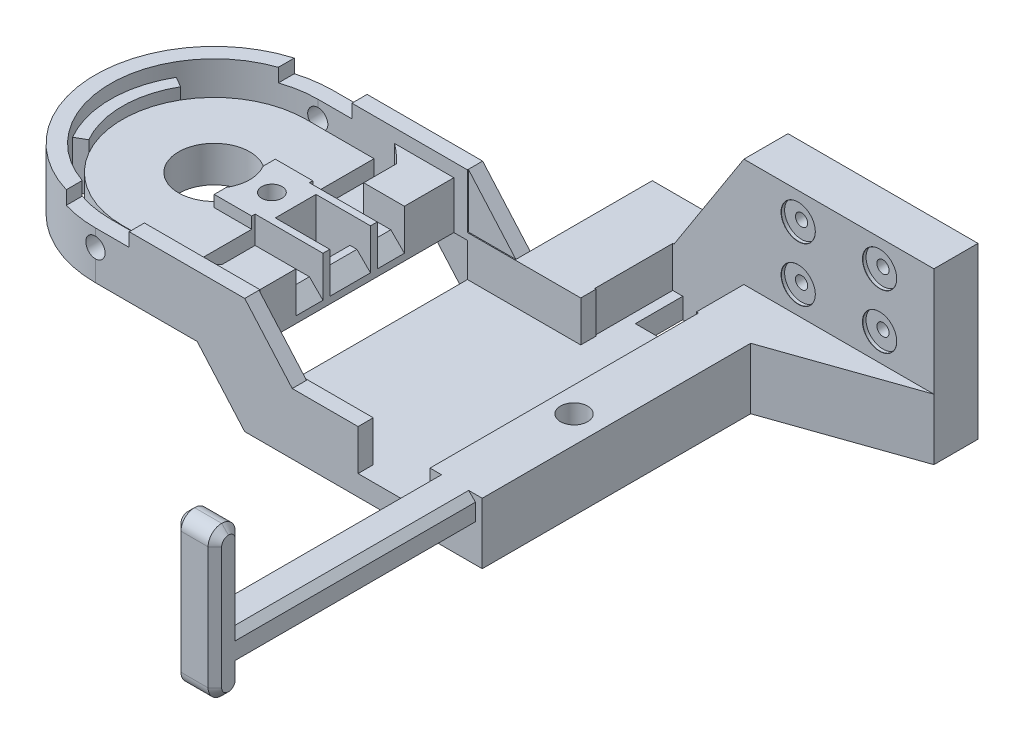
ISO-10303-21;
HEADER;
FILE_DESCRIPTION(('STEP AP214'),'2;1');
FILE_NAME('part.step','',(''),(''),'','','');
FILE_SCHEMA(('AUTOMOTIVE_DESIGN { 1 0 10303 214 1 1 1 1 }'));
ENDSEC;
DATA;
#1=APPLICATION_CONTEXT('core data for automotive mechanical design processes');
#2=APPLICATION_PROTOCOL_DEFINITION('international standard','automotive_design',2000,#1);
#3=PRODUCT_CONTEXT('',#1,'mechanical');
#4=PRODUCT('Part','Part','',(#3));
#5=PRODUCT_RELATED_PRODUCT_CATEGORY('part','',(#4));
#6=PRODUCT_DEFINITION_FORMATION('','',#4);
#7=PRODUCT_DEFINITION_CONTEXT('part definition',#1,'design');
#8=PRODUCT_DEFINITION('design','',#6,#7);
#9=PRODUCT_DEFINITION_SHAPE('','',#8);
#10=(LENGTH_UNIT() NAMED_UNIT(*) SI_UNIT(.MILLI.,.METRE.));
#11=(NAMED_UNIT(*) PLANE_ANGLE_UNIT() SI_UNIT($,.RADIAN.));
#12=(NAMED_UNIT(*) SI_UNIT($,.STERADIAN.) SOLID_ANGLE_UNIT());
#13=UNCERTAINTY_MEASURE_WITH_UNIT(LENGTH_MEASURE(1.E-05),#10,'distance_accuracy_value','');
#14=(GEOMETRIC_REPRESENTATION_CONTEXT(3) GLOBAL_UNCERTAINTY_ASSIGNED_CONTEXT((#13)) GLOBAL_UNIT_ASSIGNED_CONTEXT((#10,
#11,#12)) REPRESENTATION_CONTEXT('',''));
#15=CARTESIAN_POINT('',(0.,0.,0.));
#16=DIRECTION('',(0.,0.,1.));
#17=DIRECTION('',(1.,0.,0.));
#18=AXIS2_PLACEMENT_3D('',#15,#16,#17);
#19=CARTESIAN_POINT('',(47.025,37.8617393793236,-29.0294293));
#20=DIRECTION('',(-1.,0.,0.));
#21=DIRECTION('',(0.,0.,1.));
#22=AXIS2_PLACEMENT_3D('',#19,#20,#21);
#23=PLANE('',#22);
#24=DIRECTION('',(0.,0.,1.));
#25=VECTOR('',#24,1.);
#26=CARTESIAN_POINT('',(47.025,9.,-29.0294293));
#27=LINE('',#26,#25);
#28=CARTESIAN_POINT('',(47.025,9.,-29.0294293));
#29=VERTEX_POINT('',#28);
#30=CARTESIAN_POINT('',(47.025,9.,-22.0294293));
#31=VERTEX_POINT('',#30);
#32=EDGE_CURVE('E955',#29,#31,#27,.T.);
#33=ORIENTED_EDGE('',*,*,#32,.F.);
#34=DIRECTION('',(0.,-1.,0.));
#35=VECTOR('',#34,1.);
#36=CARTESIAN_POINT('',(47.025,25.,-29.0294293));
#37=LINE('',#36,#35);
#38=CARTESIAN_POINT('',(47.025,0.,-29.0294293));
#39=VERTEX_POINT('',#38);
#40=EDGE_CURVE('E815',#29,#39,#37,.T.);
#41=ORIENTED_EDGE('',*,*,#40,.T.);
#42=DIRECTION('',(0.,0.,-1.));
#43=VECTOR('',#42,1.);
#44=CARTESIAN_POINT('',(47.025,0.,-29.0294293));
#45=LINE('',#44,#43);
#46=CARTESIAN_POINT('',(47.025,0.,-22.0294293));
#47=VERTEX_POINT('',#46);
#48=EDGE_CURVE('E908',#47,#39,#45,.T.);
#49=ORIENTED_EDGE('',*,*,#48,.F.);
#50=DIRECTION('',(0.,-1.,0.));
#51=VECTOR('',#50,1.);
#52=CARTESIAN_POINT('',(47.025,37.8617393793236,-22.0294293));
#53=LINE('',#52,#51);
#54=CARTESIAN_POINT('',(47.025,3.,-22.0294293));
#55=VERTEX_POINT('',#54);
#56=EDGE_CURVE('E959',#55,#47,#53,.T.);
#57=ORIENTED_EDGE('',*,*,#56,.F.);
#58=EDGE_CURVE('E961',#31,#55,#53,.T.);
#59=ORIENTED_EDGE('',*,*,#58,.F.);
#60=EDGE_LOOP('',(#33,#41,#49,#57,#59));
#61=FACE_BOUND('',#60,.T.);
#62=ADVANCED_FACE('F43',(#61),#23,.T.);
#63=CARTESIAN_POINT('',(6.5,11.2139745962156,0.));
#64=DIRECTION('',(0.,1.,0.));
#65=DIRECTION('',(0.,0.,1.));
#66=AXIS2_PLACEMENT_3D('',#63,#64,#65);
#67=CONICAL_SURFACE('',#66,0.,1.04719755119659);
#68=CARTESIAN_POINT('',(6.5,12.08,0.));
#69=DIRECTION('',(0.,1.,0.));
#70=DIRECTION('',(0.,0.,1.));
#71=AXIS2_PLACEMENT_3D('',#68,#69,#70);
#72=CIRCLE('',#71,1.5);
#73=CARTESIAN_POINT('',(6.5,12.08,1.5));
#74=VERTEX_POINT('',#73);
#75=EDGE_CURVE('E1812',#74,#74,#72,.T.);
#76=ORIENTED_EDGE('',*,*,#75,.T.);
#77=EDGE_LOOP('',(#76));
#78=FACE_BOUND('',#77,.T.);
#79=CARTESIAN_POINT('',(6.5,11.2139745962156,0.));
#80=VERTEX_POINT('',#79);
#81=VERTEX_LOOP('',#80);
#82=FACE_BOUND('',#81,.T.);
#83=ADVANCED_FACE('F1699',(#78,#82),#67,.F.);
#84=CARTESIAN_POINT('',(51.025,4.,0.));
#85=DIRECTION('',(0.,1.,0.));
#86=DIRECTION('',(0.,0.,1.));
#87=AXIS2_PLACEMENT_3D('',#84,#85,#86);
#88=PLANE('',#87);
#89=CARTESIAN_POINT('',(51.025,4.,0.));
#90=DIRECTION('',(0.,1.,0.));
#91=DIRECTION('',(0.,0.,1.));
#92=AXIS2_PLACEMENT_3D('',#89,#90,#91);
#93=CIRCLE('',#92,2.);
#94=CARTESIAN_POINT('',(51.025,4.,2.));
#95=VERTEX_POINT('',#94);
#96=EDGE_CURVE('E1348',#95,#95,#93,.T.);
#97=ORIENTED_EDGE('',*,*,#96,.T.);
#98=EDGE_LOOP('',(#97));
#99=FACE_BOUND('',#98,.T.);
#100=ADVANCED_FACE('F1707',(#99),#88,.T.);
#101=CARTESIAN_POINT('',(48.025,21.,53.9294293));
#102=DIRECTION('',(1.,0.,0.));
#103=DIRECTION('',(0.,0.,-1.));
#104=AXIS2_PLACEMENT_3D('',#101,#102,#103);
#105=CYLINDRICAL_SURFACE('',#104,2.);
#106=DIRECTION('',(1.,0.,0.));
#107=VECTOR('',#106,1.);
#108=CARTESIAN_POINT('',(48.025,21.,51.9294293));
#109=LINE('',#108,#107);
#110=CARTESIAN_POINT('',(49.025,21.,51.9294293));
#111=VERTEX_POINT('',#110);
#112=CARTESIAN_POINT('',(53.025,21.,51.9294293));
#113=VERTEX_POINT('',#112);
#114=EDGE_CURVE('E1446',#111,#113,#109,.T.);
#115=ORIENTED_EDGE('',*,*,#114,.F.);
#116=CARTESIAN_POINT('',(49.025,21.,53.9294293));
#117=DIRECTION('',(-1.,0.,0.));
#118=DIRECTION('',(0.,0.,1.));
#119=AXIS2_PLACEMENT_3D('',#116,#117,#118);
#120=CIRCLE('',#119,2.);
#121=CARTESIAN_POINT('',(49.025,23.,53.9294293));
#122=VERTEX_POINT('',#121);
#123=EDGE_CURVE('E1485',#111,#122,#120,.F.);
#124=ORIENTED_EDGE('',*,*,#123,.T.);
#125=DIRECTION('',(1.,0.,0.));
#126=VECTOR('',#125,1.);
#127=CARTESIAN_POINT('',(48.025,23.,53.9294293));
#128=LINE('',#127,#126);
#129=CARTESIAN_POINT('',(53.025,23.,53.9294293));
#130=VERTEX_POINT('',#129);
#131=EDGE_CURVE('E1452',#130,#122,#128,.F.);
#132=ORIENTED_EDGE('',*,*,#131,.F.);
#133=CARTESIAN_POINT('',(53.025,21.,53.9294293));
#134=DIRECTION('',(-1.,0.,0.));
#135=DIRECTION('',(0.,0.,1.));
#136=AXIS2_PLACEMENT_3D('',#133,#134,#135);
#137=CIRCLE('',#136,2.);
#138=EDGE_CURVE('E1483',#130,#113,#137,.T.);
#139=ORIENTED_EDGE('',*,*,#138,.T.);
#140=EDGE_LOOP('',(#115,#124,#132,#139));
#141=FACE_BOUND('',#140,.T.);
#142=ADVANCED_FACE('F1629',(#141),#105,.T.);
#143=CARTESIAN_POINT('',(48.025,21.,53.9294293));
#144=DIRECTION('',(1.,0.,0.));
#145=DIRECTION('',(0.,0.,-1.));
#146=AXIS2_PLACEMENT_3D('',#143,#144,#145);
#147=CYLINDRICAL_SURFACE('',#146,2.);
#148=ORIENTED_EDGE('',*,*,#131,.T.);
#149=CARTESIAN_POINT('',(49.025,21.,53.9294293));
#150=DIRECTION('',(-1.,0.,0.));
#151=DIRECTION('',(0.,0.,1.));
#152=AXIS2_PLACEMENT_3D('',#149,#150,#151);
#153=CIRCLE('',#152,2.);
#154=CARTESIAN_POINT('',(49.025,21.,55.9294293));
#155=VERTEX_POINT('',#154);
#156=EDGE_CURVE('E1489',#122,#155,#153,.F.);
#157=ORIENTED_EDGE('',*,*,#156,.T.);
#158=DIRECTION('',(1.,0.,0.));
#159=VECTOR('',#158,1.);
#160=CARTESIAN_POINT('',(48.025,21.,55.9294293));
#161=LINE('',#160,#159);
#162=CARTESIAN_POINT('',(53.025,21.,55.9294293));
#163=VERTEX_POINT('',#162);
#164=EDGE_CURVE('E1440',#163,#155,#161,.F.);
#165=ORIENTED_EDGE('',*,*,#164,.F.);
#166=CARTESIAN_POINT('',(53.025,21.,53.9294293));
#167=DIRECTION('',(-1.,0.,0.));
#168=DIRECTION('',(0.,0.,1.));
#169=AXIS2_PLACEMENT_3D('',#166,#167,#168);
#170=CIRCLE('',#169,2.);
#171=EDGE_CURVE('E1487',#163,#130,#170,.T.);
#172=ORIENTED_EDGE('',*,*,#171,.T.);
#173=EDGE_LOOP('',(#148,#157,#165,#172));
#174=FACE_BOUND('',#173,.T.);
#175=ADVANCED_FACE('F1642',(#174),#147,.T.);
#176=CARTESIAN_POINT('',(48.025,23.,55.9294293));
#177=DIRECTION('',(0.,0.,1.));
#178=DIRECTION('',(1.,0.,0.));
#179=AXIS2_PLACEMENT_3D('',#176,#177,#178);
#180=PLANE('',#179);
#181=ORIENTED_EDGE('',*,*,#164,.T.);
#182=DIRECTION('',(0.,-1.,0.));
#183=VECTOR('',#182,1.);
#184=CARTESIAN_POINT('',(49.025,23.,55.9294293));
#185=LINE('',#184,#183);
#186=CARTESIAN_POINT('',(49.025,3.,55.9294293));
#187=VERTEX_POINT('',#186);
#188=EDGE_CURVE('E1493',#155,#187,#185,.T.);
#189=ORIENTED_EDGE('',*,*,#188,.T.);
#190=DIRECTION('',(1.,0.,0.));
#191=VECTOR('',#190,1.);
#192=CARTESIAN_POINT('',(48.025,3.,55.9294293));
#193=LINE('',#192,#191);
#194=CARTESIAN_POINT('',(53.025,3.,55.9294293));
#195=VERTEX_POINT('',#194);
#196=EDGE_CURVE('E1443',#187,#195,#193,.T.);
#197=ORIENTED_EDGE('',*,*,#196,.T.);
#198=DIRECTION('',(0.,1.,0.));
#199=VECTOR('',#198,1.);
#200=CARTESIAN_POINT('',(53.025,21.,55.9294293));
#201=LINE('',#200,#199);
#202=EDGE_CURVE('E1491',#195,#163,#201,.T.);
#203=ORIENTED_EDGE('',*,*,#202,.T.);
#204=EDGE_LOOP('',(#181,#189,#197,#203));
#205=FACE_BOUND('',#204,.T.);
#206=ADVANCED_FACE('F1646',(#205),#180,.T.);
#207=CARTESIAN_POINT('',(48.025,3.,53.9294293));
#208=DIRECTION('',(1.,0.,0.));
#209=DIRECTION('',(0.,0.,-1.));
#210=AXIS2_PLACEMENT_3D('',#207,#208,#209);
#211=CYLINDRICAL_SURFACE('',#210,2.);
#212=ORIENTED_EDGE('',*,*,#196,.F.);
#213=CARTESIAN_POINT('',(49.025,3.,53.9294293));
#214=DIRECTION('',(-1.,0.,0.));
#215=DIRECTION('',(0.,0.,1.));
#216=AXIS2_PLACEMENT_3D('',#213,#214,#215);
#217=CIRCLE('',#216,2.);
#218=CARTESIAN_POINT('',(49.025,0.999999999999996,53.9294293));
#219=VERTEX_POINT('',#218);
#220=EDGE_CURVE('E1497',#187,#219,#217,.F.);
#221=ORIENTED_EDGE('',*,*,#220,.T.);
#222=DIRECTION('',(1.,0.,0.));
#223=VECTOR('',#222,1.);
#224=CARTESIAN_POINT('',(48.025,0.999999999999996,53.9294293));
#225=LINE('',#224,#223);
#226=CARTESIAN_POINT('',(53.025,0.999999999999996,53.9294293));
#227=VERTEX_POINT('',#226);
#228=EDGE_CURVE('E974',#227,#219,#225,.F.);
#229=ORIENTED_EDGE('',*,*,#228,.F.);
#230=CARTESIAN_POINT('',(53.025,3.,53.9294293));
#231=DIRECTION('',(-1.,0.,0.));
#232=DIRECTION('',(0.,0.,1.));
#233=AXIS2_PLACEMENT_3D('',#230,#231,#232);
#234=CIRCLE('',#233,2.);
#235=EDGE_CURVE('E1495',#227,#195,#234,.T.);
#236=ORIENTED_EDGE('',*,*,#235,.T.);
#237=EDGE_LOOP('',(#212,#221,#229,#236));
#238=FACE_BOUND('',#237,.T.);
#239=ADVANCED_FACE('F1660',(#238),#211,.T.);
#240=CARTESIAN_POINT('',(48.025,3.,53.9294293));
#241=DIRECTION('',(1.,0.,0.));
#242=DIRECTION('',(0.,0.,-1.));
#243=AXIS2_PLACEMENT_3D('',#240,#241,#242);
#244=CYLINDRICAL_SURFACE('',#243,2.);
#245=ORIENTED_EDGE('',*,*,#228,.T.);
#246=CARTESIAN_POINT('',(49.025,3.,53.9294293));
#247=DIRECTION('',(-1.,0.,0.));
#248=DIRECTION('',(0.,0.,1.));
#249=AXIS2_PLACEMENT_3D('',#246,#247,#248);
#250=CIRCLE('',#249,2.);
#251=CARTESIAN_POINT('',(49.025,3.,51.9294293));
#252=VERTEX_POINT('',#251);
#253=EDGE_CURVE('E1501',#219,#252,#250,.F.);
#254=ORIENTED_EDGE('',*,*,#253,.T.);
#255=DIRECTION('',(1.,0.,0.));
#256=VECTOR('',#255,1.);
#257=CARTESIAN_POINT('',(48.025,3.,51.9294293));
#258=LINE('',#257,#256);
#259=CARTESIAN_POINT('',(53.025,3.,51.9294293));
#260=VERTEX_POINT('',#259);
#261=EDGE_CURVE('E1437',#260,#252,#258,.F.);
#262=ORIENTED_EDGE('',*,*,#261,.F.);
#263=CARTESIAN_POINT('',(53.025,3.,53.9294293));
#264=DIRECTION('',(-1.,0.,0.));
#265=DIRECTION('',(0.,0.,1.));
#266=AXIS2_PLACEMENT_3D('',#263,#264,#265);
#267=CIRCLE('',#266,2.);
#268=EDGE_CURVE('E1499',#260,#227,#267,.T.);
#269=ORIENTED_EDGE('',*,*,#268,.T.);
#270=EDGE_LOOP('',(#245,#254,#262,#269));
#271=FACE_BOUND('',#270,.T.);
#272=ADVANCED_FACE('F1664',(#271),#244,.T.);
#273=CARTESIAN_POINT('',(-2.,-29.0544336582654,4.5));
#274=DIRECTION('',(0.,0.,1.));
#275=DIRECTION('',(1.,0.,0.));
#276=AXIS2_PLACEMENT_3D('',#273,#274,#275);
#277=PLANE('',#276);
#278=DIRECTION('',(0.,1.,0.));
#279=VECTOR('',#278,1.);
#280=CARTESIAN_POINT('',(8.025,-29.0544336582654,4.5));
#281=LINE('',#280,#279);
#282=CARTESIAN_POINT('',(8.025,13.31,4.5));
#283=VERTEX_POINT('',#282);
#284=CARTESIAN_POINT('',(8.025,15.,4.5));
#285=VERTEX_POINT('',#284);
#286=EDGE_CURVE('E1945',#283,#285,#281,.T.);
#287=ORIENTED_EDGE('',*,*,#286,.T.);
#288=DIRECTION('',(1.,0.,0.));
#289=VECTOR('',#288,1.);
#290=CARTESIAN_POINT('',(-2.,15.,4.5));
#291=LINE('',#290,#289);
#292=CARTESIAN_POINT('',(2.5,15.,4.5));
#293=VERTEX_POINT('',#292);
#294=EDGE_CURVE('E1953',#293,#285,#291,.T.);
#295=ORIENTED_EDGE('',*,*,#294,.F.);
#296=DIRECTION('',(0.,1.,0.));
#297=VECTOR('',#296,1.);
#298=CARTESIAN_POINT('',(2.5,-29.0544336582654,4.5));
#299=LINE('',#298,#297);
#300=CARTESIAN_POINT('',(2.5,13.31,4.5));
#301=VERTEX_POINT('',#300);
#302=EDGE_CURVE('E1947',#301,#293,#299,.T.);
#303=ORIENTED_EDGE('',*,*,#302,.F.);
#304=DIRECTION('',(-1.,0.,0.));
#305=VECTOR('',#304,1.);
#306=CARTESIAN_POINT('',(-2.,13.31,4.5));
#307=LINE('',#306,#305);
#308=EDGE_CURVE('E1967',#283,#301,#307,.T.);
#309=ORIENTED_EDGE('',*,*,#308,.F.);
#310=EDGE_LOOP('',(#287,#295,#303,#309));
#311=FACE_BOUND('',#310,.T.);
#312=ADVANCED_FACE('F2305',(#311),#277,.T.);
#313=CARTESIAN_POINT('',(-2.,-29.0544336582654,-4.5));
#314=DIRECTION('',(0.,0.,1.));
#315=DIRECTION('',(1.,0.,0.));
#316=AXIS2_PLACEMENT_3D('',#313,#314,#315);
#317=PLANE('',#316);
#318=DIRECTION('',(-1.,0.,0.));
#319=VECTOR('',#318,1.);
#320=CARTESIAN_POINT('',(-2.,13.31,-4.5));
#321=LINE('',#320,#319);
#322=CARTESIAN_POINT('',(8.025,13.31,-4.5));
#323=VERTEX_POINT('',#322);
#324=CARTESIAN_POINT('',(2.5,13.31,-4.5));
#325=VERTEX_POINT('',#324);
#326=EDGE_CURVE('E1936',#323,#325,#321,.T.);
#327=ORIENTED_EDGE('',*,*,#326,.T.);
#328=DIRECTION('',(0.,1.,0.));
#329=VECTOR('',#328,1.);
#330=CARTESIAN_POINT('',(2.5,-29.0544336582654,-4.5));
#331=LINE('',#330,#329);
#332=CARTESIAN_POINT('',(2.5,15.,-4.5));
#333=VERTEX_POINT('',#332);
#334=EDGE_CURVE('E1940',#325,#333,#331,.T.);
#335=ORIENTED_EDGE('',*,*,#334,.T.);
#336=DIRECTION('',(1.,0.,0.));
#337=VECTOR('',#336,1.);
#338=CARTESIAN_POINT('',(-2.,15.,-4.5));
#339=LINE('',#338,#337);
#340=CARTESIAN_POINT('',(8.025,15.,-4.5));
#341=VERTEX_POINT('',#340);
#342=EDGE_CURVE('E1956',#333,#341,#339,.T.);
#343=ORIENTED_EDGE('',*,*,#342,.T.);
#344=DIRECTION('',(0.,1.,0.));
#345=VECTOR('',#344,1.);
#346=CARTESIAN_POINT('',(8.025,-29.0544336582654,-4.5));
#347=LINE('',#346,#345);
#348=EDGE_CURVE('E1942',#323,#341,#347,.T.);
#349=ORIENTED_EDGE('',*,*,#348,.F.);
#350=EDGE_LOOP('',(#327,#335,#343,#349));
#351=FACE_BOUND('',#350,.T.);
#352=ADVANCED_FACE('F2420',(#351),#317,.F.);
#353=CARTESIAN_POINT('',(6.5,15.,0.));
#354=DIRECTION('',(0.,1.,0.));
#355=DIRECTION('',(0.,0.,1.));
#356=AXIS2_PLACEMENT_3D('',#353,#354,#355);
#357=CYLINDRICAL_SURFACE('',#356,1.5);
#358=CARTESIAN_POINT('',(6.5,15.,0.));
#359=DIRECTION('',(0.,1.,0.));
#360=DIRECTION('',(0.,0.,1.));
#361=AXIS2_PLACEMENT_3D('',#358,#359,#360);
#362=CIRCLE('',#361,1.5);
#363=CARTESIAN_POINT('',(6.5,15.,1.5));
#364=VERTEX_POINT('',#363);
#365=EDGE_CURVE('E1822',#364,#364,#362,.T.);
#366=ORIENTED_EDGE('',*,*,#365,.T.);
#367=EDGE_LOOP('',(#366));
#368=FACE_BOUND('',#367,.T.);
#369=ORIENTED_EDGE('',*,*,#75,.F.);
#370=EDGE_LOOP('',(#369));
#371=FACE_BOUND('',#370,.T.);
#372=ADVANCED_FACE('F2424',(#368,#371),#357,.F.);
#373=CARTESIAN_POINT('',(8.025,-2.81340011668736,0.));
#374=DIRECTION('',(1.,0.,0.));
#375=DIRECTION('',(0.,0.,-1.));
#376=AXIS2_PLACEMENT_3D('',#373,#374,#375);
#377=PLANE('',#376);
#378=ORIENTED_EDGE('',*,*,#348,.T.);
#379=DIRECTION('',(0.,0.,-1.));
#380=VECTOR('',#379,1.);
#381=CARTESIAN_POINT('',(8.025,15.,0.));
#382=LINE('',#381,#380);
#383=CARTESIAN_POINT('',(8.025,15.,-4.));
#384=VERTEX_POINT('',#383);
#385=EDGE_CURVE('E1897',#384,#341,#382,.T.);
#386=ORIENTED_EDGE('',*,*,#385,.F.);
#387=DIRECTION('',(0.,1.,0.));
#388=VECTOR('',#387,1.);
#389=CARTESIAN_POINT('',(8.025,-2.81340011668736,-4.));
#390=LINE('',#389,#388);
#391=CARTESIAN_POINT('',(8.025,11.,-4.));
#392=VERTEX_POINT('',#391);
#393=EDGE_CURVE('E1880',#392,#384,#390,.T.);
#394=ORIENTED_EDGE('',*,*,#393,.F.);
#395=DIRECTION('',(0.,0.,1.));
#396=VECTOR('',#395,1.);
#397=CARTESIAN_POINT('',(8.025,11.,0.));
#398=LINE('',#397,#396);
#399=CARTESIAN_POINT('',(8.025,11.,-13.5294293));
#400=VERTEX_POINT('',#399);
#401=EDGE_CURVE('E1871',#400,#392,#398,.T.);
#402=ORIENTED_EDGE('',*,*,#401,.F.);
#403=DIRECTION('',(0.,1.,0.));
#404=VECTOR('',#403,1.);
#405=CARTESIAN_POINT('',(8.025,-2.81340011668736,-13.5294293));
#406=LINE('',#405,#404);
#407=CARTESIAN_POINT('',(8.025,13.31,-13.5294293));
#408=VERTEX_POINT('',#407);
#409=EDGE_CURVE('E1876',#400,#408,#406,.T.);
#410=ORIENTED_EDGE('',*,*,#409,.T.);
#411=DIRECTION('',(0.,0.,1.));
#412=VECTOR('',#411,1.);
#413=CARTESIAN_POINT('',(8.025,13.31,0.));
#414=LINE('',#413,#412);
#415=EDGE_CURVE('E1985',#408,#323,#414,.T.);
#416=ORIENTED_EDGE('',*,*,#415,.T.);
#417=EDGE_LOOP('',(#378,#386,#394,#402,#410,#416));
#418=FACE_BOUND('',#417,.T.);
#419=ADVANCED_FACE('F2440',(#418),#377,.T.);
#420=CARTESIAN_POINT('',(8.025,-2.81340011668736,0.));
#421=DIRECTION('',(-1.,0.,0.));
#422=DIRECTION('',(0.,0.,1.));
#423=AXIS2_PLACEMENT_3D('',#420,#421,#422);
#424=PLANE('',#423);
#425=ORIENTED_EDGE('',*,*,#286,.F.);
#426=DIRECTION('',(0.,0.,1.));
#427=VECTOR('',#426,1.);
#428=CARTESIAN_POINT('',(8.025,13.31,0.));
#429=LINE('',#428,#427);
#430=CARTESIAN_POINT('',(8.025,13.31,13.5294293));
#431=VERTEX_POINT('',#430);
#432=EDGE_CURVE('E1970',#283,#431,#429,.T.);
#433=ORIENTED_EDGE('',*,*,#432,.T.);
#434=DIRECTION('',(0.,1.,0.));
#435=VECTOR('',#434,1.);
#436=CARTESIAN_POINT('',(8.025,-2.81340011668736,13.5294293));
#437=LINE('',#436,#435);
#438=CARTESIAN_POINT('',(8.025,11.,13.5294293));
#439=VERTEX_POINT('',#438);
#440=EDGE_CURVE('E1844',#439,#431,#437,.T.);
#441=ORIENTED_EDGE('',*,*,#440,.F.);
#442=DIRECTION('',(0.,0.,-1.));
#443=VECTOR('',#442,1.);
#444=CARTESIAN_POINT('',(8.025,11.,0.));
#445=LINE('',#444,#443);
#446=CARTESIAN_POINT('',(8.025,11.,4.));
#447=VERTEX_POINT('',#446);
#448=EDGE_CURVE('E1861',#439,#447,#445,.T.);
#449=ORIENTED_EDGE('',*,*,#448,.T.);
#450=DIRECTION('',(0.,1.,0.));
#451=VECTOR('',#450,1.);
#452=CARTESIAN_POINT('',(8.025,-2.81340011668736,4.));
#453=LINE('',#452,#451);
#454=CARTESIAN_POINT('',(8.025,15.,4.));
#455=VERTEX_POINT('',#454);
#456=EDGE_CURVE('E1842',#447,#455,#453,.T.);
#457=ORIENTED_EDGE('',*,*,#456,.T.);
#458=DIRECTION('',(0.,0.,1.));
#459=VECTOR('',#458,1.);
#460=CARTESIAN_POINT('',(8.025,15.,0.));
#461=LINE('',#460,#459);
#462=EDGE_CURVE('E1834',#455,#285,#461,.T.);
#463=ORIENTED_EDGE('',*,*,#462,.T.);
#464=EDGE_LOOP('',(#425,#433,#441,#449,#457,#463));
#465=FACE_BOUND('',#464,.T.);
#466=ADVANCED_FACE('F2416',(#465),#424,.F.);
#467=CARTESIAN_POINT('',(2.5,-29.0544336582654,0.));
#468=DIRECTION('',(-1.,0.,0.));
#469=DIRECTION('',(0.,0.,1.));
#470=AXIS2_PLACEMENT_3D('',#467,#468,#469);
#471=PLANE('',#470);
#472=ORIENTED_EDGE('',*,*,#302,.T.);
#473=DIRECTION('',(0.,0.,1.));
#474=VECTOR('',#473,1.);
#475=CARTESIAN_POINT('',(2.5,15.,0.));
#476=LINE('',#475,#474);
#477=CARTESIAN_POINT('',(2.5,15.,2.70416345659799));
#478=VERTEX_POINT('',#477);
#479=EDGE_CURVE('E1939',#478,#293,#476,.T.);
#480=ORIENTED_EDGE('',*,*,#479,.F.);
#481=DIRECTION('',(0.,1.,0.));
#482=VECTOR('',#481,1.);
#483=CARTESIAN_POINT('',(2.5,-29.0544336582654,2.70416345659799));
#484=LINE('',#483,#482);
#485=CARTESIAN_POINT('',(2.5,13.31,2.70416345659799));
#486=VERTEX_POINT('',#485);
#487=EDGE_CURVE('E1935',#486,#478,#484,.T.);
#488=ORIENTED_EDGE('',*,*,#487,.F.);
#489=DIRECTION('',(0.,0.,-1.));
#490=VECTOR('',#489,1.);
#491=CARTESIAN_POINT('',(2.5,13.31,0.));
#492=LINE('',#491,#490);
#493=EDGE_CURVE('E1964',#301,#486,#492,.T.);
#494=ORIENTED_EDGE('',*,*,#493,.F.);
#495=EDGE_LOOP('',(#472,#480,#488,#494));
#496=FACE_BOUND('',#495,.T.);
#497=ADVANCED_FACE('F2412',(#496),#471,.T.);
#498=CARTESIAN_POINT('',(-2.,13.31,0.));
#499=DIRECTION('',(0.,1.,0.));
#500=DIRECTION('',(0.,0.,1.));
#501=AXIS2_PLACEMENT_3D('',#498,#499,#500);
#502=PLANE('',#501);
#503=CARTESIAN_POINT('',(-2.,13.31,0.));
#504=DIRECTION('',(0.,1.,0.));
#505=DIRECTION('',(0.,0.,1.));
#506=AXIS2_PLACEMENT_3D('',#503,#504,#505);
#507=CIRCLE('',#506,13.5294293);
#508=CARTESIAN_POINT('',(-13.7168294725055,13.31,-6.76471464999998));
#509=VERTEX_POINT('',#508);
#510=CARTESIAN_POINT('',(-2.,13.31,-13.5294293));
#511=VERTEX_POINT('',#510);
#512=EDGE_CURVE('E1979',#509,#511,#507,.F.);
#513=ORIENTED_EDGE('',*,*,#512,.F.);
#514=CARTESIAN_POINT('',(-2.,13.31,0.));
#515=DIRECTION('',(0.,-1.,0.));
#516=DIRECTION('',(0.,0.,1.));
#517=AXIS2_PLACEMENT_3D('',#514,#515,#516);
#518=CIRCLE('',#517,13.5294293);
#519=CARTESIAN_POINT('',(-13.7168294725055,13.31,6.76471464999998));
#520=VERTEX_POINT('',#519);
#521=EDGE_CURVE('E1119',#520,#509,#518,.T.);
#522=ORIENTED_EDGE('',*,*,#521,.F.);
#523=CARTESIAN_POINT('',(-2.,13.31,0.));
#524=DIRECTION('',(0.,1.,0.));
#525=DIRECTION('',(0.,0.,1.));
#526=AXIS2_PLACEMENT_3D('',#523,#524,#525);
#527=CIRCLE('',#526,13.5294293);
#528=CARTESIAN_POINT('',(-2.,13.31,13.5294293));
#529=VERTEX_POINT('',#528);
#530=EDGE_CURVE('E1976',#529,#520,#527,.F.);
#531=ORIENTED_EDGE('',*,*,#530,.F.);
#532=DIRECTION('',(-1.,0.,0.));
#533=VECTOR('',#532,1.);
#534=CARTESIAN_POINT('',(-2.,13.31,13.5294293));
#535=LINE('',#534,#533);
#536=EDGE_CURVE('E1973',#431,#529,#535,.T.);
#537=ORIENTED_EDGE('',*,*,#536,.F.);
#538=ORIENTED_EDGE('',*,*,#432,.F.);
#539=ORIENTED_EDGE('',*,*,#308,.T.);
#540=ORIENTED_EDGE('',*,*,#493,.T.);
#541=CARTESIAN_POINT('',(-2.,13.31,0.));
#542=DIRECTION('',(0.,1.,0.));
#543=DIRECTION('',(0.,0.,1.));
#544=AXIS2_PLACEMENT_3D('',#541,#542,#543);
#545=CIRCLE('',#544,5.25);
#546=CARTESIAN_POINT('',(2.5,13.31,-2.70416345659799));
#547=VERTEX_POINT('',#546);
#548=EDGE_CURVE('E1927',#547,#486,#545,.T.);
#549=ORIENTED_EDGE('',*,*,#548,.F.);
#550=DIRECTION('',(0.,0.,-1.));
#551=VECTOR('',#550,1.);
#552=CARTESIAN_POINT('',(2.5,13.31,0.));
#553=LINE('',#552,#551);
#554=EDGE_CURVE('E1932',#547,#325,#553,.T.);
#555=ORIENTED_EDGE('',*,*,#554,.T.);
#556=ORIENTED_EDGE('',*,*,#326,.F.);
#557=ORIENTED_EDGE('',*,*,#415,.F.);
#558=DIRECTION('',(1.,0.,0.));
#559=VECTOR('',#558,1.);
#560=CARTESIAN_POINT('',(-2.,13.31,-13.5294293));
#561=LINE('',#560,#559);
#562=EDGE_CURVE('E1982',#511,#408,#561,.T.);
#563=ORIENTED_EDGE('',*,*,#562,.F.);
#564=EDGE_LOOP('',(#513,#522,#531,#537,#538,#539,#540,#549,#555,#556,#557,#563));
#565=FACE_BOUND('',#564,.T.);
#566=ADVANCED_FACE('F2408',(#565),#502,.T.);
#567=CARTESIAN_POINT('',(2.5,-29.0544336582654,0.));
#568=DIRECTION('',(-1.,0.,0.));
#569=DIRECTION('',(0.,0.,1.));
#570=AXIS2_PLACEMENT_3D('',#567,#568,#569);
#571=PLANE('',#570);
#572=DIRECTION('',(0.,1.,0.));
#573=VECTOR('',#572,1.);
#574=CARTESIAN_POINT('',(2.5,-29.0544336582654,-2.70416345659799));
#575=LINE('',#574,#573);
#576=CARTESIAN_POINT('',(2.5,15.,-2.70416345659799));
#577=VERTEX_POINT('',#576);
#578=EDGE_CURVE('E1937',#547,#577,#575,.T.);
#579=ORIENTED_EDGE('',*,*,#578,.T.);
#580=DIRECTION('',(0.,0.,1.));
#581=VECTOR('',#580,1.);
#582=CARTESIAN_POINT('',(2.5,15.,0.));
#583=LINE('',#582,#581);
#584=EDGE_CURVE('E1958',#333,#577,#583,.T.);
#585=ORIENTED_EDGE('',*,*,#584,.F.);
#586=ORIENTED_EDGE('',*,*,#334,.F.);
#587=ORIENTED_EDGE('',*,*,#554,.F.);
#588=EDGE_LOOP('',(#579,#585,#586,#587));
#589=FACE_BOUND('',#588,.T.);
#590=ADVANCED_FACE('F2411',(#589),#571,.T.);
#591=CARTESIAN_POINT('',(-2.,11.,0.));
#592=DIRECTION('',(0.,1.,0.));
#593=DIRECTION('',(0.,0.,1.));
#594=AXIS2_PLACEMENT_3D('',#591,#592,#593);
#595=PLANE('',#594);
#596=DIRECTION('',(1.,0.,0.));
#597=VECTOR('',#596,1.);
#598=CARTESIAN_POINT('',(18.025,11.,-3.));
#599=LINE('',#598,#597);
#600=CARTESIAN_POINT('',(15.,11.,-3.));
#601=VERTEX_POINT('',#600);
#602=CARTESIAN_POINT('',(16.025,11.,-3.));
#603=VERTEX_POINT('',#602);
#604=EDGE_CURVE('E1923',#601,#603,#599,.T.);
#605=ORIENTED_EDGE('',*,*,#604,.F.);
#606=DIRECTION('',(0.,0.,1.));
#607=VECTOR('',#606,1.);
#608=CARTESIAN_POINT('',(15.,11.,3.));
#609=LINE('',#608,#607);
#610=CARTESIAN_POINT('',(15.,11.,3.));
#611=VERTEX_POINT('',#610);
#612=EDGE_CURVE('E1426',#601,#611,#609,.T.);
#613=ORIENTED_EDGE('',*,*,#612,.T.);
#614=DIRECTION('',(-1.,0.,0.));
#615=VECTOR('',#614,1.);
#616=CARTESIAN_POINT('',(18.025,11.,3.));
#617=LINE('',#616,#615);
#618=CARTESIAN_POINT('',(16.025,11.,3.));
#619=VERTEX_POINT('',#618);
#620=EDGE_CURVE('E1920',#619,#611,#617,.T.);
#621=ORIENTED_EDGE('',*,*,#620,.F.);
#622=DIRECTION('',(0.,0.,-1.));
#623=VECTOR('',#622,1.);
#624=CARTESIAN_POINT('',(16.025,11.,0.));
#625=LINE('',#624,#623);
#626=EDGE_CURVE('E1398',#619,#603,#625,.T.);
#627=ORIENTED_EDGE('',*,*,#626,.T.);
#628=EDGE_LOOP('',(#605,#613,#621,#627));
#629=FACE_BOUND('',#628,.T.);
#630=ADVANCED_FACE('F2301',(#629),#595,.T.);
#631=CARTESIAN_POINT('',(14.,10.,3.));
#632=DIRECTION('',(-0.707106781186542,0.707106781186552,0.));
#633=DIRECTION('',(0.,0.,1.));
#634=AXIS2_PLACEMENT_3D('',#631,#632,#633);
#635=PLANE('',#634);
#636=DIRECTION('',(-0.707106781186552,-0.707106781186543,0.));
#637=VECTOR('',#636,1.);
#638=CARTESIAN_POINT('',(13.,9.00000000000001,3.));
#639=LINE('',#638,#637);
#640=CARTESIAN_POINT('',(14.,10.,3.));
#641=VERTEX_POINT('',#640);
#642=EDGE_CURVE('E1435',#611,#641,#639,.T.);
#643=ORIENTED_EDGE('',*,*,#642,.F.);
#644=ORIENTED_EDGE('',*,*,#612,.F.);
#645=DIRECTION('',(0.707106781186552,0.707106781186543,0.));
#646=VECTOR('',#645,1.);
#647=CARTESIAN_POINT('',(13.,9.00000000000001,-3.));
#648=LINE('',#647,#646);
#649=CARTESIAN_POINT('',(14.,10.,-3.));
#650=VERTEX_POINT('',#649);
#651=EDGE_CURVE('E1433',#650,#601,#648,.T.);
#652=ORIENTED_EDGE('',*,*,#651,.F.);
#653=DIRECTION('',(0.,0.,-1.));
#654=VECTOR('',#653,1.);
#655=CARTESIAN_POINT('',(14.,10.,-3.));
#656=LINE('',#655,#654);
#657=EDGE_CURVE('E1421',#641,#650,#656,.T.);
#658=ORIENTED_EDGE('',*,*,#657,.F.);
#659=EDGE_LOOP('',(#643,#644,#652,#658));
#660=FACE_BOUND('',#659,.T.);
#661=ADVANCED_FACE('F2294',(#660),#635,.T.);
#662=CARTESIAN_POINT('',(14.,8.,3.));
#663=DIRECTION('',(1.,0.,0.));
#664=DIRECTION('',(0.,0.,-1.));
#665=AXIS2_PLACEMENT_3D('',#662,#663,#664);
#666=PLANE('',#665);
#667=DIRECTION('',(0.,1.,0.));
#668=VECTOR('',#667,1.);
#669=CARTESIAN_POINT('',(14.,8.,-3.));
#670=LINE('',#669,#668);
#671=CARTESIAN_POINT('',(14.,9.,-3.));
#672=VERTEX_POINT('',#671);
#673=EDGE_CURVE('E1250',#672,#650,#670,.T.);
#674=ORIENTED_EDGE('',*,*,#673,.F.);
#675=DIRECTION('',(0.,0.,1.));
#676=VECTOR('',#675,1.);
#677=CARTESIAN_POINT('',(14.,9.,3.));
#678=LINE('',#677,#676);
#679=CARTESIAN_POINT('',(14.,9.,3.));
#680=VERTEX_POINT('',#679);
#681=EDGE_CURVE('E1424',#672,#680,#678,.T.);
#682=ORIENTED_EDGE('',*,*,#681,.T.);
#683=DIRECTION('',(0.,1.,0.));
#684=VECTOR('',#683,1.);
#685=CARTESIAN_POINT('',(14.,8.,3.));
#686=LINE('',#685,#684);
#687=EDGE_CURVE('E1247',#680,#641,#686,.T.);
#688=ORIENTED_EDGE('',*,*,#687,.T.);
#689=ORIENTED_EDGE('',*,*,#657,.T.);
#690=EDGE_LOOP('',(#674,#682,#688,#689));
#691=FACE_BOUND('',#690,.T.);
#692=ADVANCED_FACE('F2300',(#691),#666,.F.);
#693=CARTESIAN_POINT('',(-2.,30.701963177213,0.));
#694=DIRECTION('',(0.,-1.,0.));
#695=DIRECTION('',(0.,0.,-1.));
#696=AXIS2_PLACEMENT_3D('',#693,#694,#695);
#697=CYLINDRICAL_SURFACE('',#696,13.5294293);
#698=CARTESIAN_POINT('',(-2.,15.,0.));
#699=DIRECTION('',(0.,1.,0.));
#700=DIRECTION('',(0.,0.,1.));
#701=AXIS2_PLACEMENT_3D('',#698,#699,#700);
#702=CIRCLE('',#701,13.5294293);
#703=CARTESIAN_POINT('',(-13.7168294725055,15.,6.76471464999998));
#704=VERTEX_POINT('',#703);
#705=CARTESIAN_POINT('',(-13.7168294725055,15.,-6.76471464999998));
#706=VERTEX_POINT('',#705);
#707=EDGE_CURVE('E1997',#704,#706,#702,.F.);
#708=ORIENTED_EDGE('',*,*,#707,.F.);
#709=DIRECTION('',(0.,-1.,0.));
#710=VECTOR('',#709,1.);
#711=CARTESIAN_POINT('',(-13.7168294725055,30.701963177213,6.76471464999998));
#712=LINE('',#711,#710);
#713=EDGE_CURVE('E1118',#704,#520,#712,.T.);
#714=ORIENTED_EDGE('',*,*,#713,.T.);
#715=ORIENTED_EDGE('',*,*,#521,.T.);
#716=DIRECTION('',(0.,-1.,0.));
#717=VECTOR('',#716,1.);
#718=CARTESIAN_POINT('',(-13.7168294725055,30.701963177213,-6.76471464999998));
#719=LINE('',#718,#717);
#720=EDGE_CURVE('E1991',#706,#509,#719,.T.);
#721=ORIENTED_EDGE('',*,*,#720,.F.);
#722=EDGE_LOOP('',(#708,#714,#715,#721));
#723=FACE_BOUND('',#722,.T.);
#724=ADVANCED_FACE('F2019',(#723),#697,.F.);
#725=CARTESIAN_POINT('',(54.025,0.,52.9294293));
#726=DIRECTION('',(0.70710678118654,0.,-0.707106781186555));
#727=DIRECTION('',(0.,-1.,0.));
#728=AXIS2_PLACEMENT_3D('',#725,#726,#727);
#729=PLANE('',#728);
#730=DIRECTION('',(-0.577350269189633,-0.577350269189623,-0.577350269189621));
#731=VECTOR('',#730,1.);
#732=CARTESIAN_POINT('',(52.1916666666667,3.66666666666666,51.0960959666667));
#733=LINE('',#732,#731);
#734=CARTESIAN_POINT('',(53.025,4.5,51.9294293));
#735=VERTEX_POINT('',#734);
#736=CARTESIAN_POINT('',(54.025,5.49999999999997,52.9294293));
#737=VERTEX_POINT('',#736);
#738=EDGE_CURVE('E48',#735,#737,#733,.F.);
#739=ORIENTED_EDGE('',*,*,#738,.T.);
#740=DIRECTION('',(0.,1.,0.));
#741=VECTOR('',#740,1.);
#742=CARTESIAN_POINT('',(54.025,4.5,52.9294293));
#743=LINE('',#742,#741);
#744=CARTESIAN_POINT('',(54.025,3.,52.9294293));
#745=VERTEX_POINT('',#744);
#746=EDGE_CURVE('E1513',#745,#737,#743,.T.);
#747=ORIENTED_EDGE('',*,*,#746,.F.);
#748=DIRECTION('',(0.707106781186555,0.,0.70710678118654));
#749=VECTOR('',#748,1.);
#750=CARTESIAN_POINT('',(53.025,3.,51.9294293));
#751=LINE('',#750,#749);
#752=EDGE_CURVE('E1575',#260,#745,#751,.T.);
#753=ORIENTED_EDGE('',*,*,#752,.F.);
#754=DIRECTION('',(0.,-1.,0.));
#755=VECTOR('',#754,1.);
#756=CARTESIAN_POINT('',(53.025,3.,51.9294293));
#757=LINE('',#756,#755);
#758=EDGE_CURVE('E1503',#735,#260,#757,.T.);
#759=ORIENTED_EDGE('',*,*,#758,.F.);
#760=EDGE_LOOP('',(#739,#747,#753,#759));
#761=FACE_BOUND('',#760,.T.);
#762=ADVANCED_FACE('F1586',(#761),#729,.T.);
#763=CARTESIAN_POINT('',(54.025,3.,53.9294293));
#764=DIRECTION('',(-1.,0.,0.));
#765=DIRECTION('',(0.,0.,1.));
#766=AXIS2_PLACEMENT_3D('',#763,#764,#765);
#767=CONICAL_SURFACE('',#766,1.00000000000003,0.785398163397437);
#768=ORIENTED_EDGE('',*,*,#752,.T.);
#769=CARTESIAN_POINT('',(54.025,3.,53.9294293));
#770=DIRECTION('',(-1.,0.,0.));
#771=DIRECTION('',(0.,0.,1.));
#772=AXIS2_PLACEMENT_3D('',#769,#770,#771);
#773=CIRCLE('',#772,1.00000000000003);
#774=CARTESIAN_POINT('',(54.025,1.99999999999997,53.9294293));
#775=VERTEX_POINT('',#774);
#776=EDGE_CURVE('E1515',#775,#745,#773,.F.);
#777=ORIENTED_EDGE('',*,*,#776,.F.);
#778=DIRECTION('',(0.707106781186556,0.70710678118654,0.));
#779=VECTOR('',#778,1.);
#780=CARTESIAN_POINT('',(53.025,0.999999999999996,53.9294293));
#781=LINE('',#780,#779);
#782=EDGE_CURVE('E1573',#227,#775,#781,.T.);
#783=ORIENTED_EDGE('',*,*,#782,.F.);
#784=ORIENTED_EDGE('',*,*,#268,.F.);
#785=EDGE_LOOP('',(#768,#777,#783,#784));
#786=FACE_BOUND('',#785,.T.);
#787=ADVANCED_FACE('F2388',(#786),#767,.T.);
#788=CARTESIAN_POINT('',(54.025,3.,53.9294293));
#789=DIRECTION('',(-1.,0.,0.));
#790=DIRECTION('',(0.,0.,1.));
#791=AXIS2_PLACEMENT_3D('',#788,#789,#790);
#792=CONICAL_SURFACE('',#791,1.00000000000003,0.785398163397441);
#793=ORIENTED_EDGE('',*,*,#782,.T.);
#794=CARTESIAN_POINT('',(54.025,3.,53.9294293));
#795=DIRECTION('',(-1.,0.,0.));
#796=DIRECTION('',(0.,0.,1.));
#797=AXIS2_PLACEMENT_3D('',#794,#795,#796);
#798=CIRCLE('',#797,1.00000000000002);
#799=CARTESIAN_POINT('',(54.025,3.,54.9294293));
#800=VERTEX_POINT('',#799);
#801=EDGE_CURVE('E1517',#800,#775,#798,.F.);
#802=ORIENTED_EDGE('',*,*,#801,.F.);
#803=DIRECTION('',(0.70710678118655,0.,-0.707106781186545));
#804=VECTOR('',#803,1.);
#805=CARTESIAN_POINT('',(53.025,3.,55.9294293));
#806=LINE('',#805,#804);
#807=EDGE_CURVE('E1570',#195,#800,#806,.T.);
#808=ORIENTED_EDGE('',*,*,#807,.F.);
#809=ORIENTED_EDGE('',*,*,#235,.F.);
#810=EDGE_LOOP('',(#793,#802,#808,#809));
#811=FACE_BOUND('',#810,.T.);
#812=ADVANCED_FACE('F2381',(#811),#792,.T.);
#813=CARTESIAN_POINT('',(54.025,0.,54.9294293));
#814=DIRECTION('',(0.707106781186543,0.,0.707106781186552));
#815=DIRECTION('',(0.,1.,0.));
#816=AXIS2_PLACEMENT_3D('',#813,#814,#815);
#817=PLANE('',#816);
#818=ORIENTED_EDGE('',*,*,#807,.T.);
#819=DIRECTION('',(0.,-1.,0.));
#820=VECTOR('',#819,1.);
#821=CARTESIAN_POINT('',(54.025,3.,54.9294293));
#822=LINE('',#821,#820);
#823=CARTESIAN_POINT('',(54.025,21.,54.9294293));
#824=VERTEX_POINT('',#823);
#825=EDGE_CURVE('E1519',#824,#800,#822,.T.);
#826=ORIENTED_EDGE('',*,*,#825,.F.);
#827=DIRECTION('',(0.707106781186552,0.,-0.707106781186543));
#828=VECTOR('',#827,1.);
#829=CARTESIAN_POINT('',(53.025,21.,55.9294293));
#830=LINE('',#829,#828);
#831=EDGE_CURVE('E1567',#163,#824,#830,.T.);
#832=ORIENTED_EDGE('',*,*,#831,.F.);
#833=ORIENTED_EDGE('',*,*,#202,.F.);
#834=EDGE_LOOP('',(#818,#826,#832,#833));
#835=FACE_BOUND('',#834,.T.);
#836=ADVANCED_FACE('F2374',(#835),#817,.T.);
#837=CARTESIAN_POINT('',(54.025,21.,53.9294293));
#838=DIRECTION('',(-1.,0.,0.));
#839=DIRECTION('',(0.,0.,1.));
#840=AXIS2_PLACEMENT_3D('',#837,#838,#839);
#841=CONICAL_SURFACE('',#840,1.00000000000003,0.785398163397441);
#842=ORIENTED_EDGE('',*,*,#831,.T.);
#843=CARTESIAN_POINT('',(54.025,21.,53.9294293));
#844=DIRECTION('',(-1.,0.,0.));
#845=DIRECTION('',(0.,0.,1.));
#846=AXIS2_PLACEMENT_3D('',#843,#844,#845);
#847=CIRCLE('',#846,1.00000000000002);
#848=CARTESIAN_POINT('',(54.025,22.,53.9294293));
#849=VERTEX_POINT('',#848);
#850=EDGE_CURVE('E1521',#849,#824,#847,.F.);
#851=ORIENTED_EDGE('',*,*,#850,.F.);
#852=DIRECTION('',(0.70710678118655,-0.707106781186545,0.));
#853=VECTOR('',#852,1.);
#854=CARTESIAN_POINT('',(53.025,23.,53.9294293));
#855=LINE('',#854,#853);
#856=EDGE_CURVE('E1564',#130,#849,#855,.T.);
#857=ORIENTED_EDGE('',*,*,#856,.F.);
#858=ORIENTED_EDGE('',*,*,#171,.F.);
#859=EDGE_LOOP('',(#842,#851,#857,#858));
#860=FACE_BOUND('',#859,.T.);
#861=ADVANCED_FACE('F2368',(#860),#841,.T.);
#862=CARTESIAN_POINT('',(54.025,21.,53.9294293));
#863=DIRECTION('',(-1.,0.,0.));
#864=DIRECTION('',(0.,0.,1.));
#865=AXIS2_PLACEMENT_3D('',#862,#863,#864);
#866=CONICAL_SURFACE('',#865,1.00000000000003,0.785398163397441);
#867=ORIENTED_EDGE('',*,*,#856,.T.);
#868=CARTESIAN_POINT('',(54.025,21.,53.9294293));
#869=DIRECTION('',(-1.,0.,0.));
#870=DIRECTION('',(0.,0.,1.));
#871=AXIS2_PLACEMENT_3D('',#868,#869,#870);
#872=CIRCLE('',#871,1.00000000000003);
#873=CARTESIAN_POINT('',(54.025,21.,52.9294293));
#874=VERTEX_POINT('',#873);
#875=EDGE_CURVE('E1523',#874,#849,#872,.F.);
#876=ORIENTED_EDGE('',*,*,#875,.F.);
#877=DIRECTION('',(0.707106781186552,0.,0.707106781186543));
#878=VECTOR('',#877,1.);
#879=CARTESIAN_POINT('',(53.025,21.,51.9294293));
#880=LINE('',#879,#878);
#881=EDGE_CURVE('E1561',#113,#874,#880,.T.);
#882=ORIENTED_EDGE('',*,*,#881,.F.);
#883=ORIENTED_EDGE('',*,*,#138,.F.);
#884=EDGE_LOOP('',(#867,#876,#882,#883));
#885=FACE_BOUND('',#884,.T.);
#886=ADVANCED_FACE('F1604',(#885),#866,.T.);
#887=CARTESIAN_POINT('',(54.025,0.,52.9294293));
#888=DIRECTION('',(0.70710678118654,0.,-0.707106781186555));
#889=DIRECTION('',(0.,-1.,0.));
#890=AXIS2_PLACEMENT_3D('',#887,#888,#889);
#891=PLANE('',#890);
#892=ORIENTED_EDGE('',*,*,#881,.T.);
#893=DIRECTION('',(0.,1.,0.));
#894=VECTOR('',#893,1.);
#895=CARTESIAN_POINT('',(54.025,21.,52.9294293));
#896=LINE('',#895,#894);
#897=CARTESIAN_POINT('',(54.025,8.00000000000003,52.9294293));
#898=VERTEX_POINT('',#897);
#899=EDGE_CURVE('E1525',#898,#874,#896,.T.);
#900=ORIENTED_EDGE('',*,*,#899,.F.);
#901=DIRECTION('',(0.577350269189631,-0.577350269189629,0.577350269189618));
#902=VECTOR('',#901,1.);
#903=CARTESIAN_POINT('',(36.3818569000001,25.6431430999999,35.2862862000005));
#904=LINE('',#903,#902);
#905=CARTESIAN_POINT('',(53.025,9.,51.9294293));
#906=VERTEX_POINT('',#905);
#907=EDGE_CURVE('E68',#906,#898,#904,.T.);
#908=ORIENTED_EDGE('',*,*,#907,.F.);
#909=DIRECTION('',(0.,-1.,0.));
#910=VECTOR('',#909,1.);
#911=CARTESIAN_POINT('',(53.025,9.,51.9294293));
#912=LINE('',#911,#910);
#913=EDGE_CURVE('E1479',#113,#906,#912,.T.);
#914=ORIENTED_EDGE('',*,*,#913,.F.);
#915=EDGE_LOOP('',(#892,#900,#908,#914));
#916=FACE_BOUND('',#915,.T.);
#917=ADVANCED_FACE('F1608',(#916),#891,.T.);
#918=CARTESIAN_POINT('',(48.025,9.,51.9294293));
#919=DIRECTION('',(0.,0.,-1.));
#920=DIRECTION('',(-1.,0.,0.));
#921=AXIS2_PLACEMENT_3D('',#918,#919,#920);
#922=PLANE('',#921);
#923=DIRECTION('',(1.,0.,0.));
#924=VECTOR('',#923,1.);
#925=CARTESIAN_POINT('',(48.025,9.,51.9294293));
#926=LINE('',#925,#924);
#927=CARTESIAN_POINT('',(49.025,9.,51.9294293));
#928=VERTEX_POINT('',#927);
#929=EDGE_CURVE('E970',#928,#906,#926,.T.);
#930=ORIENTED_EDGE('',*,*,#929,.F.);
#931=DIRECTION('',(0.,1.,0.));
#932=VECTOR('',#931,1.);
#933=CARTESIAN_POINT('',(49.025,9.,51.9294293));
#934=LINE('',#933,#932);
#935=EDGE_CURVE('E1481',#928,#111,#934,.T.);
#936=ORIENTED_EDGE('',*,*,#935,.T.);
#937=ORIENTED_EDGE('',*,*,#114,.T.);
#938=ORIENTED_EDGE('',*,*,#913,.T.);
#939=EDGE_LOOP('',(#930,#936,#937,#938));
#940=FACE_BOUND('',#939,.T.);
#941=ADVANCED_FACE('F1611',(#940),#922,.T.);
#942=CARTESIAN_POINT('',(51.025,4.,0.));
#943=DIRECTION('',(0.,1.,0.));
#944=DIRECTION('',(0.,0.,1.));
#945=AXIS2_PLACEMENT_3D('',#942,#943,#944);
#946=CYLINDRICAL_SURFACE('',#945,2.);
#947=ORIENTED_EDGE('',*,*,#96,.F.);
#948=EDGE_LOOP('',(#947));
#949=FACE_BOUND('',#948,.T.);
#950=CARTESIAN_POINT('',(51.025,9.,0.));
#951=DIRECTION('',(0.,1.,0.));
#952=DIRECTION('',(0.,0.,1.));
#953=AXIS2_PLACEMENT_3D('',#950,#951,#952);
#954=CIRCLE('',#953,2.);
#955=CARTESIAN_POINT('',(51.025,9.,2.));
#956=VERTEX_POINT('',#955);
#957=EDGE_CURVE('E1176',#956,#956,#954,.F.);
#958=ORIENTED_EDGE('',*,*,#957,.F.);
#959=EDGE_LOOP('',(#958));
#960=FACE_BOUND('',#959,.T.);
#961=ADVANCED_FACE('F2232',(#949,#960),#946,.F.);
#962=CARTESIAN_POINT('',(48.025,21.,53.9294293));
#963=DIRECTION('',(1.,0.,0.));
#964=DIRECTION('',(0.,0.,-1.));
#965=AXIS2_PLACEMENT_3D('',#962,#963,#964);
#966=CONICAL_SURFACE('',#965,0.999999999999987,0.785398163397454);
#967=DIRECTION('',(0.707106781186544,0.707106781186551,0.));
#968=VECTOR('',#967,1.);
#969=CARTESIAN_POINT('',(48.025,22.,53.9294293));
#970=LINE('',#969,#968);
#971=CARTESIAN_POINT('',(48.025,22.,53.9294293));
#972=VERTEX_POINT('',#971);
#973=EDGE_CURVE('E1543',#972,#122,#970,.T.);
#974=ORIENTED_EDGE('',*,*,#973,.T.);
#975=ORIENTED_EDGE('',*,*,#123,.F.);
#976=DIRECTION('',(0.707106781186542,0.,-0.707106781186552));
#977=VECTOR('',#976,1.);
#978=CARTESIAN_POINT('',(48.025,21.,52.9294293));
#979=LINE('',#978,#977);
#980=CARTESIAN_POINT('',(48.025,21.,52.9294293));
#981=VERTEX_POINT('',#980);
#982=EDGE_CURVE('E1540',#981,#111,#979,.T.);
#983=ORIENTED_EDGE('',*,*,#982,.F.);
#984=CARTESIAN_POINT('',(48.025,21.,53.9294293));
#985=DIRECTION('',(-1.,0.,0.));
#986=DIRECTION('',(0.,0.,1.));
#987=AXIS2_PLACEMENT_3D('',#984,#985,#986);
#988=CIRCLE('',#987,0.999999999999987);
#989=EDGE_CURVE('E1473',#972,#981,#988,.T.);
#990=ORIENTED_EDGE('',*,*,#989,.F.);
#991=EDGE_LOOP('',(#974,#975,#983,#990));
#992=FACE_BOUND('',#991,.T.);
#993=ADVANCED_FACE('F1632',(#992),#966,.T.);
#994=CARTESIAN_POINT('',(48.025,21.,53.9294293));
#995=DIRECTION('',(1.,0.,0.));
#996=DIRECTION('',(0.,0.,-1.));
#997=AXIS2_PLACEMENT_3D('',#994,#995,#996);
#998=CONICAL_SURFACE('',#997,0.999999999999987,0.785398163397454);
#999=DIRECTION('',(0.707106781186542,0.,0.707106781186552));
#1000=VECTOR('',#999,1.);
#1001=CARTESIAN_POINT('',(48.025,21.,54.9294293));
#1002=LINE('',#1001,#1000);
#1003=CARTESIAN_POINT('',(48.025,21.,54.9294293));
#1004=VERTEX_POINT('',#1003);
#1005=EDGE_CURVE('E1546',#1004,#155,#1002,.T.);
#1006=ORIENTED_EDGE('',*,*,#1005,.T.);
#1007=ORIENTED_EDGE('',*,*,#156,.F.);
#1008=ORIENTED_EDGE('',*,*,#973,.F.);
#1009=CARTESIAN_POINT('',(48.025,21.,53.9294293));
#1010=DIRECTION('',(-1.,0.,0.));
#1011=DIRECTION('',(0.,0.,1.));
#1012=AXIS2_PLACEMENT_3D('',#1009,#1010,#1011);
#1013=CIRCLE('',#1012,0.99999999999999);
#1014=EDGE_CURVE('E1471',#1004,#972,#1013,.T.);
#1015=ORIENTED_EDGE('',*,*,#1014,.F.);
#1016=EDGE_LOOP('',(#1006,#1007,#1008,#1015));
#1017=FACE_BOUND('',#1016,.T.);
#1018=ADVANCED_FACE('F1638',(#1017),#998,.T.);
#1019=CARTESIAN_POINT('',(49.025,23.,55.9294293));
#1020=DIRECTION('',(0.707106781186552,0.,-0.707106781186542));
#1021=DIRECTION('',(0.,-1.,0.));
#1022=AXIS2_PLACEMENT_3D('',#1019,#1020,#1021);
#1023=PLANE('',#1022);
#1024=DIRECTION('',(0.707106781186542,0.,0.707106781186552));
#1025=VECTOR('',#1024,1.);
#1026=CARTESIAN_POINT('',(48.025,3.,54.9294293));
#1027=LINE('',#1026,#1025);
#1028=CARTESIAN_POINT('',(48.025,3.,54.9294293));
#1029=VERTEX_POINT('',#1028);
#1030=EDGE_CURVE('E1549',#1029,#187,#1027,.T.);
#1031=ORIENTED_EDGE('',*,*,#1030,.T.);
#1032=ORIENTED_EDGE('',*,*,#188,.F.);
#1033=ORIENTED_EDGE('',*,*,#1005,.F.);
#1034=DIRECTION('',(0.,1.,0.));
#1035=VECTOR('',#1034,1.);
#1036=CARTESIAN_POINT('',(48.025,0.,54.9294293));
#1037=LINE('',#1036,#1035);
#1038=EDGE_CURVE('E1469',#1029,#1004,#1037,.T.);
#1039=ORIENTED_EDGE('',*,*,#1038,.F.);
#1040=EDGE_LOOP('',(#1031,#1032,#1033,#1039));
#1041=FACE_BOUND('',#1040,.T.);
#1042=ADVANCED_FACE('F1650',(#1041),#1023,.F.);
#1043=CARTESIAN_POINT('',(48.025,3.,53.9294293));
#1044=DIRECTION('',(1.,0.,0.));
#1045=DIRECTION('',(0.,0.,-1.));
#1046=AXIS2_PLACEMENT_3D('',#1043,#1044,#1045);
#1047=CONICAL_SURFACE('',#1046,0.999999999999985,0.785398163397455);
#1048=DIRECTION('',(0.707106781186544,-0.707106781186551,0.));
#1049=VECTOR('',#1048,1.);
#1050=CARTESIAN_POINT('',(48.025,2.00000000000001,53.9294293));
#1051=LINE('',#1050,#1049);
#1052=CARTESIAN_POINT('',(48.025,2.00000000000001,53.9294293));
#1053=VERTEX_POINT('',#1052);
#1054=EDGE_CURVE('E1552',#1053,#219,#1051,.T.);
#1055=ORIENTED_EDGE('',*,*,#1054,.T.);
#1056=ORIENTED_EDGE('',*,*,#220,.F.);
#1057=ORIENTED_EDGE('',*,*,#1030,.F.);
#1058=CARTESIAN_POINT('',(48.025,3.,53.9294293));
#1059=DIRECTION('',(-1.,0.,0.));
#1060=DIRECTION('',(0.,0.,1.));
#1061=AXIS2_PLACEMENT_3D('',#1058,#1059,#1060);
#1062=CIRCLE('',#1061,0.999999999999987);
#1063=EDGE_CURVE('E1467',#1053,#1029,#1062,.T.);
#1064=ORIENTED_EDGE('',*,*,#1063,.F.);
#1065=EDGE_LOOP('',(#1055,#1056,#1057,#1064));
#1066=FACE_BOUND('',#1065,.T.);
#1067=ADVANCED_FACE('F1656',(#1066),#1047,.T.);
#1068=CARTESIAN_POINT('',(48.025,3.,53.9294293));
#1069=DIRECTION('',(1.,0.,0.));
#1070=DIRECTION('',(0.,0.,-1.));
#1071=AXIS2_PLACEMENT_3D('',#1068,#1069,#1070);
#1072=CONICAL_SURFACE('',#1071,0.999999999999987,0.785398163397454);
#1073=DIRECTION('',(0.707106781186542,0.,-0.707106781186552));
#1074=VECTOR('',#1073,1.);
#1075=CARTESIAN_POINT('',(48.025,3.,52.9294293));
#1076=LINE('',#1075,#1074);
#1077=CARTESIAN_POINT('',(48.025,3.,52.9294293));
#1078=VERTEX_POINT('',#1077);
#1079=EDGE_CURVE('E1555',#1078,#252,#1076,.T.);
#1080=ORIENTED_EDGE('',*,*,#1079,.T.);
#1081=ORIENTED_EDGE('',*,*,#253,.F.);
#1082=ORIENTED_EDGE('',*,*,#1054,.F.);
#1083=CARTESIAN_POINT('',(48.025,3.,53.9294293));
#1084=DIRECTION('',(-1.,0.,0.));
#1085=DIRECTION('',(0.,0.,1.));
#1086=AXIS2_PLACEMENT_3D('',#1083,#1084,#1085);
#1087=CIRCLE('',#1086,0.99999999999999);
#1088=EDGE_CURVE('E1465',#1078,#1053,#1087,.T.);
#1089=ORIENTED_EDGE('',*,*,#1088,.F.);
#1090=EDGE_LOOP('',(#1080,#1081,#1082,#1089));
#1091=FACE_BOUND('',#1090,.T.);
#1092=ADVANCED_FACE('F1667',(#1091),#1072,.T.);
#1093=CARTESIAN_POINT('',(49.025,9.,51.9294293));
#1094=DIRECTION('',(0.707106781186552,0.,0.707106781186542));
#1095=DIRECTION('',(0.,1.,0.));
#1096=AXIS2_PLACEMENT_3D('',#1093,#1094,#1095);
#1097=PLANE('',#1096);
#1098=ORIENTED_EDGE('',*,*,#982,.T.);
#1099=ORIENTED_EDGE('',*,*,#935,.F.);
#1100=DIRECTION('',(0.577350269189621,0.577350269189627,-0.577350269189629));
#1101=VECTOR('',#1100,1.);
#1102=CARTESIAN_POINT('',(60.4916666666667,20.4666666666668,40.4627626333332));
#1103=LINE('',#1102,#1101);
#1104=CARTESIAN_POINT('',(48.025,7.99999999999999,52.9294293));
#1105=VERTEX_POINT('',#1104);
#1106=EDGE_CURVE('E1538',#1105,#928,#1103,.T.);
#1107=ORIENTED_EDGE('',*,*,#1106,.F.);
#1108=DIRECTION('',(0.,-1.,0.));
#1109=VECTOR('',#1108,1.);
#1110=CARTESIAN_POINT('',(48.025,0.,52.9294293));
#1111=LINE('',#1110,#1109);
#1112=EDGE_CURVE('E1475',#981,#1105,#1111,.T.);
#1113=ORIENTED_EDGE('',*,*,#1112,.F.);
#1114=EDGE_LOOP('',(#1098,#1099,#1107,#1113));
#1115=FACE_BOUND('',#1114,.T.);
#1116=ADVANCED_FACE('F1625',(#1115),#1097,.F.);
#1117=CARTESIAN_POINT('',(49.025,4.5,51.9294293));
#1118=DIRECTION('',(0.707106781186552,0.,0.707106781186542));
#1119=DIRECTION('',(0.,1.,0.));
#1120=AXIS2_PLACEMENT_3D('',#1117,#1118,#1119);
#1121=PLANE('',#1120);
#1122=DIRECTION('',(-0.577350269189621,0.577350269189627,0.577350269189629));
#1123=VECTOR('',#1122,1.);
#1124=CARTESIAN_POINT('',(49.025,4.5,51.9294293));
#1125=LINE('',#1124,#1123);
#1126=CARTESIAN_POINT('',(48.025,5.50000000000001,52.9294293));
#1127=VERTEX_POINT('',#1126);
#1128=CARTESIAN_POINT('',(49.025,4.5,51.9294293));
#1129=VERTEX_POINT('',#1128);
#1130=EDGE_CURVE('E1455',#1127,#1129,#1125,.F.);
#1131=ORIENTED_EDGE('',*,*,#1130,.T.);
#1132=DIRECTION('',(0.,1.,0.));
#1133=VECTOR('',#1132,1.);
#1134=CARTESIAN_POINT('',(49.025,4.5,51.9294293));
#1135=LINE('',#1134,#1133);
#1136=EDGE_CURVE('E1505',#252,#1129,#1135,.T.);
#1137=ORIENTED_EDGE('',*,*,#1136,.F.);
#1138=ORIENTED_EDGE('',*,*,#1079,.F.);
#1139=DIRECTION('',(0.,-1.,0.));
#1140=VECTOR('',#1139,1.);
#1141=CARTESIAN_POINT('',(48.025,0.,52.9294293));
#1142=LINE('',#1141,#1140);
#1143=EDGE_CURVE('E1463',#1127,#1078,#1142,.T.);
#1144=ORIENTED_EDGE('',*,*,#1143,.F.);
#1145=EDGE_LOOP('',(#1131,#1137,#1138,#1144));
#1146=FACE_BOUND('',#1145,.T.);
#1147=ADVANCED_FACE('F1673',(#1146),#1121,.F.);
#1148=CARTESIAN_POINT('',(48.025,4.5,51.9294293));
#1149=DIRECTION('',(0.,0.,-1.));
#1150=DIRECTION('',(-1.,0.,0.));
#1151=AXIS2_PLACEMENT_3D('',#1148,#1149,#1150);
#1152=PLANE('',#1151);
#1153=ORIENTED_EDGE('',*,*,#261,.T.);
#1154=ORIENTED_EDGE('',*,*,#1136,.T.);
#1155=DIRECTION('',(1.,0.,0.));
#1156=VECTOR('',#1155,1.);
#1157=CARTESIAN_POINT('',(48.025,4.5,51.9294293));
#1158=LINE('',#1157,#1156);
#1159=EDGE_CURVE('E979',#1129,#735,#1158,.T.);
#1160=ORIENTED_EDGE('',*,*,#1159,.T.);
#1161=ORIENTED_EDGE('',*,*,#758,.T.);
#1162=EDGE_LOOP('',(#1153,#1154,#1160,#1161));
#1163=FACE_BOUND('',#1162,.T.);
#1164=ADVANCED_FACE('F1677',(#1163),#1152,.T.);
#1165=CARTESIAN_POINT('',(0.,0.,15.4294293));
#1166=DIRECTION('',(0.,0.,1.));
#1167=DIRECTION('',(1.,0.,0.));
#1168=AXIS2_PLACEMENT_3D('',#1165,#1166,#1167);
#1169=PLANE('',#1168);
#1170=DIRECTION('',(0.,-1.,0.));
#1171=VECTOR('',#1170,1.);
#1172=CARTESIAN_POINT('',(20.025,9.,15.4294293));
#1173=LINE('',#1172,#1171);
#1174=CARTESIAN_POINT('',(20.025,17.,15.4294293));
#1175=VERTEX_POINT('',#1174);
#1176=CARTESIAN_POINT('',(20.025,9.,15.4294293));
#1177=VERTEX_POINT('',#1176);
#1178=EDGE_CURVE('E1383',#1175,#1177,#1173,.T.);
#1179=ORIENTED_EDGE('',*,*,#1178,.F.);
#1180=DIRECTION('',(-0.658504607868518,0.752576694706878,0.));
#1181=VECTOR('',#1180,1.);
#1182=CARTESIAN_POINT('',(20.025,17.,15.4294293));
#1183=LINE('',#1182,#1181);
#1184=CARTESIAN_POINT('',(27.025,9.,15.4294293));
#1185=VERTEX_POINT('',#1184);
#1186=EDGE_CURVE('E2093',#1185,#1175,#1183,.T.);
#1187=ORIENTED_EDGE('',*,*,#1186,.F.);
#1188=DIRECTION('',(1.,0.,0.));
#1189=VECTOR('',#1188,1.);
#1190=CARTESIAN_POINT('',(27.025,9.,15.4294293));
#1191=LINE('',#1190,#1189);
#1192=EDGE_CURVE('E1272',#1177,#1185,#1191,.T.);
#1193=ORIENTED_EDGE('',*,*,#1192,.F.);
#1194=EDGE_LOOP('',(#1179,#1187,#1193));
#1195=FACE_BOUND('',#1194,.T.);
#1196=ADVANCED_FACE('F1743',(#1195),#1169,.F.);
#1197=DIRECTION('',(-1.,0.,0.));
#1198=VECTOR('',#1197,1.);
#1199=CARTESIAN_POINT('',(-2.,11.,7.99999999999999));
#1200=LINE('',#1199,#1198);
#1201=CARTESIAN_POINT('',(16.025,11.,8.));
#1202=VERTEX_POINT('',#1201);
#1203=CARTESIAN_POINT('',(12.025,11.,8.));
#1204=VERTEX_POINT('',#1203);
#1205=EDGE_CURVE('E1866',#1202,#1204,#1200,.T.);
#1206=ORIENTED_EDGE('',*,*,#1205,.F.);
#1207=DIRECTION('',(0.,0.,-1.));
#1208=VECTOR('',#1207,1.);
#1209=CARTESIAN_POINT('',(16.025,11.,0.));
#1210=LINE('',#1209,#1208);
#1211=CARTESIAN_POINT('',(16.025,11.,4.));
#1212=VERTEX_POINT('',#1211);
#1213=EDGE_CURVE('E1401',#1202,#1212,#1210,.T.);
#1214=ORIENTED_EDGE('',*,*,#1213,.T.);
#1215=DIRECTION('',(1.,0.,0.));
#1216=VECTOR('',#1215,1.);
#1217=CARTESIAN_POINT('',(-2.,11.,4.));
#1218=LINE('',#1217,#1216);
#1219=EDGE_CURVE('E1863',#447,#1212,#1218,.T.);
#1220=ORIENTED_EDGE('',*,*,#1219,.F.);
#1221=ORIENTED_EDGE('',*,*,#448,.F.);
#1222=DIRECTION('',(-1.,0.,0.));
#1223=VECTOR('',#1222,1.);
#1224=CARTESIAN_POINT('',(-2.,11.,13.5294293));
#1225=LINE('',#1224,#1223);
#1226=CARTESIAN_POINT('',(11.3399603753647,11.,13.5294293));
#1227=VERTEX_POINT('',#1226);
#1228=EDGE_CURVE('E1830',#1227,#439,#1225,.T.);
#1229=ORIENTED_EDGE('',*,*,#1228,.F.);
#1230=CARTESIAN_POINT('',(-2.,11.,0.));
#1231=DIRECTION('',(0.,1.,0.));
#1232=DIRECTION('',(0.,0.,1.));
#1233=AXIS2_PLACEMENT_3D('',#1230,#1231,#1232);
#1234=CIRCLE('',#1233,19.);
#1235=CARTESIAN_POINT('',(12.025,11.,12.8179317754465));
#1236=VERTEX_POINT('',#1235);
#1237=EDGE_CURVE('E1827',#1236,#1227,#1234,.F.);
#1238=ORIENTED_EDGE('',*,*,#1237,.F.);
#1239=DIRECTION('',(0.,0.,1.));
#1240=VECTOR('',#1239,1.);
#1241=CARTESIAN_POINT('',(12.025,11.,0.));
#1242=LINE('',#1241,#1240);
#1243=EDGE_CURVE('E1847',#1204,#1236,#1242,.T.);
#1244=ORIENTED_EDGE('',*,*,#1243,.F.);
#1245=EDGE_LOOP('',(#1206,#1214,#1220,#1221,#1229,#1238,#1244));
#1246=FACE_BOUND('',#1245,.T.);
#1247=ADVANCED_FACE('F1746',(#1246),#595,.T.);
#1248=CARTESIAN_POINT('',(12.025,-2.81340011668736,0.));
#1249=DIRECTION('',(1.,0.,0.));
#1250=DIRECTION('',(0.,0.,-1.));
#1251=AXIS2_PLACEMENT_3D('',#1248,#1249,#1250);
#1252=PLANE('',#1251);
#1253=ORIENTED_EDGE('',*,*,#1243,.T.);
#1254=DIRECTION('',(0.,1.,0.));
#1255=VECTOR('',#1254,1.);
#1256=CARTESIAN_POINT('',(12.025,-2.81340011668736,12.8179317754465));
#1257=LINE('',#1256,#1255);
#1258=CARTESIAN_POINT('',(12.025,15.,12.8179317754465));
#1259=VERTEX_POINT('',#1258);
#1260=EDGE_CURVE('E1831',#1236,#1259,#1257,.T.);
#1261=ORIENTED_EDGE('',*,*,#1260,.T.);
#1262=DIRECTION('',(0.,0.,-1.));
#1263=VECTOR('',#1262,1.);
#1264=CARTESIAN_POINT('',(12.025,15.,0.));
#1265=LINE('',#1264,#1263);
#1266=CARTESIAN_POINT('',(12.025,15.,8.));
#1267=VERTEX_POINT('',#1266);
#1268=EDGE_CURVE('E1855',#1259,#1267,#1265,.T.);
#1269=ORIENTED_EDGE('',*,*,#1268,.T.);
#1270=DIRECTION('',(0.,1.,0.));
#1271=VECTOR('',#1270,1.);
#1272=CARTESIAN_POINT('',(12.025,-2.81340011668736,8.));
#1273=LINE('',#1272,#1271);
#1274=EDGE_CURVE('E1835',#1204,#1267,#1273,.T.);
#1275=ORIENTED_EDGE('',*,*,#1274,.F.);
#1276=EDGE_LOOP('',(#1253,#1261,#1269,#1275));
#1277=FACE_BOUND('',#1276,.T.);
#1278=ADVANCED_FACE('F2452',(#1277),#1252,.F.);
#1279=CARTESIAN_POINT('',(-2.,-2.81340011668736,7.99999999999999));
#1280=DIRECTION('',(0.,0.,1.));
#1281=DIRECTION('',(1.,0.,0.));
#1282=AXIS2_PLACEMENT_3D('',#1279,#1280,#1281);
#1283=PLANE('',#1282);
#1284=DIRECTION('',(0.,1.,0.));
#1285=VECTOR('',#1284,1.);
#1286=CARTESIAN_POINT('',(18.025,-2.81340011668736,8.));
#1287=LINE('',#1286,#1285);
#1288=CARTESIAN_POINT('',(18.025,9.,8.));
#1289=VERTEX_POINT('',#1288);
#1290=CARTESIAN_POINT('',(18.025,15.,8.));
#1291=VERTEX_POINT('',#1290);
#1292=EDGE_CURVE('E1837',#1289,#1291,#1287,.T.);
#1293=ORIENTED_EDGE('',*,*,#1292,.F.);
#1294=DIRECTION('',(0.70710678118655,-0.707106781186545,0.));
#1295=VECTOR('',#1294,1.);
#1296=CARTESIAN_POINT('',(13.9192000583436,13.1057999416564,8.));
#1297=LINE('',#1296,#1295);
#1298=EDGE_CURVE('E1413',#1289,#1202,#1297,.F.);
#1299=ORIENTED_EDGE('',*,*,#1298,.T.);
#1300=ORIENTED_EDGE('',*,*,#1205,.T.);
#1301=ORIENTED_EDGE('',*,*,#1274,.T.);
#1302=DIRECTION('',(1.,0.,0.));
#1303=VECTOR('',#1302,1.);
#1304=CARTESIAN_POINT('',(-2.,15.,7.99999999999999));
#1305=LINE('',#1304,#1303);
#1306=EDGE_CURVE('E1853',#1267,#1291,#1305,.T.);
#1307=ORIENTED_EDGE('',*,*,#1306,.T.);
#1308=EDGE_LOOP('',(#1293,#1299,#1300,#1301,#1307));
#1309=FACE_BOUND('',#1308,.T.);
#1310=ADVANCED_FACE('F2284',(#1309),#1283,.F.);
#1311=CARTESIAN_POINT('',(18.025,9.,-46.5394293));
#1312=DIRECTION('',(-0.707106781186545,-0.70710678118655,0.));
#1313=DIRECTION('',(0.,0.,1.));
#1314=AXIS2_PLACEMENT_3D('',#1311,#1312,#1313);
#1315=PLANE('',#1314);
#1316=DIRECTION('',(-0.70710678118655,0.707106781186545,0.));
#1317=VECTOR('',#1316,1.);
#1318=CARTESIAN_POINT('',(13.9192000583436,13.1057999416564,4.));
#1319=LINE('',#1318,#1317);
#1320=CARTESIAN_POINT('',(18.025,9.,4.));
#1321=VERTEX_POINT('',#1320);
#1322=EDGE_CURVE('E1415',#1212,#1321,#1319,.F.);
#1323=ORIENTED_EDGE('',*,*,#1322,.F.);
#1324=ORIENTED_EDGE('',*,*,#1213,.F.);
#1325=ORIENTED_EDGE('',*,*,#1298,.F.);
#1326=DIRECTION('',(0.,0.,1.));
#1327=VECTOR('',#1326,1.);
#1328=CARTESIAN_POINT('',(18.025,9.,-46.5394293));
#1329=LINE('',#1328,#1327);
#1330=EDGE_CURVE('E1358',#1321,#1289,#1329,.T.);
#1331=ORIENTED_EDGE('',*,*,#1330,.F.);
#1332=EDGE_LOOP('',(#1323,#1324,#1325,#1331));
#1333=FACE_BOUND('',#1332,.T.);
#1334=ADVANCED_FACE('F2278',(#1333),#1315,.F.);
#1335=CARTESIAN_POINT('',(-2.,-2.81340011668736,4.));
#1336=DIRECTION('',(0.,0.,-1.));
#1337=DIRECTION('',(-1.,0.,0.));
#1338=AXIS2_PLACEMENT_3D('',#1335,#1336,#1337);
#1339=PLANE('',#1338);
#1340=ORIENTED_EDGE('',*,*,#1219,.T.);
#1341=ORIENTED_EDGE('',*,*,#1322,.T.);
#1342=DIRECTION('',(0.,1.,0.));
#1343=VECTOR('',#1342,1.);
#1344=CARTESIAN_POINT('',(18.025,-2.81340011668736,4.));
#1345=LINE('',#1344,#1343);
#1346=CARTESIAN_POINT('',(18.025,15.,4.));
#1347=VERTEX_POINT('',#1346);
#1348=EDGE_CURVE('E1840',#1321,#1347,#1345,.T.);
#1349=ORIENTED_EDGE('',*,*,#1348,.T.);
#1350=DIRECTION('',(-1.,0.,0.));
#1351=VECTOR('',#1350,1.);
#1352=CARTESIAN_POINT('',(-2.,15.,4.));
#1353=LINE('',#1352,#1351);
#1354=EDGE_CURVE('E1850',#1347,#455,#1353,.T.);
#1355=ORIENTED_EDGE('',*,*,#1354,.T.);
#1356=ORIENTED_EDGE('',*,*,#456,.F.);
#1357=EDGE_LOOP('',(#1340,#1341,#1349,#1355,#1356));
#1358=FACE_BOUND('',#1357,.T.);
#1359=ADVANCED_FACE('F2276',(#1358),#1339,.F.);
#1360=CARTESIAN_POINT('',(18.025,9.,-46.5394293));
#1361=DIRECTION('',(-0.707106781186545,-0.70710678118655,0.));
#1362=DIRECTION('',(0.,0.,1.));
#1363=AXIS2_PLACEMENT_3D('',#1360,#1361,#1362);
#1364=PLANE('',#1363);
#1365=DIRECTION('',(-0.70710678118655,0.707106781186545,0.));
#1366=VECTOR('',#1365,1.);
#1367=CARTESIAN_POINT('',(16.5125,10.5125,-3.));
#1368=LINE('',#1367,#1366);
#1369=CARTESIAN_POINT('',(18.025,9.,-3.));
#1370=VERTEX_POINT('',#1369);
#1371=EDGE_CURVE('E1410',#603,#1370,#1368,.F.);
#1372=ORIENTED_EDGE('',*,*,#1371,.F.);
#1373=ORIENTED_EDGE('',*,*,#626,.F.);
#1374=DIRECTION('',(0.70710678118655,-0.707106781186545,0.));
#1375=VECTOR('',#1374,1.);
#1376=CARTESIAN_POINT('',(16.5125,10.5125,3.));
#1377=LINE('',#1376,#1375);
#1378=CARTESIAN_POINT('',(18.025,9.,3.));
#1379=VERTEX_POINT('',#1378);
#1380=EDGE_CURVE('E1408',#1379,#619,#1377,.F.);
#1381=ORIENTED_EDGE('',*,*,#1380,.F.);
#1382=DIRECTION('',(0.,0.,1.));
#1383=VECTOR('',#1382,1.);
#1384=CARTESIAN_POINT('',(18.025,9.,-46.5394293));
#1385=LINE('',#1384,#1383);
#1386=EDGE_CURVE('E1390',#1370,#1379,#1385,.T.);
#1387=ORIENTED_EDGE('',*,*,#1386,.F.);
#1388=EDGE_LOOP('',(#1372,#1373,#1381,#1387));
#1389=FACE_BOUND('',#1388,.T.);
#1390=ADVANCED_FACE('F2269',(#1389),#1364,.F.);
#1391=CARTESIAN_POINT('',(-2.,15.,0.));
#1392=DIRECTION('',(0.,1.,0.));
#1393=DIRECTION('',(0.,0.,1.));
#1394=AXIS2_PLACEMENT_3D('',#1391,#1392,#1393);
#1395=PLANE('',#1394);
#1396=ORIENTED_EDGE('',*,*,#365,.F.);
#1397=EDGE_LOOP('',(#1396));
#1398=FACE_BOUND('',#1397,.T.);
#1399=ORIENTED_EDGE('',*,*,#342,.F.);
#1400=ORIENTED_EDGE('',*,*,#584,.T.);
#1401=CARTESIAN_POINT('',(-2.,15.,0.));
#1402=DIRECTION('',(0.,1.,0.));
#1403=DIRECTION('',(0.,0.,1.));
#1404=AXIS2_PLACEMENT_3D('',#1401,#1402,#1403);
#1405=CIRCLE('',#1404,5.25);
#1406=EDGE_CURVE('E1810',#577,#478,#1405,.F.);
#1407=ORIENTED_EDGE('',*,*,#1406,.T.);
#1408=ORIENTED_EDGE('',*,*,#479,.T.);
#1409=ORIENTED_EDGE('',*,*,#294,.T.);
#1410=ORIENTED_EDGE('',*,*,#462,.F.);
#1411=ORIENTED_EDGE('',*,*,#1354,.F.);
#1412=DIRECTION('',(0.,0.,-1.));
#1413=VECTOR('',#1412,1.);
#1414=CARTESIAN_POINT('',(18.025,15.,0.));
#1415=LINE('',#1414,#1413);
#1416=CARTESIAN_POINT('',(18.025,15.,3.));
#1417=VERTEX_POINT('',#1416);
#1418=EDGE_CURVE('E1141',#1347,#1417,#1415,.T.);
#1419=ORIENTED_EDGE('',*,*,#1418,.T.);
#1420=DIRECTION('',(1.,0.,0.));
#1421=VECTOR('',#1420,1.);
#1422=CARTESIAN_POINT('',(14.,15.,3.));
#1423=LINE('',#1422,#1421);
#1424=CARTESIAN_POINT('',(10.,15.,3.));
#1425=VERTEX_POINT('',#1424);
#1426=EDGE_CURVE('E1915',#1425,#1417,#1423,.T.);
#1427=ORIENTED_EDGE('',*,*,#1426,.F.);
#1428=DIRECTION('',(0.,0.,1.));
#1429=VECTOR('',#1428,1.);
#1430=CARTESIAN_POINT('',(10.,15.,3.));
#1431=LINE('',#1430,#1429);
#1432=CARTESIAN_POINT('',(10.,15.,-3.));
#1433=VERTEX_POINT('',#1432);
#1434=EDGE_CURVE('E1917',#1433,#1425,#1431,.T.);
#1435=ORIENTED_EDGE('',*,*,#1434,.F.);
#1436=DIRECTION('',(-1.,0.,0.));
#1437=VECTOR('',#1436,1.);
#1438=CARTESIAN_POINT('',(14.,15.,-3.));
#1439=LINE('',#1438,#1437);
#1440=CARTESIAN_POINT('',(18.025,15.,-3.));
#1441=VERTEX_POINT('',#1440);
#1442=EDGE_CURVE('E1900',#1441,#1433,#1439,.T.);
#1443=ORIENTED_EDGE('',*,*,#1442,.F.);
#1444=CARTESIAN_POINT('',(18.025,15.,-4.));
#1445=VERTEX_POINT('',#1444);
#1446=EDGE_CURVE('E1142',#1441,#1445,#1415,.T.);
#1447=ORIENTED_EDGE('',*,*,#1446,.T.);
#1448=DIRECTION('',(-1.,0.,0.));
#1449=VECTOR('',#1448,1.);
#1450=CARTESIAN_POINT('',(-2.,15.,-4.));
#1451=LINE('',#1450,#1449);
#1452=EDGE_CURVE('E1895',#1445,#384,#1451,.T.);
#1453=ORIENTED_EDGE('',*,*,#1452,.T.);
#1454=ORIENTED_EDGE('',*,*,#385,.T.);
#1455=EDGE_LOOP('',(#1399,#1400,#1407,#1408,#1409,#1410,#1411,#1419,#1427,#1435,#1443,#1447,
#1453,#1454));
#1456=FACE_BOUND('',#1455,.T.);
#1457=ADVANCED_FACE('F2275',(#1398,#1456),#1395,.T.);
#1458=CARTESIAN_POINT('',(-2.,-2.81340011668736,-4.));
#1459=DIRECTION('',(0.,0.,-1.));
#1460=DIRECTION('',(-1.,0.,0.));
#1461=AXIS2_PLACEMENT_3D('',#1458,#1459,#1460);
#1462=PLANE('',#1461);
#1463=ORIENTED_EDGE('',*,*,#393,.T.);
#1464=ORIENTED_EDGE('',*,*,#1452,.F.);
#1465=DIRECTION('',(0.,1.,0.));
#1466=VECTOR('',#1465,1.);
#1467=CARTESIAN_POINT('',(18.025,-2.81340011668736,-4.));
#1468=LINE('',#1467,#1466);
#1469=CARTESIAN_POINT('',(18.025,9.,-4.));
#1470=VERTEX_POINT('',#1469);
#1471=EDGE_CURVE('E1882',#1470,#1445,#1468,.T.);
#1472=ORIENTED_EDGE('',*,*,#1471,.F.);
#1473=DIRECTION('',(0.70710678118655,-0.707106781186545,0.));
#1474=VECTOR('',#1473,1.);
#1475=CARTESIAN_POINT('',(18.025,9.,-4.));
#1476=LINE('',#1475,#1474);
#1477=CARTESIAN_POINT('',(16.025,11.,-4.));
#1478=VERTEX_POINT('',#1477);
#1479=EDGE_CURVE('E1403',#1470,#1478,#1476,.F.);
#1480=ORIENTED_EDGE('',*,*,#1479,.T.);
#1481=DIRECTION('',(1.,0.,0.));
#1482=VECTOR('',#1481,1.);
#1483=CARTESIAN_POINT('',(-2.,11.,-4.));
#1484=LINE('',#1483,#1482);
#1485=EDGE_CURVE('E1875',#392,#1478,#1484,.T.);
#1486=ORIENTED_EDGE('',*,*,#1485,.F.);
#1487=EDGE_LOOP('',(#1463,#1464,#1472,#1480,#1486));
#1488=FACE_BOUND('',#1487,.T.);
#1489=ADVANCED_FACE('F2267',(#1488),#1462,.T.);
#1490=CARTESIAN_POINT('',(18.025,9.,-46.5394293));
#1491=DIRECTION('',(-0.707106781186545,-0.70710678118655,0.));
#1492=DIRECTION('',(0.,0.,1.));
#1493=AXIS2_PLACEMENT_3D('',#1490,#1491,#1492);
#1494=PLANE('',#1493);
#1495=DIRECTION('',(-0.70710678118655,0.707106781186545,0.));
#1496=VECTOR('',#1495,1.);
#1497=CARTESIAN_POINT('',(18.025,8.99999999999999,-8.));
#1498=LINE('',#1497,#1496);
#1499=CARTESIAN_POINT('',(16.025,11.,-8.));
#1500=VERTEX_POINT('',#1499);
#1501=CARTESIAN_POINT('',(18.025,9.,-8.));
#1502=VERTEX_POINT('',#1501);
#1503=EDGE_CURVE('E1405',#1500,#1502,#1498,.F.);
#1504=ORIENTED_EDGE('',*,*,#1503,.F.);
#1505=DIRECTION('',(0.,0.,-1.));
#1506=VECTOR('',#1505,1.);
#1507=CARTESIAN_POINT('',(16.025,11.,0.));
#1508=LINE('',#1507,#1506);
#1509=EDGE_CURVE('E1396',#1478,#1500,#1508,.T.);
#1510=ORIENTED_EDGE('',*,*,#1509,.F.);
#1511=ORIENTED_EDGE('',*,*,#1479,.F.);
#1512=DIRECTION('',(0.,0.,1.));
#1513=VECTOR('',#1512,1.);
#1514=CARTESIAN_POINT('',(18.025,9.,-46.5394293));
#1515=LINE('',#1514,#1513);
#1516=EDGE_CURVE('E1393',#1502,#1470,#1515,.T.);
#1517=ORIENTED_EDGE('',*,*,#1516,.F.);
#1518=EDGE_LOOP('',(#1504,#1510,#1511,#1517));
#1519=FACE_BOUND('',#1518,.T.);
#1520=ADVANCED_FACE('F2260',(#1519),#1494,.F.);
#1521=CARTESIAN_POINT('',(-2.,-2.81340011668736,-7.99999999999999));
#1522=DIRECTION('',(0.,0.,1.));
#1523=DIRECTION('',(1.,0.,0.));
#1524=AXIS2_PLACEMENT_3D('',#1521,#1522,#1523);
#1525=PLANE('',#1524);
#1526=DIRECTION('',(0.,1.,0.));
#1527=VECTOR('',#1526,1.);
#1528=CARTESIAN_POINT('',(18.025,-2.81340011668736,-8.));
#1529=LINE('',#1528,#1527);
#1530=CARTESIAN_POINT('',(18.025,15.,-8.));
#1531=VERTEX_POINT('',#1530);
#1532=EDGE_CURVE('E1885',#1502,#1531,#1529,.T.);
#1533=ORIENTED_EDGE('',*,*,#1532,.T.);
#1534=DIRECTION('',(1.,0.,0.));
#1535=VECTOR('',#1534,1.);
#1536=CARTESIAN_POINT('',(-2.,15.,-7.99999999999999));
#1537=LINE('',#1536,#1535);
#1538=CARTESIAN_POINT('',(12.025,15.,-8.));
#1539=VERTEX_POINT('',#1538);
#1540=EDGE_CURVE('E1893',#1539,#1531,#1537,.T.);
#1541=ORIENTED_EDGE('',*,*,#1540,.F.);
#1542=DIRECTION('',(0.,1.,0.));
#1543=VECTOR('',#1542,1.);
#1544=CARTESIAN_POINT('',(12.025,-2.81340011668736,-8.));
#1545=LINE('',#1544,#1543);
#1546=CARTESIAN_POINT('',(12.025,11.,-8.));
#1547=VERTEX_POINT('',#1546);
#1548=EDGE_CURVE('E1887',#1547,#1539,#1545,.T.);
#1549=ORIENTED_EDGE('',*,*,#1548,.F.);
#1550=DIRECTION('',(-1.,0.,0.));
#1551=VECTOR('',#1550,1.);
#1552=CARTESIAN_POINT('',(-2.,11.,-7.99999999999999));
#1553=LINE('',#1552,#1551);
#1554=EDGE_CURVE('E1909',#1500,#1547,#1553,.T.);
#1555=ORIENTED_EDGE('',*,*,#1554,.F.);
#1556=ORIENTED_EDGE('',*,*,#1503,.T.);
#1557=EDGE_LOOP('',(#1533,#1541,#1549,#1555,#1556));
#1558=FACE_BOUND('',#1557,.T.);
#1559=ADVANCED_FACE('F2266',(#1558),#1525,.T.);
#1560=CARTESIAN_POINT('',(12.025,-2.81340011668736,0.));
#1561=DIRECTION('',(-1.,0.,0.));
#1562=DIRECTION('',(0.,0.,1.));
#1563=AXIS2_PLACEMENT_3D('',#1560,#1561,#1562);
#1564=PLANE('',#1563);
#1565=ORIENTED_EDGE('',*,*,#1548,.T.);
#1566=DIRECTION('',(0.,0.,1.));
#1567=VECTOR('',#1566,1.);
#1568=CARTESIAN_POINT('',(12.025,15.,0.));
#1569=LINE('',#1568,#1567);
#1570=CARTESIAN_POINT('',(12.025,15.,-12.8179317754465));
#1571=VERTEX_POINT('',#1570);
#1572=EDGE_CURVE('E1879',#1571,#1539,#1569,.T.);
#1573=ORIENTED_EDGE('',*,*,#1572,.F.);
#1574=DIRECTION('',(0.,1.,0.));
#1575=VECTOR('',#1574,1.);
#1576=CARTESIAN_POINT('',(12.025,-2.81340011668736,-12.8179317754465));
#1577=LINE('',#1576,#1575);
#1578=CARTESIAN_POINT('',(12.025,11.,-12.8179317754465));
#1579=VERTEX_POINT('',#1578);
#1580=EDGE_CURVE('E1874',#1579,#1571,#1577,.T.);
#1581=ORIENTED_EDGE('',*,*,#1580,.F.);
#1582=DIRECTION('',(0.,0.,-1.));
#1583=VECTOR('',#1582,1.);
#1584=CARTESIAN_POINT('',(12.025,11.,0.));
#1585=LINE('',#1584,#1583);
#1586=EDGE_CURVE('E1906',#1547,#1579,#1585,.T.);
#1587=ORIENTED_EDGE('',*,*,#1586,.F.);
#1588=EDGE_LOOP('',(#1565,#1573,#1581,#1587));
#1589=FACE_BOUND('',#1588,.T.);
#1590=ADVANCED_FACE('F2429',(#1589),#1564,.T.);
#1591=ORIENTED_EDGE('',*,*,#1485,.T.);
#1592=ORIENTED_EDGE('',*,*,#1509,.T.);
#1593=ORIENTED_EDGE('',*,*,#1554,.T.);
#1594=ORIENTED_EDGE('',*,*,#1586,.T.);
#1595=CARTESIAN_POINT('',(-2.,11.,0.));
#1596=DIRECTION('',(0.,1.,0.));
#1597=DIRECTION('',(0.,0.,1.));
#1598=AXIS2_PLACEMENT_3D('',#1595,#1596,#1597);
#1599=CIRCLE('',#1598,19.);
#1600=CARTESIAN_POINT('',(11.3399603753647,11.,-13.5294293));
#1601=VERTEX_POINT('',#1600);
#1602=EDGE_CURVE('E1903',#1579,#1601,#1599,.T.);
#1603=ORIENTED_EDGE('',*,*,#1602,.T.);
#1604=DIRECTION('',(-1.,0.,0.));
#1605=VECTOR('',#1604,1.);
#1606=CARTESIAN_POINT('',(-2.,11.,-13.5294293));
#1607=LINE('',#1606,#1605);
#1608=EDGE_CURVE('E1870',#1601,#400,#1607,.T.);
#1609=ORIENTED_EDGE('',*,*,#1608,.T.);
#1610=ORIENTED_EDGE('',*,*,#401,.T.);
#1611=EDGE_LOOP('',(#1591,#1592,#1593,#1594,#1603,#1609,#1610));
#1612=FACE_BOUND('',#1611,.T.);
#1613=ADVANCED_FACE('F2432',(#1612),#595,.T.);
#1614=CARTESIAN_POINT('',(-2.,-19.9151578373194,-13.5294293));
#1615=DIRECTION('',(0.,0.,1.));
#1616=DIRECTION('',(1.,0.,0.));
#1617=AXIS2_PLACEMENT_3D('',#1614,#1615,#1616);
#1618=PLANE('',#1617);
#1619=DIRECTION('',(0.,1.,0.));
#1620=VECTOR('',#1619,1.);
#1621=CARTESIAN_POINT('',(-2.,-19.9151578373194,-13.5294293));
#1622=LINE('',#1621,#1620);
#1623=CARTESIAN_POINT('',(-2.,8.,-13.5294293));
#1624=VERTEX_POINT('',#1623);
#1625=EDGE_CURVE('E1228',#1624,#511,#1622,.T.);
#1626=ORIENTED_EDGE('',*,*,#1625,.T.);
#1627=ORIENTED_EDGE('',*,*,#562,.T.);
#1628=ORIENTED_EDGE('',*,*,#409,.F.);
#1629=ORIENTED_EDGE('',*,*,#1608,.F.);
#1630=DIRECTION('',(0.,1.,0.));
#1631=VECTOR('',#1630,1.);
#1632=CARTESIAN_POINT('',(11.3399603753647,-19.9151578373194,-13.5294293));
#1633=LINE('',#1632,#1631);
#1634=CARTESIAN_POINT('',(11.3399603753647,8.,-13.5294293));
#1635=VERTEX_POINT('',#1634);
#1636=EDGE_CURVE('E1230',#1635,#1601,#1633,.T.);
#1637=ORIENTED_EDGE('',*,*,#1636,.F.);
#1638=DIRECTION('',(-1.,0.,0.));
#1639=VECTOR('',#1638,1.);
#1640=CARTESIAN_POINT('',(-2.,8.,-13.5294293));
#1641=LINE('',#1640,#1639);
#1642=EDGE_CURVE('E1238',#1635,#1624,#1641,.T.);
#1643=ORIENTED_EDGE('',*,*,#1642,.T.);
#1644=EDGE_LOOP('',(#1626,#1627,#1628,#1629,#1637,#1643));
#1645=FACE_BOUND('',#1644,.T.);
#1646=ADVANCED_FACE('F2747',(#1645),#1618,.F.);
#1647=CARTESIAN_POINT('',(-2.,-19.9151578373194,0.));
#1648=DIRECTION('',(0.,1.,0.));
#1649=DIRECTION('',(0.,0.,1.));
#1650=AXIS2_PLACEMENT_3D('',#1647,#1648,#1649);
#1651=CYLINDRICAL_SURFACE('',#1650,13.5294293);
#1652=DIRECTION('',(0.,1.,0.));
#1653=VECTOR('',#1652,1.);
#1654=CARTESIAN_POINT('',(-13.7168294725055,-19.9151578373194,-6.76471464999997));
#1655=LINE('',#1654,#1653);
#1656=CARTESIAN_POINT('',(-13.7168294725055,8.,-6.76471464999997));
#1657=VERTEX_POINT('',#1656);
#1658=EDGE_CURVE('E1226',#1657,#509,#1655,.T.);
#1659=ORIENTED_EDGE('',*,*,#1658,.T.);
#1660=ORIENTED_EDGE('',*,*,#512,.T.);
#1661=ORIENTED_EDGE('',*,*,#1625,.F.);
#1662=CARTESIAN_POINT('',(-2.,8.,0.));
#1663=DIRECTION('',(0.,1.,0.));
#1664=DIRECTION('',(0.,0.,1.));
#1665=AXIS2_PLACEMENT_3D('',#1662,#1663,#1664);
#1666=CIRCLE('',#1665,13.5294293);
#1667=EDGE_CURVE('E1240',#1624,#1657,#1666,.T.);
#1668=ORIENTED_EDGE('',*,*,#1667,.T.);
#1669=EDGE_LOOP('',(#1659,#1660,#1661,#1668));
#1670=FACE_BOUND('',#1669,.T.);
#1671=ADVANCED_FACE('F3344',(#1670),#1651,.T.);
#1672=CARTESIAN_POINT('',(-2.,-19.9151578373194,0.));
#1673=DIRECTION('',(0.,1.,0.));
#1674=DIRECTION('',(0.,0.,1.));
#1675=AXIS2_PLACEMENT_3D('',#1672,#1673,#1674);
#1676=CYLINDRICAL_SURFACE('',#1675,13.5294293);
#1677=DIRECTION('',(0.,1.,0.));
#1678=VECTOR('',#1677,1.);
#1679=CARTESIAN_POINT('',(-2.,-19.9151578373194,13.5294293));
#1680=LINE('',#1679,#1678);
#1681=CARTESIAN_POINT('',(-2.,8.,13.5294293));
#1682=VERTEX_POINT('',#1681);
#1683=EDGE_CURVE('E1200',#1682,#529,#1680,.T.);
#1684=ORIENTED_EDGE('',*,*,#1683,.T.);
#1685=ORIENTED_EDGE('',*,*,#530,.T.);
#1686=DIRECTION('',(0.,1.,0.));
#1687=VECTOR('',#1686,1.);
#1688=CARTESIAN_POINT('',(-13.7168294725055,-19.9151578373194,6.76471464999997));
#1689=LINE('',#1688,#1687);
#1690=CARTESIAN_POINT('',(-13.7168294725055,8.,6.76471464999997));
#1691=VERTEX_POINT('',#1690);
#1692=EDGE_CURVE('E1202',#1691,#520,#1689,.T.);
#1693=ORIENTED_EDGE('',*,*,#1692,.F.);
#1694=CARTESIAN_POINT('',(-2.,8.,0.));
#1695=DIRECTION('',(0.,1.,0.));
#1696=DIRECTION('',(0.,0.,1.));
#1697=AXIS2_PLACEMENT_3D('',#1694,#1695,#1696);
#1698=CIRCLE('',#1697,13.5294293);
#1699=EDGE_CURVE('E1213',#1682,#1691,#1698,.F.);
#1700=ORIENTED_EDGE('',*,*,#1699,.F.);
#1701=EDGE_LOOP('',(#1684,#1685,#1693,#1700));
#1702=FACE_BOUND('',#1701,.T.);
#1703=ADVANCED_FACE('F3334',(#1702),#1676,.T.);
#1704=CARTESIAN_POINT('',(-2.,-19.9151578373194,13.5294293));
#1705=DIRECTION('',(0.,0.,1.));
#1706=DIRECTION('',(1.,0.,0.));
#1707=AXIS2_PLACEMENT_3D('',#1704,#1705,#1706);
#1708=PLANE('',#1707);
#1709=DIRECTION('',(0.,1.,0.));
#1710=VECTOR('',#1709,1.);
#1711=CARTESIAN_POINT('',(11.3399603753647,-19.9151578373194,13.5294293));
#1712=LINE('',#1711,#1710);
#1713=CARTESIAN_POINT('',(11.3399603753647,8.,13.5294293));
#1714=VERTEX_POINT('',#1713);
#1715=EDGE_CURVE('E1198',#1714,#1227,#1712,.T.);
#1716=ORIENTED_EDGE('',*,*,#1715,.T.);
#1717=ORIENTED_EDGE('',*,*,#1228,.T.);
#1718=ORIENTED_EDGE('',*,*,#440,.T.);
#1719=ORIENTED_EDGE('',*,*,#536,.T.);
#1720=ORIENTED_EDGE('',*,*,#1683,.F.);
#1721=DIRECTION('',(-1.,0.,0.));
#1722=VECTOR('',#1721,1.);
#1723=CARTESIAN_POINT('',(-2.,8.,13.5294293));
#1724=LINE('',#1723,#1722);
#1725=EDGE_CURVE('E1206',#1714,#1682,#1724,.T.);
#1726=ORIENTED_EDGE('',*,*,#1725,.F.);
#1727=EDGE_LOOP('',(#1716,#1717,#1718,#1719,#1720,#1726));
#1728=FACE_BOUND('',#1727,.T.);
#1729=ADVANCED_FACE('F3329',(#1728),#1708,.T.);
#1730=CARTESIAN_POINT('',(-2.,8.,0.));
#1731=DIRECTION('',(0.,1.,0.));
#1732=DIRECTION('',(0.,0.,1.));
#1733=AXIS2_PLACEMENT_3D('',#1730,#1731,#1732);
#1734=CYLINDRICAL_SURFACE('',#1733,5.25);
#1735=CARTESIAN_POINT('',(-2.,8.,0.));
#1736=DIRECTION('',(0.,1.,0.));
#1737=DIRECTION('',(0.,0.,1.));
#1738=AXIS2_PLACEMENT_3D('',#1735,#1736,#1737);
#1739=CIRCLE('',#1738,5.25);
#1740=CARTESIAN_POINT('',(-2.,8.,5.25));
#1741=VERTEX_POINT('',#1740);
#1742=EDGE_CURVE('E1185',#1741,#1741,#1739,.T.);
#1743=ORIENTED_EDGE('',*,*,#1742,.F.);
#1744=EDGE_LOOP('',(#1743));
#1745=FACE_BOUND('',#1744,.T.);
#1746=ORIENTED_EDGE('',*,*,#578,.F.);
#1747=ORIENTED_EDGE('',*,*,#548,.T.);
#1748=ORIENTED_EDGE('',*,*,#487,.T.);
#1749=ORIENTED_EDGE('',*,*,#1406,.F.);
#1750=EDGE_LOOP('',(#1746,#1747,#1748,#1749));
#1751=FACE_BOUND('',#1750,.T.);
#1752=ADVANCED_FACE('F1105',(#1745,#1751),#1734,.F.);
#1753=CARTESIAN_POINT('',(14.,8.,3.));
#1754=DIRECTION('',(0.,0.,1.));
#1755=DIRECTION('',(1.,0.,0.));
#1756=AXIS2_PLACEMENT_3D('',#1753,#1754,#1755);
#1757=PLANE('',#1756);
#1758=DIRECTION('',(0.,1.,0.));
#1759=VECTOR('',#1758,1.);
#1760=CARTESIAN_POINT('',(10.,8.,3.));
#1761=LINE('',#1760,#1759);
#1762=CARTESIAN_POINT('',(10.,8.,3.));
#1763=VERTEX_POINT('',#1762);
#1764=EDGE_CURVE('E1244',#1763,#1425,#1761,.T.);
#1765=ORIENTED_EDGE('',*,*,#1764,.T.);
#1766=ORIENTED_EDGE('',*,*,#1426,.T.);
#1767=DIRECTION('',(0.,1.,0.));
#1768=VECTOR('',#1767,1.);
#1769=CARTESIAN_POINT('',(18.025,3.775,3.));
#1770=LINE('',#1769,#1768);
#1771=EDGE_CURVE('E1924',#1379,#1417,#1770,.T.);
#1772=ORIENTED_EDGE('',*,*,#1771,.F.);
#1773=ORIENTED_EDGE('',*,*,#1380,.T.);
#1774=ORIENTED_EDGE('',*,*,#620,.T.);
#1775=ORIENTED_EDGE('',*,*,#642,.T.);
#1776=ORIENTED_EDGE('',*,*,#687,.F.);
#1777=DIRECTION('',(-0.707106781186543,0.707106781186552,0.));
#1778=VECTOR('',#1777,1.);
#1779=CARTESIAN_POINT('',(14.5,8.49999999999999,3.));
#1780=LINE('',#1779,#1778);
#1781=CARTESIAN_POINT('',(15.,8.,3.));
#1782=VERTEX_POINT('',#1781);
#1783=EDGE_CURVE('E1430',#680,#1782,#1780,.F.);
#1784=ORIENTED_EDGE('',*,*,#1783,.T.);
#1785=DIRECTION('',(1.,0.,0.));
#1786=VECTOR('',#1785,1.);
#1787=CARTESIAN_POINT('',(14.,8.,3.));
#1788=LINE('',#1787,#1786);
#1789=EDGE_CURVE('E1256',#1763,#1782,#1788,.T.);
#1790=ORIENTED_EDGE('',*,*,#1789,.F.);
#1791=EDGE_LOOP('',(#1765,#1766,#1772,#1773,#1774,#1775,#1776,#1784,#1790));
#1792=FACE_BOUND('',#1791,.T.);
#1793=ADVANCED_FACE('F3549',(#1792),#1757,.F.);
#1794=CARTESIAN_POINT('',(10.,8.,3.));
#1795=DIRECTION('',(-1.,0.,0.));
#1796=DIRECTION('',(0.,0.,1.));
#1797=AXIS2_PLACEMENT_3D('',#1794,#1795,#1796);
#1798=PLANE('',#1797);
#1799=DIRECTION('',(0.,1.,0.));
#1800=VECTOR('',#1799,1.);
#1801=CARTESIAN_POINT('',(10.,8.,-3.));
#1802=LINE('',#1801,#1800);
#1803=CARTESIAN_POINT('',(10.,8.,-3.));
#1804=VERTEX_POINT('',#1803);
#1805=EDGE_CURVE('E1225',#1804,#1433,#1802,.T.);
#1806=ORIENTED_EDGE('',*,*,#1805,.T.);
#1807=ORIENTED_EDGE('',*,*,#1434,.T.);
#1808=ORIENTED_EDGE('',*,*,#1764,.F.);
#1809=DIRECTION('',(0.,0.,1.));
#1810=VECTOR('',#1809,1.);
#1811=CARTESIAN_POINT('',(10.,8.,3.));
#1812=LINE('',#1811,#1810);
#1813=EDGE_CURVE('E1258',#1804,#1763,#1812,.T.);
#1814=ORIENTED_EDGE('',*,*,#1813,.F.);
#1815=EDGE_LOOP('',(#1806,#1807,#1808,#1814));
#1816=FACE_BOUND('',#1815,.T.);
#1817=ADVANCED_FACE('F3721',(#1816),#1798,.F.);
#1818=CARTESIAN_POINT('',(14.,8.,-3.));
#1819=DIRECTION('',(0.,0.,-1.));
#1820=DIRECTION('',(-1.,0.,0.));
#1821=AXIS2_PLACEMENT_3D('',#1818,#1819,#1820);
#1822=PLANE('',#1821);
#1823=DIRECTION('',(-1.,0.,0.));
#1824=VECTOR('',#1823,1.);
#1825=CARTESIAN_POINT('',(14.,8.,-3.));
#1826=LINE('',#1825,#1824);
#1827=CARTESIAN_POINT('',(15.,8.,-3.));
#1828=VERTEX_POINT('',#1827);
#1829=EDGE_CURVE('E1246',#1828,#1804,#1826,.T.);
#1830=ORIENTED_EDGE('',*,*,#1829,.F.);
#1831=DIRECTION('',(0.707106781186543,-0.707106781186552,0.));
#1832=VECTOR('',#1831,1.);
#1833=CARTESIAN_POINT('',(14.5,8.49999999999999,-3.));
#1834=LINE('',#1833,#1832);
#1835=EDGE_CURVE('E1428',#1828,#672,#1834,.F.);
#1836=ORIENTED_EDGE('',*,*,#1835,.T.);
#1837=ORIENTED_EDGE('',*,*,#673,.T.);
#1838=ORIENTED_EDGE('',*,*,#651,.T.);
#1839=ORIENTED_EDGE('',*,*,#604,.T.);
#1840=ORIENTED_EDGE('',*,*,#1371,.T.);
#1841=DIRECTION('',(0.,1.,0.));
#1842=VECTOR('',#1841,1.);
#1843=CARTESIAN_POINT('',(18.025,3.775,-3.));
#1844=LINE('',#1843,#1842);
#1845=EDGE_CURVE('E1928',#1370,#1441,#1844,.T.);
#1846=ORIENTED_EDGE('',*,*,#1845,.T.);
#1847=ORIENTED_EDGE('',*,*,#1442,.T.);
#1848=ORIENTED_EDGE('',*,*,#1805,.F.);
#1849=EDGE_LOOP('',(#1830,#1836,#1837,#1838,#1839,#1840,#1846,#1847,#1848));
#1850=FACE_BOUND('',#1849,.T.);
#1851=ADVANCED_FACE('F2292',(#1850),#1822,.F.);
#1852=CARTESIAN_POINT('',(15.,8.,15.29));
#1853=DIRECTION('',(0.707106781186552,0.707106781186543,0.));
#1854=DIRECTION('',(0.,0.,-1.));
#1855=AXIS2_PLACEMENT_3D('',#1852,#1853,#1854);
#1856=PLANE('',#1855);
#1857=ORIENTED_EDGE('',*,*,#1783,.F.);
#1858=ORIENTED_EDGE('',*,*,#681,.F.);
#1859=ORIENTED_EDGE('',*,*,#1835,.F.);
#1860=DIRECTION('',(0.,0.,-1.));
#1861=VECTOR('',#1860,1.);
#1862=CARTESIAN_POINT('',(15.,8.,15.29));
#1863=LINE('',#1862,#1861);
#1864=EDGE_CURVE('E1418',#1782,#1828,#1863,.T.);
#1865=ORIENTED_EDGE('',*,*,#1864,.F.);
#1866=EDGE_LOOP('',(#1857,#1858,#1859,#1865));
#1867=FACE_BOUND('',#1866,.T.);
#1868=ADVANCED_FACE('F2286',(#1867),#1856,.F.);
#1869=CARTESIAN_POINT('',(-2.,-19.9151578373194,0.));
#1870=DIRECTION('',(0.499999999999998,0.,-0.86602540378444));
#1871=DIRECTION('',(-0.86602540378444,0.,-0.499999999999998));
#1872=AXIS2_PLACEMENT_3D('',#1869,#1870,#1871);
#1873=PLANE('',#1872);
#1874=DIRECTION('',(0.,1.,0.));
#1875=VECTOR('',#1874,1.);
#1876=CARTESIAN_POINT('',(-15.2415284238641,-19.9151578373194,-7.64499999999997));
#1877=LINE('',#1876,#1875);
#1878=CARTESIAN_POINT('',(-15.2415284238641,8.,-7.64499999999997));
#1879=VERTEX_POINT('',#1878);
#1880=CARTESIAN_POINT('',(-15.2415284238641,15.,-7.64499999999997));
#1881=VERTEX_POINT('',#1880);
#1882=EDGE_CURVE('E1223',#1879,#1881,#1877,.T.);
#1883=ORIENTED_EDGE('',*,*,#1882,.T.);
#1884=DIRECTION('',(-0.866025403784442,0.,-0.499999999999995));
#1885=VECTOR('',#1884,1.);
#1886=CARTESIAN_POINT('',(-13.7168294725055,15.,-6.76471464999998));
#1887=LINE('',#1886,#1885);
#1888=EDGE_CURVE('E2000',#706,#1881,#1887,.T.);
#1889=ORIENTED_EDGE('',*,*,#1888,.F.);
#1890=ORIENTED_EDGE('',*,*,#720,.T.);
#1891=ORIENTED_EDGE('',*,*,#1658,.F.);
#1892=DIRECTION('',(0.86602540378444,0.,0.499999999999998));
#1893=VECTOR('',#1892,1.);
#1894=CARTESIAN_POINT('',(-2.,8.,0.));
#1895=LINE('',#1894,#1893);
#1896=EDGE_CURVE('E1222',#1879,#1657,#1895,.T.);
#1897=ORIENTED_EDGE('',*,*,#1896,.F.);
#1898=EDGE_LOOP('',(#1883,#1889,#1890,#1891,#1897));
#1899=FACE_BOUND('',#1898,.T.);
#1900=ADVANCED_FACE('F2023',(#1899),#1873,.T.);
#1901=CARTESIAN_POINT('',(-2.,15.,0.));
#1902=DIRECTION('',(0.,1.,0.));
#1903=DIRECTION('',(0.,0.,1.));
#1904=AXIS2_PLACEMENT_3D('',#1901,#1902,#1903);
#1905=PLANE('',#1904);
#1906=DIRECTION('',(0.86602540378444,0.,-0.499999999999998));
#1907=VECTOR('',#1906,1.);
#1908=CARTESIAN_POINT('',(-13.7168294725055,15.,6.76471464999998));
#1909=LINE('',#1908,#1907);
#1910=CARTESIAN_POINT('',(-15.2415284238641,15.,7.64499999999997));
#1911=VERTEX_POINT('',#1910);
#1912=EDGE_CURVE('E1994',#1911,#704,#1909,.T.);
#1913=ORIENTED_EDGE('',*,*,#1912,.T.);
#1914=ORIENTED_EDGE('',*,*,#707,.T.);
#1915=ORIENTED_EDGE('',*,*,#1888,.T.);
#1916=CARTESIAN_POINT('',(-2.,15.,0.));
#1917=DIRECTION('',(0.,1.,0.));
#1918=DIRECTION('',(0.,0.,1.));
#1919=AXIS2_PLACEMENT_3D('',#1916,#1917,#1918);
#1920=CIRCLE('',#1919,15.29);
#1921=EDGE_CURVE('E1961',#1881,#1911,#1920,.T.);
#1922=ORIENTED_EDGE('',*,*,#1921,.T.);
#1923=EDGE_LOOP('',(#1913,#1914,#1915,#1922));
#1924=FACE_BOUND('',#1923,.T.);
#1925=ADVANCED_FACE('F2005',(#1924),#1905,.T.);
#1926=CARTESIAN_POINT('',(-2.,-19.9151578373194,0.));
#1927=DIRECTION('',(-0.499999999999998,0.,-0.86602540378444));
#1928=DIRECTION('',(-0.86602540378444,0.,0.499999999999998));
#1929=AXIS2_PLACEMENT_3D('',#1926,#1927,#1928);
#1930=PLANE('',#1929);
#1931=ORIENTED_EDGE('',*,*,#1692,.T.);
#1932=ORIENTED_EDGE('',*,*,#713,.F.);
#1933=ORIENTED_EDGE('',*,*,#1912,.F.);
#1934=DIRECTION('',(0.,1.,0.));
#1935=VECTOR('',#1934,1.);
#1936=CARTESIAN_POINT('',(-15.2415284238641,-19.9151578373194,7.64499999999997));
#1937=LINE('',#1936,#1935);
#1938=CARTESIAN_POINT('',(-15.2415284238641,8.,7.64499999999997));
#1939=VERTEX_POINT('',#1938);
#1940=EDGE_CURVE('E1204',#1939,#1911,#1937,.T.);
#1941=ORIENTED_EDGE('',*,*,#1940,.F.);
#1942=DIRECTION('',(0.86602540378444,0.,-0.499999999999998));
#1943=VECTOR('',#1942,1.);
#1944=CARTESIAN_POINT('',(-2.,8.,0.));
#1945=LINE('',#1944,#1943);
#1946=EDGE_CURVE('E1211',#1939,#1691,#1945,.T.);
#1947=ORIENTED_EDGE('',*,*,#1946,.T.);
#1948=EDGE_LOOP('',(#1931,#1932,#1933,#1941,#1947));
#1949=FACE_BOUND('',#1948,.T.);
#1950=ADVANCED_FACE('F1769',(#1949),#1930,.F.);
#1951=CARTESIAN_POINT('',(-7.00000000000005,15.,18.089085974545));
#1952=DIRECTION('',(-1.,0.,0.));
#1953=DIRECTION('',(0.,0.,1.));
#1954=AXIS2_PLACEMENT_3D('',#1951,#1952,#1953);
#1955=PLANE('',#1954);
#1956=DIRECTION('',(0.,0.,1.));
#1957=VECTOR('',#1956,1.);
#1958=CARTESIAN_POINT('',(-7.00000000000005,17.,18.089085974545));
#1959=LINE('',#1958,#1957);
#1960=CARTESIAN_POINT('',(-7.00000000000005,17.,14.4493633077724));
#1961=VERTEX_POINT('',#1960);
#1962=CARTESIAN_POINT('',(-7.00000000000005,17.,16.8012169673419));
#1963=VERTEX_POINT('',#1962);
#1964=EDGE_CURVE('E2072',#1961,#1963,#1959,.T.);
#1965=ORIENTED_EDGE('',*,*,#1964,.T.);
#1966=DIRECTION('',(0.,-1.,0.));
#1967=VECTOR('',#1966,1.);
#1968=CARTESIAN_POINT('',(-7.00000000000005,17.,16.8012169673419));
#1969=LINE('',#1968,#1967);
#1970=CARTESIAN_POINT('',(-7.00000000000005,15.,16.8012169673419));
#1971=VERTEX_POINT('',#1970);
#1972=EDGE_CURVE('E1043',#1971,#1963,#1969,.F.);
#1973=ORIENTED_EDGE('',*,*,#1972,.F.);
#1974=DIRECTION('',(0.,0.,1.));
#1975=VECTOR('',#1974,1.);
#1976=CARTESIAN_POINT('',(-7.00000000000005,15.,18.089085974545));
#1977=LINE('',#1976,#1975);
#1978=CARTESIAN_POINT('',(-7.00000000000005,15.,14.4493633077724));
#1979=VERTEX_POINT('',#1978);
#1980=EDGE_CURVE('E2077',#1979,#1971,#1977,.T.);
#1981=ORIENTED_EDGE('',*,*,#1980,.F.);
#1982=DIRECTION('',(0.,1.,0.));
#1983=VECTOR('',#1982,1.);
#1984=CARTESIAN_POINT('',(-7.00000000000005,15.,14.4493633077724));
#1985=LINE('',#1984,#1983);
#1986=EDGE_CURVE('E2047',#1961,#1979,#1985,.F.);
#1987=ORIENTED_EDGE('',*,*,#1986,.F.);
#1988=EDGE_LOOP('',(#1965,#1973,#1981,#1987));
#1989=FACE_BOUND('',#1988,.T.);
#1990=ADVANCED_FACE('F1765',(#1989),#1955,.F.);
#1991=CARTESIAN_POINT('',(-2.,17.,0.));
#1992=DIRECTION('',(0.,1.,0.));
#1993=DIRECTION('',(0.,0.,1.));
#1994=AXIS2_PLACEMENT_3D('',#1991,#1992,#1993);
#1995=PLANE('',#1994);
#1996=ORIENTED_EDGE('',*,*,#1964,.F.);
#1997=CARTESIAN_POINT('',(-2.,17.,0.));
#1998=DIRECTION('',(0.,1.,0.));
#1999=DIRECTION('',(0.,0.,1.));
#2000=AXIS2_PLACEMENT_3D('',#1997,#1998,#1999);
#2001=CIRCLE('',#2000,15.29);
#2002=CARTESIAN_POINT('',(-7.00000000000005,17.,-14.4493633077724));
#2003=VERTEX_POINT('',#2002);
#2004=EDGE_CURVE('E1806',#2003,#1961,#2001,.T.);
#2005=ORIENTED_EDGE('',*,*,#2004,.F.);
#2006=DIRECTION('',(0.,0.,1.));
#2007=VECTOR('',#2006,1.);
#2008=CARTESIAN_POINT('',(-7.00000000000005,17.,-18.089085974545));
#2009=LINE('',#2008,#2007);
#2010=CARTESIAN_POINT('',(-7.00000000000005,17.,-16.8012169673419));
#2011=VERTEX_POINT('',#2010);
#2012=EDGE_CURVE('E2067',#2011,#2003,#2009,.T.);
#2013=ORIENTED_EDGE('',*,*,#2012,.F.);
#2014=CARTESIAN_POINT('',(-2.,17.,0.));
#2015=DIRECTION('',(0.,1.,0.));
#2016=DIRECTION('',(0.,0.,1.));
#2017=AXIS2_PLACEMENT_3D('',#2014,#2015,#2016);
#2018=CIRCLE('',#2017,17.5294293);
#2019=EDGE_CURVE('E1799',#2011,#1963,#2018,.T.);
#2020=ORIENTED_EDGE('',*,*,#2019,.T.);
#2021=EDGE_LOOP('',(#1996,#2005,#2013,#2020));
#2022=FACE_BOUND('',#2021,.T.);
#2023=ADVANCED_FACE('F1768',(#2022),#1995,.T.);
#2024=CARTESIAN_POINT('',(-7.00000000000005,15.,-18.089085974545));
#2025=DIRECTION('',(-1.,0.,0.));
#2026=DIRECTION('',(0.,0.,1.));
#2027=AXIS2_PLACEMENT_3D('',#2024,#2025,#2026);
#2028=PLANE('',#2027);
#2029=DIRECTION('',(0.,0.,1.));
#2030=VECTOR('',#2029,1.);
#2031=CARTESIAN_POINT('',(-7.00000000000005,15.,-18.089085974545));
#2032=LINE('',#2031,#2030);
#2033=CARTESIAN_POINT('',(-7.00000000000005,15.,-16.8012169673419));
#2034=VERTEX_POINT('',#2033);
#2035=CARTESIAN_POINT('',(-7.00000000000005,15.,-14.4493633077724));
#2036=VERTEX_POINT('',#2035);
#2037=EDGE_CURVE('E1786',#2034,#2036,#2032,.T.);
#2038=ORIENTED_EDGE('',*,*,#2037,.F.);
#2039=DIRECTION('',(0.,-1.,0.));
#2040=VECTOR('',#2039,1.);
#2041=CARTESIAN_POINT('',(-7.00000000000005,17.,-16.8012169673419));
#2042=LINE('',#2041,#2040);
#2043=EDGE_CURVE('E1049',#2011,#2034,#2042,.T.);
#2044=ORIENTED_EDGE('',*,*,#2043,.F.);
#2045=ORIENTED_EDGE('',*,*,#2012,.T.);
#2046=DIRECTION('',(0.,1.,0.));
#2047=VECTOR('',#2046,1.);
#2048=CARTESIAN_POINT('',(-7.00000000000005,15.,-14.4493633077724));
#2049=LINE('',#2048,#2047);
#2050=EDGE_CURVE('E1789',#2036,#2003,#2049,.T.);
#2051=ORIENTED_EDGE('',*,*,#2050,.F.);
#2052=EDGE_LOOP('',(#2038,#2044,#2045,#2051));
#2053=FACE_BOUND('',#2052,.T.);
#2054=ADVANCED_FACE('F1775',(#2053),#2028,.F.);
#2055=CARTESIAN_POINT('',(54.025,5.49999999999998,0.));
#2056=DIRECTION('',(0.707106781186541,-0.707106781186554,0.));
#2057=DIRECTION('',(0.,0.,1.));
#2058=AXIS2_PLACEMENT_3D('',#2055,#2056,#2057);
#2059=PLANE('',#2058);
#2060=DIRECTION('',(-0.707106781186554,-0.707106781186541,0.));
#2061=VECTOR('',#2060,1.);
#2062=CARTESIAN_POINT('',(54.275,5.74999999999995,17.5294293));
#2063=LINE('',#2062,#2061);
#2064=CARTESIAN_POINT('',(54.025,5.49999999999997,17.5294293));
#2065=VERTEX_POINT('',#2064);
#2066=CARTESIAN_POINT('',(53.025,4.5,17.5294293));
#2067=VERTEX_POINT('',#2066);
#2068=EDGE_CURVE('E53',#2065,#2067,#2063,.T.);
#2069=ORIENTED_EDGE('',*,*,#2068,.F.);
#2070=DIRECTION('',(0.,0.,-1.));
#2071=VECTOR('',#2070,1.);
#2072=CARTESIAN_POINT('',(54.025,5.49999999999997,17.5294293));
#2073=LINE('',#2072,#2071);
#2074=EDGE_CURVE('E1511',#737,#2065,#2073,.T.);
#2075=ORIENTED_EDGE('',*,*,#2074,.F.);
#2076=ORIENTED_EDGE('',*,*,#738,.F.);
#2077=DIRECTION('',(0.,0.,1.));
#2078=VECTOR('',#2077,1.);
#2079=CARTESIAN_POINT('',(53.025,4.5,51.9294293));
#2080=LINE('',#2079,#2078);
#2081=EDGE_CURVE('E1507',#2067,#735,#2080,.T.);
#2082=ORIENTED_EDGE('',*,*,#2081,.F.);
#2083=EDGE_LOOP('',(#2069,#2075,#2076,#2082));
#2084=FACE_BOUND('',#2083,.T.);
#2085=ADVANCED_FACE('F46',(#2084),#2059,.T.);
#2086=CARTESIAN_POINT('',(54.025,0.,0.));
#2087=DIRECTION('',(-1.,0.,0.));
#2088=DIRECTION('',(0.,0.,1.));
#2089=AXIS2_PLACEMENT_3D('',#2086,#2087,#2088);
#2090=PLANE('',#2089);
#2091=DIRECTION('',(0.,1.,0.));
#2092=VECTOR('',#2091,1.);
#2093=CARTESIAN_POINT('',(54.025,9.,17.5294293));
#2094=LINE('',#2093,#2092);
#2095=CARTESIAN_POINT('',(54.025,8.00000000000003,17.5294293));
#2096=VERTEX_POINT('',#2095);
#2097=EDGE_CURVE('E971',#2065,#2096,#2094,.T.);
#2098=ORIENTED_EDGE('',*,*,#2097,.T.);
#2099=DIRECTION('',(0.,0.,1.));
#2100=VECTOR('',#2099,1.);
#2101=CARTESIAN_POINT('',(54.025,8.00000000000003,0.));
#2102=LINE('',#2101,#2100);
#2103=EDGE_CURVE('E1527',#2096,#898,#2102,.T.);
#2104=ORIENTED_EDGE('',*,*,#2103,.T.);
#2105=ORIENTED_EDGE('',*,*,#899,.T.);
#2106=ORIENTED_EDGE('',*,*,#875,.T.);
#2107=ORIENTED_EDGE('',*,*,#850,.T.);
#2108=ORIENTED_EDGE('',*,*,#825,.T.);
#2109=ORIENTED_EDGE('',*,*,#801,.T.);
#2110=ORIENTED_EDGE('',*,*,#776,.T.);
#2111=ORIENTED_EDGE('',*,*,#746,.T.);
#2112=ORIENTED_EDGE('',*,*,#2074,.T.);
#2113=EDGE_LOOP('',(#2098,#2104,#2105,#2106,#2107,#2108,#2109,#2110,#2111,#2112));
#2114=FACE_BOUND('',#2113,.T.);
#2115=ADVANCED_FACE('F1593',(#2114),#2090,.F.);
#2116=CARTESIAN_POINT('',(54.025,8.00000000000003,0.));
#2117=DIRECTION('',(-0.707106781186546,-0.707106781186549,0.));
#2118=DIRECTION('',(0.,0.,1.));
#2119=AXIS2_PLACEMENT_3D('',#2116,#2117,#2118);
#2120=PLANE('',#2119);
#2121=DIRECTION('',(-0.707106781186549,0.707106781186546,0.));
#2122=VECTOR('',#2121,1.);
#2123=CARTESIAN_POINT('',(52.025,10.,17.5294293));
#2124=LINE('',#2123,#2122);
#2125=CARTESIAN_POINT('',(53.025,9.,17.5294293));
#2126=VERTEX_POINT('',#2125);
#2127=EDGE_CURVE('E1535',#2126,#2096,#2124,.F.);
#2128=ORIENTED_EDGE('',*,*,#2127,.F.);
#2129=DIRECTION('',(0.,0.,-1.));
#2130=VECTOR('',#2129,1.);
#2131=CARTESIAN_POINT('',(53.025,9.,17.5294293));
#2132=LINE('',#2131,#2130);
#2133=EDGE_CURVE('E1449',#906,#2126,#2132,.T.);
#2134=ORIENTED_EDGE('',*,*,#2133,.F.);
#2135=ORIENTED_EDGE('',*,*,#907,.T.);
#2136=ORIENTED_EDGE('',*,*,#2103,.F.);
#2137=EDGE_LOOP('',(#2128,#2134,#2135,#2136));
#2138=FACE_BOUND('',#2137,.T.);
#2139=ADVANCED_FACE('F1598',(#2138),#2120,.F.);
#2140=CARTESIAN_POINT('',(-2.,17.,0.));
#2141=DIRECTION('',(0.,-1.,0.));
#2142=DIRECTION('',(0.,0.,-1.));
#2143=AXIS2_PLACEMENT_3D('',#2140,#2141,#2142);
#2144=CYLINDRICAL_SURFACE('',#2143,17.5294293);
#2145=DIRECTION('',(0.,-1.,0.));
#2146=VECTOR('',#2145,1.);
#2147=CARTESIAN_POINT('',(-2.,17.,17.5294293));
#2148=LINE('',#2147,#2146);
#2149=CARTESIAN_POINT('',(-2.,11.05,17.5294293));
#2150=VERTEX_POINT('',#2149);
#2151=CARTESIAN_POINT('',(-2.,8.,17.5294293));
#2152=VERTEX_POINT('',#2151);
#2153=EDGE_CURVE('E1138',#2150,#2152,#2148,.T.);
#2154=ORIENTED_EDGE('',*,*,#2153,.F.);
#2155=CARTESIAN_POINT('',(-2.,11.05,17.5294293));
#2156=CARTESIAN_POINT('',(-2.04072040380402,11.0500001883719,17.5294300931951));
#2157=CARTESIAN_POINT('',(-2.08142123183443,11.0517164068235,17.529287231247));
#2158=CARTESIAN_POINT('',(-2.16253030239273,11.0585625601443,17.528722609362));
#2159=CARTESIAN_POINT('',(-2.20293856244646,11.0636922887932,17.528300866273));
#2160=CARTESIAN_POINT('',(-2.32321249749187,11.0841508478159,17.5266318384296));
#2161=CARTESIAN_POINT('',(-2.40227036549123,11.104549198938,17.5249806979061));
#2162=CARTESIAN_POINT('',(-2.5558217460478,11.1582881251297,17.5207840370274));
#2163=CARTESIAN_POINT('',(-2.63031339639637,11.1916339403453,17.5182381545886));
#2164=CARTESIAN_POINT('',(-2.77264274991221,11.2703128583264,17.5125380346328));
#2165=CARTESIAN_POINT('',(-2.84048141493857,11.3156442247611,17.5093838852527));
#2166=CARTESIAN_POINT('',(-2.96773882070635,11.4171240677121,17.5028126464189));
#2167=CARTESIAN_POINT('',(-3.02713924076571,11.4732954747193,17.4993950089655));
#2168=CARTESIAN_POINT('',(-3.13568820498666,11.5948200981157,17.4926861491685));
#2169=CARTESIAN_POINT('',(-3.18483518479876,11.6601747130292,17.4893949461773));
#2170=CARTESIAN_POINT('',(-3.27153600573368,11.7983193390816,17.4833059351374));
#2171=CARTESIAN_POINT('',(-3.3090733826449,11.8711197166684,17.4805088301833));
#2172=CARTESIAN_POINT('',(-3.3713824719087,12.0220124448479,17.4757312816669));
#2173=CARTESIAN_POINT('',(-3.39615518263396,12.1001043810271,17.4737507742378));
#2174=CARTESIAN_POINT('',(-3.43218020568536,12.2591780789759,17.4708351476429));
#2175=CARTESIAN_POINT('',(-3.44346332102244,12.3401528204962,17.4698976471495));
#2176=CARTESIAN_POINT('',(-3.45228409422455,12.5028538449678,17.4691666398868));
#2177=CARTESIAN_POINT('',(-3.44982166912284,12.5845801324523,17.4693731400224));
#2178=CARTESIAN_POINT('',(-3.4312462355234,12.7462487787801,17.4709046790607));
#2179=CARTESIAN_POINT('',(-3.41516710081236,12.8261950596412,17.4722269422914));
#2180=CARTESIAN_POINT('',(-3.36986735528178,12.9822497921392,17.4758366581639));
#2181=CARTESIAN_POINT('',(-3.34064668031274,13.0583582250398,17.4781241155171));
#2182=CARTESIAN_POINT('',(-3.26985473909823,13.204686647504,17.4834097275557));
#2183=CARTESIAN_POINT('',(-3.22826801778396,13.2748991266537,17.4864087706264));
#2184=CARTESIAN_POINT('',(-3.13393751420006,13.407356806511,17.4927786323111));
#2185=CARTESIAN_POINT('',(-3.08119402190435,13.469602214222,17.4961494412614));
#2186=CARTESIAN_POINT('',(-2.9658657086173,13.5845512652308,17.5028950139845));
#2187=CARTESIAN_POINT('',(-2.90325299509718,13.6372269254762,17.5062697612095));
#2188=CARTESIAN_POINT('',(-2.77003402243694,13.7313402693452,17.5126348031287));
#2189=CARTESIAN_POINT('',(-2.69942530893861,13.7727744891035,17.5156249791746));
#2190=CARTESIAN_POINT('',(-2.55219138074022,13.843225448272,17.5208848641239));
#2191=CARTESIAN_POINT('',(-2.47556198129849,13.872233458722,17.5231540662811));
#2192=CARTESIAN_POINT('',(-2.31855539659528,13.9169201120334,17.52670961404));
#2193=CARTESIAN_POINT('',(-2.23818409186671,13.9326189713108,17.5279974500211));
#2194=CARTESIAN_POINT('',(-2.13104929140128,13.9443062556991,17.5289591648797));
#2195=CARTESIAN_POINT('',(-2.10486211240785,13.9464424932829,17.5291353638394));
#2196=CARTESIAN_POINT('',(-2.05245356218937,13.9492874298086,17.5293702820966));
#2197=CARTESIAN_POINT('',(-2.02623232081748,13.9499985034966,17.5294291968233));
#2198=CARTESIAN_POINT('',(-2.,13.95,17.5294293));
#2199=B_SPLINE_CURVE_WITH_KNOTS('',3,(#2155,#2156,#2157,#2158,#2159,#2160,#2161,#2162,#2163,
#2164,#2165,#2166,#2167,#2168,#2169,#2170,#2171,#2172,#2173,#2174,#2175,#2176,#2177,#2178,#2179,
#2180,#2181,#2182,#2183,#2184,#2185,#2186,#2187,#2188,#2189,#2190,#2191,#2192,#2193,#2194,#2195,
#2196,#2197,#2198),.UNSPECIFIED.,.F.,.F.,(4,2,2,2,2,2,2,2,2,2,2,2,2,2,2,2,2,2,2,2,2,4),(0.,
0.122085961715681,0.244164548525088,0.487898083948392,0.731730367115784,0.975527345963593,
1.21984580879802,1.46420151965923,1.70890219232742,1.95358372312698,2.19770545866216,
2.44182866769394,2.68534635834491,2.92886523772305,3.17268975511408,3.41650793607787,
3.66102798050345,3.90562328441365,4.15039012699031,4.3947845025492,4.47358102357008,
4.55224613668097),.UNSPECIFIED.);
#2200=CARTESIAN_POINT('',(-2.,13.95,17.5294293));
#2201=VERTEX_POINT('',#2200);
#2202=EDGE_CURVE('E1063',#2150,#2201,#2199,.T.);
#2203=ORIENTED_EDGE('',*,*,#2202,.T.);
#2204=DIRECTION('',(0.,-1.,0.));
#2205=VECTOR('',#2204,1.);
#2206=CARTESIAN_POINT('',(-2.,17.,17.5294293));
#2207=LINE('',#2206,#2205);
#2208=CARTESIAN_POINT('',(-2.,15.,17.5294293));
#2209=VERTEX_POINT('',#2208);
#2210=EDGE_CURVE('E1136',#2209,#2201,#2207,.T.);
#2211=ORIENTED_EDGE('',*,*,#2210,.F.);
#2212=CARTESIAN_POINT('',(-2.,15.,0.));
#2213=DIRECTION('',(0.,-1.,0.));
#2214=DIRECTION('',(0.,0.,-1.));
#2215=AXIS2_PLACEMENT_3D('',#2212,#2213,#2214);
#2216=CIRCLE('',#2215,17.5294293);
#2217=EDGE_CURVE('E1046',#2209,#1971,#2216,.T.);
#2218=ORIENTED_EDGE('',*,*,#2217,.T.);
#2219=ORIENTED_EDGE('',*,*,#1972,.T.);
#2220=ORIENTED_EDGE('',*,*,#2019,.F.);
#2221=ORIENTED_EDGE('',*,*,#2043,.T.);
#2222=CARTESIAN_POINT('',(-2.,15.,0.));
#2223=DIRECTION('',(0.,1.,0.));
#2224=DIRECTION('',(0.,0.,1.));
#2225=AXIS2_PLACEMENT_3D('',#2222,#2223,#2224);
#2226=CIRCLE('',#2225,17.5294293);
#2227=CARTESIAN_POINT('',(-2.,15.,-17.5294293));
#2228=VERTEX_POINT('',#2227);
#2229=EDGE_CURVE('E1052',#2228,#2034,#2226,.T.);
#2230=ORIENTED_EDGE('',*,*,#2229,.F.);
#2231=DIRECTION('',(0.,-1.,0.));
#2232=VECTOR('',#2231,1.);
#2233=CARTESIAN_POINT('',(-2.,17.,-17.5294293));
#2234=LINE('',#2233,#2232);
#2235=CARTESIAN_POINT('',(-2.,13.95,-17.5294293));
#2236=VERTEX_POINT('',#2235);
#2237=EDGE_CURVE('E1159',#2228,#2236,#2234,.T.);
#2238=ORIENTED_EDGE('',*,*,#2237,.T.);
#2239=CARTESIAN_POINT('',(-2.,13.95,-17.5294293));
#2240=CARTESIAN_POINT('',(-2.04072040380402,13.9499998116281,-17.5294300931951));
#2241=CARTESIAN_POINT('',(-2.08142123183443,13.9482835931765,-17.529287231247));
#2242=CARTESIAN_POINT('',(-2.16253030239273,13.9414374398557,-17.528722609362));
#2243=CARTESIAN_POINT('',(-2.20293856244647,13.9363077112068,-17.528300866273));
#2244=CARTESIAN_POINT('',(-2.32321249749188,13.9158491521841,-17.5266318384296));
#2245=CARTESIAN_POINT('',(-2.40227036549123,13.895450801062,-17.5249806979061));
#2246=CARTESIAN_POINT('',(-2.5558217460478,13.8417118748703,-17.5207840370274));
#2247=CARTESIAN_POINT('',(-2.63031339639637,13.8083660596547,-17.5182381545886));
#2248=CARTESIAN_POINT('',(-2.77264274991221,13.7296871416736,-17.5125380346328));
#2249=CARTESIAN_POINT('',(-2.84048141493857,13.6843557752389,-17.5093838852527));
#2250=CARTESIAN_POINT('',(-2.96773882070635,13.5828759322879,-17.5028126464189));
#2251=CARTESIAN_POINT('',(-3.02713924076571,13.5267045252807,-17.4993950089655));
#2252=CARTESIAN_POINT('',(-3.13568820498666,13.4051799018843,-17.4926861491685));
#2253=CARTESIAN_POINT('',(-3.18483518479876,13.3398252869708,-17.4893949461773));
#2254=CARTESIAN_POINT('',(-3.27153600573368,13.2016806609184,-17.4833059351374));
#2255=CARTESIAN_POINT('',(-3.3090733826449,13.1288802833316,-17.4805088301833));
#2256=CARTESIAN_POINT('',(-3.3713824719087,12.9779875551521,-17.4757312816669));
#2257=CARTESIAN_POINT('',(-3.39615518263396,12.8998956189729,-17.4737507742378));
#2258=CARTESIAN_POINT('',(-3.43218020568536,12.7408219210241,-17.4708351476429));
#2259=CARTESIAN_POINT('',(-3.44346332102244,12.6598471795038,-17.4698976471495));
#2260=CARTESIAN_POINT('',(-3.45228409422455,12.4971461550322,-17.4691666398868));
#2261=CARTESIAN_POINT('',(-3.44982166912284,12.4154198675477,-17.4693731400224));
#2262=CARTESIAN_POINT('',(-3.4312462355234,12.2537512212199,-17.4709046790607));
#2263=CARTESIAN_POINT('',(-3.41516710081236,12.1738049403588,-17.4722269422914));
#2264=CARTESIAN_POINT('',(-3.36986735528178,12.0177502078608,-17.4758366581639));
#2265=CARTESIAN_POINT('',(-3.34064668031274,11.9416417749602,-17.4781241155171));
#2266=CARTESIAN_POINT('',(-3.26985473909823,11.795313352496,-17.4834097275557));
#2267=CARTESIAN_POINT('',(-3.22826801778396,11.7251008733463,-17.4864087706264));
#2268=CARTESIAN_POINT('',(-3.13393751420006,11.592643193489,-17.4927786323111));
#2269=CARTESIAN_POINT('',(-3.08119402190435,11.530397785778,-17.4961494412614));
#2270=CARTESIAN_POINT('',(-2.9658657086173,11.4154487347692,-17.5028950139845));
#2271=CARTESIAN_POINT('',(-2.90325299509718,11.3627730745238,-17.5062697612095));
#2272=CARTESIAN_POINT('',(-2.77003402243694,11.2686597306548,-17.5126348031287));
#2273=CARTESIAN_POINT('',(-2.69942530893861,11.2272255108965,-17.5156249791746));
#2274=CARTESIAN_POINT('',(-2.55219138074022,11.156774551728,-17.5208848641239));
#2275=CARTESIAN_POINT('',(-2.47556198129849,11.127766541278,-17.5231540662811));
#2276=CARTESIAN_POINT('',(-2.31855539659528,11.0830798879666,-17.52670961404));
#2277=CARTESIAN_POINT('',(-2.23818409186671,11.0673810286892,-17.5279974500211));
#2278=CARTESIAN_POINT('',(-2.13104929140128,11.0556937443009,-17.5289591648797));
#2279=CARTESIAN_POINT('',(-2.10486211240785,11.0535575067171,-17.5291353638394));
#2280=CARTESIAN_POINT('',(-2.05245356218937,11.0507125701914,-17.5293702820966));
#2281=CARTESIAN_POINT('',(-2.02623232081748,11.0500014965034,-17.5294291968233));
#2282=CARTESIAN_POINT('',(-2.,11.05,-17.5294293));
#2283=B_SPLINE_CURVE_WITH_KNOTS('',3,(#2239,#2240,#2241,#2242,#2243,#2244,#2245,#2246,#2247,
#2248,#2249,#2250,#2251,#2252,#2253,#2254,#2255,#2256,#2257,#2258,#2259,#2260,#2261,#2262,#2263,
#2264,#2265,#2266,#2267,#2268,#2269,#2270,#2271,#2272,#2273,#2274,#2275,#2276,#2277,#2278,#2279,
#2280,#2281,#2282),.UNSPECIFIED.,.F.,.F.,(4,2,2,2,2,2,2,2,2,2,2,2,2,2,2,2,2,2,2,2,2,4),(0.,
0.122085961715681,0.244164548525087,0.487898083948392,0.731730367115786,0.975527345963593,
1.21984580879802,1.46420151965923,1.70890219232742,1.95358372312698,2.19770545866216,
2.44182866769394,2.68534635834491,2.92886523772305,3.17268975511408,3.41650793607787,
3.66102798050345,3.90562328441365,4.15039012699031,4.3947845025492,4.47358102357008,
4.55224613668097),.UNSPECIFIED.);
#2284=CARTESIAN_POINT('',(-2.,11.05,-17.5294293));
#2285=VERTEX_POINT('',#2284);
#2286=EDGE_CURVE('E1054',#2236,#2285,#2283,.T.);
#2287=ORIENTED_EDGE('',*,*,#2286,.T.);
#2288=DIRECTION('',(0.,-1.,0.));
#2289=VECTOR('',#2288,1.);
#2290=CARTESIAN_POINT('',(-2.,17.,-17.5294293));
#2291=LINE('',#2290,#2289);
#2292=CARTESIAN_POINT('',(-2.,8.,-17.5294293));
#2293=VERTEX_POINT('',#2292);
#2294=EDGE_CURVE('E1183',#2285,#2293,#2291,.T.);
#2295=ORIENTED_EDGE('',*,*,#2294,.T.);
#2296=CARTESIAN_POINT('',(-2.,8.,0.));
#2297=DIRECTION('',(0.,1.,0.));
#2298=DIRECTION('',(0.,0.,1.));
#2299=AXIS2_PLACEMENT_3D('',#2296,#2297,#2298);
#2300=CIRCLE('',#2299,17.5294293);
#2301=EDGE_CURVE('E1182',#2293,#2152,#2300,.T.);
#2302=ORIENTED_EDGE('',*,*,#2301,.T.);
#2303=EDGE_LOOP('',(#2154,#2203,#2211,#2218,#2219,#2220,#2221,#2230,#2238,#2287,#2295,#2302));
#2304=FACE_BOUND('',#2303,.T.);
#2305=ADVANCED_FACE('F1070',(#2304),#2144,.T.);
#2306=CARTESIAN_POINT('',(20.025,17.,15.4294293));
#2307=DIRECTION('',(0.752576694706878,0.658504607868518,0.));
#2308=DIRECTION('',(-0.658504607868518,0.752576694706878,0.));
#2309=AXIS2_PLACEMENT_3D('',#2306,#2307,#2308);
#2310=PLANE('',#2309);
#2311=DIRECTION('',(-0.658504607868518,0.752576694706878,0.));
#2312=VECTOR('',#2311,1.);
#2313=CARTESIAN_POINT('',(20.025,17.,17.5294293));
#2314=LINE('',#2313,#2312);
#2315=CARTESIAN_POINT('',(27.025,9.,17.5294293));
#2316=VERTEX_POINT('',#2315);
#2317=CARTESIAN_POINT('',(20.025,17.,17.5294293));
#2318=VERTEX_POINT('',#2317);
#2319=EDGE_CURVE('E2090',#2316,#2318,#2314,.T.);
#2320=ORIENTED_EDGE('',*,*,#2319,.F.);
#2321=DIRECTION('',(0.,0.,1.));
#2322=VECTOR('',#2321,1.);
#2323=CARTESIAN_POINT('',(27.025,9.,15.4294293));
#2324=LINE('',#2323,#2322);
#2325=EDGE_CURVE('E1275',#1185,#2316,#2324,.T.);
#2326=ORIENTED_EDGE('',*,*,#2325,.F.);
#2327=ORIENTED_EDGE('',*,*,#1186,.T.);
#2328=DIRECTION('',(0.,0.,1.));
#2329=VECTOR('',#2328,1.);
#2330=CARTESIAN_POINT('',(20.025,17.,15.4294293));
#2331=LINE('',#2330,#2329);
#2332=EDGE_CURVE('E2096',#1175,#2318,#2331,.T.);
#2333=ORIENTED_EDGE('',*,*,#2332,.T.);
#2334=EDGE_LOOP('',(#2320,#2326,#2327,#2333));
#2335=FACE_BOUND('',#2334,.T.);
#2336=ADVANCED_FACE('F1739',(#2335),#2310,.T.);
#2337=CARTESIAN_POINT('',(-19.5394293,9.,17.5294293));
#2338=DIRECTION('',(0.,-1.,0.));
#2339=DIRECTION('',(0.,0.,-1.));
#2340=AXIS2_PLACEMENT_3D('',#2337,#2338,#2339);
#2341=PLANE('',#2340);
#2342=ORIENTED_EDGE('',*,*,#957,.T.);
#2343=EDGE_LOOP('',(#2342));
#2344=FACE_BOUND('',#2343,.T.);
#2345=DIRECTION('',(1.,0.,0.));
#2346=VECTOR('',#2345,1.);
#2347=CARTESIAN_POINT('',(51.025,9.,17.5294293));
#2348=LINE('',#2347,#2346);
#2349=CARTESIAN_POINT('',(47.325,9.,17.5294293));
#2350=VERTEX_POINT('',#2349);
#2351=CARTESIAN_POINT('',(49.025,9.,17.5294293));
#2352=VERTEX_POINT('',#2351);
#2353=EDGE_CURVE('E1372',#2350,#2352,#2348,.T.);
#2354=ORIENTED_EDGE('',*,*,#2353,.T.);
#2355=DIRECTION('',(0.,0.,1.));
#2356=VECTOR('',#2355,1.);
#2357=CARTESIAN_POINT('',(49.025,9.,51.9294293));
#2358=LINE('',#2357,#2356);
#2359=EDGE_CURVE('E1458',#2352,#928,#2358,.T.);
#2360=ORIENTED_EDGE('',*,*,#2359,.T.);
#2361=ORIENTED_EDGE('',*,*,#929,.T.);
#2362=ORIENTED_EDGE('',*,*,#2133,.T.);
#2363=CARTESIAN_POINT('',(55.025,9.,17.5294293));
#2364=VERTEX_POINT('',#2363);
#2365=EDGE_CURVE('E1371',#2126,#2364,#2348,.T.);
#2366=ORIENTED_EDGE('',*,*,#2365,.T.);
#2367=DIRECTION('',(0.,0.,1.));
#2368=VECTOR('',#2367,1.);
#2369=CARTESIAN_POINT('',(55.025,9.,17.5294293));
#2370=LINE('',#2369,#2368);
#2371=CARTESIAN_POINT('',(55.025,9.,-22.0294293));
#2372=VERTEX_POINT('',#2371);
#2373=EDGE_CURVE('E1341',#2372,#2364,#2370,.T.);
#2374=ORIENTED_EDGE('',*,*,#2373,.F.);
#2375=DIRECTION('',(0.943858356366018,0.,-0.330350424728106));
#2376=VECTOR('',#2375,1.);
#2377=CARTESIAN_POINT('',(55.025,9.,-22.0294293));
#2378=LINE('',#2377,#2376);
#2379=CARTESIAN_POINT('',(75.025,9.,-29.0294293));
#2380=VERTEX_POINT('',#2379);
#2381=EDGE_CURVE('E948',#2372,#2380,#2378,.T.);
#2382=ORIENTED_EDGE('',*,*,#2381,.T.);
#2383=DIRECTION('',(-1.,0.,0.));
#2384=VECTOR('',#2383,1.);
#2385=CARTESIAN_POINT('',(75.025,9.,-29.0294293));
#2386=LINE('',#2385,#2384);
#2387=EDGE_CURVE('E945',#2380,#29,#2386,.T.);
#2388=ORIENTED_EDGE('',*,*,#2387,.T.);
#2389=ORIENTED_EDGE('',*,*,#32,.T.);
#2390=DIRECTION('',(1.,0.,0.));
#2391=VECTOR('',#2390,1.);
#2392=CARTESIAN_POINT('',(47.025,9.,-22.0294293));
#2393=LINE('',#2392,#2391);
#2394=CARTESIAN_POINT('',(47.325,9.,-22.0294293));
#2395=VERTEX_POINT('',#2394);
#2396=EDGE_CURVE('E952',#31,#2395,#2393,.T.);
#2397=ORIENTED_EDGE('',*,*,#2396,.T.);
#2398=DIRECTION('',(0.,0.,-1.));
#2399=VECTOR('',#2398,1.);
#2400=CARTESIAN_POINT('',(47.325,9.,0.));
#2401=LINE('',#2400,#2399);
#2402=EDGE_CURVE('E1298',#2350,#2395,#2401,.T.);
#2403=ORIENTED_EDGE('',*,*,#2402,.F.);
#2404=EDGE_LOOP('',(#2354,#2360,#2361,#2362,#2366,#2374,#2382,#2388,#2389,#2397,#2403));
#2405=FACE_BOUND('',#2404,.T.);
#2406=ADVANCED_FACE('F1614',(#2344,#2405),#2341,.F.);
#2407=CARTESIAN_POINT('',(49.025,9.,17.5294293));
#2408=DIRECTION('',(-0.707106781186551,0.707106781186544,0.));
#2409=DIRECTION('',(0.,0.,-1.));
#2410=AXIS2_PLACEMENT_3D('',#2407,#2408,#2409);
#2411=PLANE('',#2410);
#2412=DIRECTION('',(0.707106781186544,0.707106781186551,0.));
#2413=VECTOR('',#2412,1.);
#2414=CARTESIAN_POINT('',(50.025,9.99999999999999,17.5294293));
#2415=LINE('',#2414,#2413);
#2416=CARTESIAN_POINT('',(48.025,7.99999999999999,17.5294293));
#2417=VERTEX_POINT('',#2416);
#2418=EDGE_CURVE('E1530',#2417,#2352,#2415,.T.);
#2419=ORIENTED_EDGE('',*,*,#2418,.F.);
#2420=DIRECTION('',(0.,0.,-1.));
#2421=VECTOR('',#2420,1.);
#2422=CARTESIAN_POINT('',(48.025,7.99999999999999,17.5294293));
#2423=LINE('',#2422,#2421);
#2424=EDGE_CURVE('E1477',#1105,#2417,#2423,.T.);
#2425=ORIENTED_EDGE('',*,*,#2424,.F.);
#2426=ORIENTED_EDGE('',*,*,#1106,.T.);
#2427=ORIENTED_EDGE('',*,*,#2359,.F.);
#2428=EDGE_LOOP('',(#2419,#2425,#2426,#2427));
#2429=FACE_BOUND('',#2428,.T.);
#2430=ADVANCED_FACE('F1619',(#2429),#2411,.T.);
#2431=CARTESIAN_POINT('',(48.025,0.,0.));
#2432=DIRECTION('',(-1.,0.,0.));
#2433=DIRECTION('',(0.,0.,1.));
#2434=AXIS2_PLACEMENT_3D('',#2431,#2432,#2433);
#2435=PLANE('',#2434);
#2436=ORIENTED_EDGE('',*,*,#1112,.T.);
#2437=ORIENTED_EDGE('',*,*,#2424,.T.);
#2438=DIRECTION('',(0.,1.,0.));
#2439=VECTOR('',#2438,1.);
#2440=CARTESIAN_POINT('',(48.025,9.,17.5294293));
#2441=LINE('',#2440,#2439);
#2442=CARTESIAN_POINT('',(48.025,5.50000000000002,17.5294293));
#2443=VERTEX_POINT('',#2442);
#2444=EDGE_CURVE('E967',#2443,#2417,#2441,.T.);
#2445=ORIENTED_EDGE('',*,*,#2444,.F.);
#2446=DIRECTION('',(0.,0.,1.));
#2447=VECTOR('',#2446,1.);
#2448=CARTESIAN_POINT('',(48.025,5.50000000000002,0.));
#2449=LINE('',#2448,#2447);
#2450=EDGE_CURVE('E1461',#2443,#1127,#2449,.T.);
#2451=ORIENTED_EDGE('',*,*,#2450,.T.);
#2452=ORIENTED_EDGE('',*,*,#1143,.T.);
#2453=ORIENTED_EDGE('',*,*,#1088,.T.);
#2454=ORIENTED_EDGE('',*,*,#1063,.T.);
#2455=ORIENTED_EDGE('',*,*,#1038,.T.);
#2456=ORIENTED_EDGE('',*,*,#1014,.T.);
#2457=ORIENTED_EDGE('',*,*,#989,.T.);
#2458=EDGE_LOOP('',(#2436,#2437,#2445,#2451,#2452,#2453,#2454,#2455,#2456,#2457));
#2459=FACE_BOUND('',#2458,.T.);
#2460=ADVANCED_FACE('F1687',(#2459),#2435,.T.);
#2461=CARTESIAN_POINT('',(49.025,4.5,17.5294293));
#2462=DIRECTION('',(0.707106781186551,0.707106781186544,0.));
#2463=DIRECTION('',(0.,0.,-1.));
#2464=AXIS2_PLACEMENT_3D('',#2461,#2462,#2463);
#2465=PLANE('',#2464);
#2466=DIRECTION('',(0.707106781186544,-0.707106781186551,0.));
#2467=VECTOR('',#2466,1.);
#2468=CARTESIAN_POINT('',(47.775,5.75000000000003,17.5294293));
#2469=LINE('',#2468,#2467);
#2470=CARTESIAN_POINT('',(49.025,4.5,17.5294293));
#2471=VERTEX_POINT('',#2470);
#2472=EDGE_CURVE('E1533',#2471,#2443,#2469,.F.);
#2473=ORIENTED_EDGE('',*,*,#2472,.F.);
#2474=DIRECTION('',(0.,0.,-1.));
#2475=VECTOR('',#2474,1.);
#2476=CARTESIAN_POINT('',(49.025,4.5,17.5294293));
#2477=LINE('',#2476,#2475);
#2478=EDGE_CURVE('E1509',#1129,#2471,#2477,.T.);
#2479=ORIENTED_EDGE('',*,*,#2478,.F.);
#2480=ORIENTED_EDGE('',*,*,#1130,.F.);
#2481=ORIENTED_EDGE('',*,*,#2450,.F.);
#2482=EDGE_LOOP('',(#2473,#2479,#2480,#2481));
#2483=FACE_BOUND('',#2482,.T.);
#2484=ADVANCED_FACE('F1683',(#2483),#2465,.F.);
#2485=CARTESIAN_POINT('',(48.025,4.5,17.5294293));
#2486=DIRECTION('',(0.,-1.,0.));
#2487=DIRECTION('',(0.,0.,-1.));
#2488=AXIS2_PLACEMENT_3D('',#2485,#2486,#2487);
#2489=PLANE('',#2488);
#2490=ORIENTED_EDGE('',*,*,#1159,.F.);
#2491=ORIENTED_EDGE('',*,*,#2478,.T.);
#2492=DIRECTION('',(1.,0.,0.));
#2493=VECTOR('',#2492,1.);
#2494=CARTESIAN_POINT('',(48.025,4.5,17.5294293));
#2495=LINE('',#2494,#2493);
#2496=EDGE_CURVE('E975',#2471,#2067,#2495,.T.);
#2497=ORIENTED_EDGE('',*,*,#2496,.T.);
#2498=ORIENTED_EDGE('',*,*,#2081,.T.);
#2499=EDGE_LOOP('',(#2490,#2491,#2497,#2498));
#2500=FACE_BOUND('',#2499,.T.);
#2501=ADVANCED_FACE('F1680',(#2500),#2489,.T.);
#2502=CARTESIAN_POINT('',(0.,9.,0.));
#2503=DIRECTION('',(0.,1.,0.));
#2504=DIRECTION('',(0.,0.,1.));
#2505=AXIS2_PLACEMENT_3D('',#2502,#2503,#2504);
#2506=PLANE('',#2505);
#2507=ORIENTED_EDGE('',*,*,#2325,.T.);
#2508=CARTESIAN_POINT('',(36.725,9.,17.5294293));
#2509=VERTEX_POINT('',#2508);
#2510=EDGE_CURVE('E1295',#2316,#2509,#2348,.T.);
#2511=ORIENTED_EDGE('',*,*,#2510,.T.);
#2512=DIRECTION('',(0.,0.,1.));
#2513=VECTOR('',#2512,1.);
#2514=CARTESIAN_POINT('',(36.725,9.,15.29));
#2515=LINE('',#2514,#2513);
#2516=CARTESIAN_POINT('',(36.725,9.,15.29));
#2517=VERTEX_POINT('',#2516);
#2518=EDGE_CURVE('E1319',#2517,#2509,#2515,.T.);
#2519=ORIENTED_EDGE('',*,*,#2518,.F.);
#2520=DIRECTION('',(1.,0.,0.));
#2521=VECTOR('',#2520,1.);
#2522=CARTESIAN_POINT('',(0.,9.,15.29));
#2523=LINE('',#2522,#2521);
#2524=CARTESIAN_POINT('',(20.025,9.,15.29));
#2525=VERTEX_POINT('',#2524);
#2526=EDGE_CURVE('E1301',#2525,#2517,#2523,.T.);
#2527=ORIENTED_EDGE('',*,*,#2526,.F.);
#2528=DIRECTION('',(0.,0.,1.));
#2529=VECTOR('',#2528,1.);
#2530=CARTESIAN_POINT('',(20.025,9.,0.));
#2531=LINE('',#2530,#2529);
#2532=EDGE_CURVE('E1285',#2525,#1177,#2531,.T.);
#2533=ORIENTED_EDGE('',*,*,#2532,.T.);
#2534=ORIENTED_EDGE('',*,*,#1192,.T.);
#2535=EDGE_LOOP('',(#2507,#2511,#2519,#2527,#2533,#2534));
#2536=FACE_BOUND('',#2535,.T.);
#2537=ADVANCED_FACE('F1756',(#2536),#2506,.T.);
#2538=CARTESIAN_POINT('',(20.025,0.,0.));
#2539=DIRECTION('',(-1.,0.,0.));
#2540=DIRECTION('',(0.,0.,1.));
#2541=AXIS2_PLACEMENT_3D('',#2538,#2539,#2540);
#2542=PLANE('',#2541);
#2543=ORIENTED_EDGE('',*,*,#2532,.F.);
#2544=DIRECTION('',(0.,1.,0.));
#2545=VECTOR('',#2544,1.);
#2546=CARTESIAN_POINT('',(20.025,17.,15.29));
#2547=LINE('',#2546,#2545);
#2548=CARTESIAN_POINT('',(20.025,17.,15.29));
#2549=VERTEX_POINT('',#2548);
#2550=EDGE_CURVE('E1792',#2525,#2549,#2547,.T.);
#2551=ORIENTED_EDGE('',*,*,#2550,.T.);
#2552=DIRECTION('',(0.,0.,1.));
#2553=VECTOR('',#2552,1.);
#2554=CARTESIAN_POINT('',(20.025,17.,15.29));
#2555=LINE('',#2554,#2553);
#2556=EDGE_CURVE('E2083',#2549,#1175,#2555,.T.);
#2557=ORIENTED_EDGE('',*,*,#2556,.T.);
#2558=ORIENTED_EDGE('',*,*,#1178,.T.);
#2559=EDGE_LOOP('',(#2543,#2551,#2557,#2558));
#2560=FACE_BOUND('',#2559,.T.);
#2561=ADVANCED_FACE('F1752',(#2560),#2542,.F.);
#2562=CARTESIAN_POINT('',(20.025,17.,15.29));
#2563=DIRECTION('',(0.,-1.,0.));
#2564=DIRECTION('',(0.,0.,-1.));
#2565=AXIS2_PLACEMENT_3D('',#2562,#2563,#2564);
#2566=PLANE('',#2565);
#2567=DIRECTION('',(-1.,0.,0.));
#2568=VECTOR('',#2567,1.);
#2569=CARTESIAN_POINT('',(20.025,17.,15.29));
#2570=LINE('',#2569,#2568);
#2571=CARTESIAN_POINT('',(2.99999999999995,17.,15.29));
#2572=VERTEX_POINT('',#2571);
#2573=EDGE_CURVE('E2088',#2549,#2572,#2570,.T.);
#2574=ORIENTED_EDGE('',*,*,#2573,.T.);
#2575=DIRECTION('',(0.,0.,-1.));
#2576=VECTOR('',#2575,1.);
#2577=CARTESIAN_POINT('',(2.99999999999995,17.,18.089085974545));
#2578=LINE('',#2577,#2576);
#2579=CARTESIAN_POINT('',(2.99999999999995,17.,17.5294293));
#2580=VERTEX_POINT('',#2579);
#2581=EDGE_CURVE('E2074',#2580,#2572,#2578,.T.);
#2582=ORIENTED_EDGE('',*,*,#2581,.F.);
#2583=DIRECTION('',(-1.,0.,0.));
#2584=VECTOR('',#2583,1.);
#2585=CARTESIAN_POINT('',(20.025,17.,17.5294293));
#2586=LINE('',#2585,#2584);
#2587=EDGE_CURVE('E2086',#2318,#2580,#2586,.T.);
#2588=ORIENTED_EDGE('',*,*,#2587,.F.);
#2589=ORIENTED_EDGE('',*,*,#2332,.F.);
#2590=ORIENTED_EDGE('',*,*,#2556,.F.);
#2591=EDGE_LOOP('',(#2574,#2582,#2588,#2589,#2590));
#2592=FACE_BOUND('',#2591,.T.);
#2593=ADVANCED_FACE('F1748',(#2592),#2566,.F.);
#2594=CARTESIAN_POINT('',(2.99999999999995,15.,18.089085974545));
#2595=DIRECTION('',(1.,0.,0.));
#2596=DIRECTION('',(0.,0.,-1.));
#2597=AXIS2_PLACEMENT_3D('',#2594,#2595,#2596);
#2598=PLANE('',#2597);
#2599=ORIENTED_EDGE('',*,*,#2581,.T.);
#2600=DIRECTION('',(0.,1.,0.));
#2601=VECTOR('',#2600,1.);
#2602=CARTESIAN_POINT('',(2.99999999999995,15.,15.29));
#2603=LINE('',#2602,#2601);
#2604=CARTESIAN_POINT('',(2.99999999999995,15.,15.29));
#2605=VERTEX_POINT('',#2604);
#2606=EDGE_CURVE('E1040',#2605,#2572,#2603,.T.);
#2607=ORIENTED_EDGE('',*,*,#2606,.F.);
#2608=DIRECTION('',(0.,0.,-1.));
#2609=VECTOR('',#2608,1.);
#2610=CARTESIAN_POINT('',(2.99999999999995,15.,18.089085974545));
#2611=LINE('',#2610,#2609);
#2612=CARTESIAN_POINT('',(2.99999999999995,15.,17.5294293));
#2613=VERTEX_POINT('',#2612);
#2614=EDGE_CURVE('E2065',#2613,#2605,#2611,.T.);
#2615=ORIENTED_EDGE('',*,*,#2614,.F.);
#2616=DIRECTION('',(0.,-1.,0.));
#2617=VECTOR('',#2616,1.);
#2618=CARTESIAN_POINT('',(2.99999999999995,17.,17.5294293));
#2619=LINE('',#2618,#2617);
#2620=EDGE_CURVE('E2042',#2580,#2613,#2619,.T.);
#2621=ORIENTED_EDGE('',*,*,#2620,.F.);
#2622=EDGE_LOOP('',(#2599,#2607,#2615,#2621));
#2623=FACE_BOUND('',#2622,.T.);
#2624=ADVANCED_FACE('F1751',(#2623),#2598,.F.);
#2625=CARTESIAN_POINT('',(-2.,15.,0.));
#2626=DIRECTION('',(0.,-1.,0.));
#2627=DIRECTION('',(0.,0.,-1.));
#2628=AXIS2_PLACEMENT_3D('',#2625,#2626,#2627);
#2629=PLANE('',#2628);
#2630=ORIENTED_EDGE('',*,*,#1980,.T.);
#2631=ORIENTED_EDGE('',*,*,#2217,.F.);
#2632=DIRECTION('',(-1.,0.,0.));
#2633=VECTOR('',#2632,1.);
#2634=CARTESIAN_POINT('',(49.025,15.,17.5294293));
#2635=LINE('',#2634,#2633);
#2636=EDGE_CURVE('E2056',#2613,#2209,#2635,.T.);
#2637=ORIENTED_EDGE('',*,*,#2636,.F.);
#2638=ORIENTED_EDGE('',*,*,#2614,.T.);
#2639=DIRECTION('',(1.,0.,0.));
#2640=VECTOR('',#2639,1.);
#2641=CARTESIAN_POINT('',(-2.,15.,15.29));
#2642=LINE('',#2641,#2640);
#2643=CARTESIAN_POINT('',(-2.,15.,15.29));
#2644=VERTEX_POINT('',#2643);
#2645=EDGE_CURVE('E2053',#2644,#2605,#2642,.T.);
#2646=ORIENTED_EDGE('',*,*,#2645,.F.);
#2647=CARTESIAN_POINT('',(-2.,15.,0.));
#2648=DIRECTION('',(0.,-1.,0.));
#2649=DIRECTION('',(0.,0.,-1.));
#2650=AXIS2_PLACEMENT_3D('',#2647,#2648,#2649);
#2651=CIRCLE('',#2650,15.29);
#2652=EDGE_CURVE('E2050',#1979,#2644,#2651,.F.);
#2653=ORIENTED_EDGE('',*,*,#2652,.F.);
#2654=EDGE_LOOP('',(#2630,#2631,#2637,#2638,#2646,#2653));
#2655=FACE_BOUND('',#2654,.T.);
#2656=ADVANCED_FACE('F1758',(#2655),#2629,.F.);
#2657=CARTESIAN_POINT('',(-2.,12.5,14.5294293));
#2658=DIRECTION('',(0.,0.,1.));
#2659=DIRECTION('',(1.,0.,0.));
#2660=AXIS2_PLACEMENT_3D('',#2657,#2658,#2659);
#2661=CYLINDRICAL_SURFACE('',#2660,1.45);
#2662=CARTESIAN_POINT('',(-2.,12.5,17.5294293));
#2663=DIRECTION('',(0.,0.,1.));
#2664=DIRECTION('',(1.,0.,0.));
#2665=AXIS2_PLACEMENT_3D('',#2662,#2663,#2664);
#2666=CIRCLE('',#2665,1.45);
#2667=EDGE_CURVE('E1098',#2150,#2201,#2666,.T.);
#2668=ORIENTED_EDGE('',*,*,#2667,.T.);
#2669=ORIENTED_EDGE('',*,*,#2202,.F.);
#2670=EDGE_LOOP('',(#2668,#2669));
#2671=FACE_BOUND('',#2670,.T.);
#2672=CARTESIAN_POINT('',(-2.,12.5,15.29));
#2673=DIRECTION('',(0.,0.,1.));
#2674=DIRECTION('',(1.,0.,0.));
#2675=AXIS2_PLACEMENT_3D('',#2672,#2673,#2674);
#2676=CIRCLE('',#2675,1.45);
#2677=CARTESIAN_POINT('',(-2.,11.05,15.29));
#2678=VERTEX_POINT('',#2677);
#2679=CARTESIAN_POINT('',(-2.,13.95,15.29));
#2680=VERTEX_POINT('',#2679);
#2681=EDGE_CURVE('E1117',#2678,#2680,#2676,.T.);
#2682=ORIENTED_EDGE('',*,*,#2681,.F.);
#2683=CARTESIAN_POINT('',(-2.,13.95,15.29));
#2684=CARTESIAN_POINT('',(-2.04069723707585,13.9499998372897,15.290000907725));
#2685=CARTESIAN_POINT('',(-2.08137488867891,13.948285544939,15.2898373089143));
#2686=CARTESIAN_POINT('',(-2.16243735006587,13.9414472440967,15.2891907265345));
#2687=CARTESIAN_POINT('',(-2.20282217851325,13.9363234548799,15.2887077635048));
#2688=CARTESIAN_POINT('',(-2.32302217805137,13.9158895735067,15.2867965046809));
#2689=CARTESIAN_POINT('',(-2.40202937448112,13.895516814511,15.2849057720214));
#2690=CARTESIAN_POINT('',(-2.55548005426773,13.8418497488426,15.2800999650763));
#2691=CARTESIAN_POINT('',(-2.62992176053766,13.8085504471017,15.2771844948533));
#2692=CARTESIAN_POINT('',(-2.77216133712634,13.7299851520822,15.270656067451));
#2693=CARTESIAN_POINT('',(-2.83996006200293,13.6847207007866,15.2670432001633));
#2694=CARTESIAN_POINT('',(-2.96719724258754,13.5833583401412,15.2595121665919));
#2695=CARTESIAN_POINT('',(-3.02661176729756,13.5272304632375,15.2555931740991));
#2696=CARTESIAN_POINT('',(-3.13519973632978,13.4057907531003,15.2478979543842));
#2697=CARTESIAN_POINT('',(-3.184371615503,13.3404775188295,15.244121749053));
#2698=CARTESIAN_POINT('',(-3.27115438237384,13.2023744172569,15.2371313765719));
#2699=CARTESIAN_POINT('',(-3.30874337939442,13.1295707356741,15.233918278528));
#2700=CARTESIAN_POINT('',(-3.37115179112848,12.9786539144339,15.2284283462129));
#2701=CARTESIAN_POINT('',(-3.39597226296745,12.9005412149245,15.2261514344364));
#2702=CARTESIAN_POINT('',(-3.43207001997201,12.7414688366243,15.2227989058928));
#2703=CARTESIAN_POINT('',(-3.44338782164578,12.6605184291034,15.2217196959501));
#2704=CARTESIAN_POINT('',(-3.45228425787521,12.4978583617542,15.2208735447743));
#2705=CARTESIAN_POINT('',(-3.44986288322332,12.4161487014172,15.2211066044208));
#2706=CARTESIAN_POINT('',(-3.431382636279,12.254572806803,15.2228554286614));
#2707=CARTESIAN_POINT('',(-3.41536833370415,12.1747014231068,15.2243670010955));
#2708=CARTESIAN_POINT('',(-3.37022619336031,12.0187856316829,15.2284959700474));
#2709=CARTESIAN_POINT('',(-3.34109825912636,11.9427412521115,15.2311133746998));
#2710=CARTESIAN_POINT('',(-3.27050563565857,11.7964950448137,15.2371639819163));
#2711=CARTESIAN_POINT('',(-3.22902085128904,11.7263029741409,15.2405985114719));
#2712=CARTESIAN_POINT('',(-3.13490842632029,11.5938641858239,15.2478950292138));
#2713=CARTESIAN_POINT('',(-3.08228099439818,11.5316173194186,15.2517570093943));
#2714=CARTESIAN_POINT('',(-2.96713638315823,11.4165813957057,15.2594915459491));
#2715=CARTESIAN_POINT('',(-2.90458208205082,11.3638294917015,15.2633640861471));
#2716=CARTESIAN_POINT('',(-2.77146190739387,11.2695533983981,15.2706706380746));
#2717=CARTESIAN_POINT('',(-2.70089359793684,11.2280326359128,15.2741045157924));
#2718=CARTESIAN_POINT('',(-2.5537141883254,11.1574006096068,15.2801482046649));
#2719=CARTESIAN_POINT('',(-2.47709862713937,11.1282986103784,15.2827574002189));
#2720=CARTESIAN_POINT('',(-2.32009572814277,11.0834257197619,15.2868497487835));
#2721=CARTESIAN_POINT('',(-2.2397142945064,11.0676346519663,15.2883346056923));
#2722=CARTESIAN_POINT('',(-2.13231087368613,11.0558041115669,15.2894505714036));
#2723=CARTESIAN_POINT('',(-2.10587256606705,11.0536264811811,15.2896564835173));
#2724=CARTESIAN_POINT('',(-2.0529598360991,11.0507263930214,15.2899310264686));
#2725=CARTESIAN_POINT('',(-2.02648554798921,11.0500015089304,15.2899998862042));
#2726=CARTESIAN_POINT('',(-2.,11.05,15.29));
#2727=B_SPLINE_CURVE_WITH_KNOTS('',3,(#2683,#2684,#2685,#2686,#2687,#2688,#2689,#2690,#2691,
#2692,#2693,#2694,#2695,#2696,#2697,#2698,#2699,#2700,#2701,#2702,#2703,#2704,#2705,#2706,#2707,
#2708,#2709,#2710,#2711,#2712,#2713,#2714,#2715,#2716,#2717,#2718,#2719,#2720,#2721,#2722,#2723,
#2724,#2725,#2726),.UNSPECIFIED.,.F.,.F.,(4,2,2,2,2,2,2,2,2,2,2,2,2,2,2,2,2,2,2,2,2,4),(0.,
0.122016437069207,0.244025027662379,0.487608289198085,0.731285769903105,0.97493186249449,
1.21925990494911,1.46362525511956,1.70844964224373,1.95325375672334,2.19732144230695,
2.44138929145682,2.68465994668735,2.92793239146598,3.17160263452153,3.4152683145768,
3.65986764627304,3.90454152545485,4.14939761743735,4.3938818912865,4.47343900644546,
4.55286313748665),.UNSPECIFIED.);
#2728=EDGE_CURVE('E1110',#2680,#2678,#2727,.T.);
#2729=ORIENTED_EDGE('',*,*,#2728,.F.);
#2730=EDGE_LOOP('',(#2682,#2729));
#2731=FACE_BOUND('',#2730,.T.);
#2732=ADVANCED_FACE('F1081',(#2671,#2731),#2661,.F.);
#2733=CARTESIAN_POINT('',(-2.,-19.9151578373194,0.));
#2734=DIRECTION('',(0.,1.,0.));
#2735=DIRECTION('',(0.,0.,1.));
#2736=AXIS2_PLACEMENT_3D('',#2733,#2734,#2735);
#2737=CYLINDRICAL_SURFACE('',#2736,19.);
#2738=DIRECTION('',(0.,1.,0.));
#2739=VECTOR('',#2738,1.);
#2740=CARTESIAN_POINT('',(9.27900261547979,-19.9151578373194,15.29));
#2741=LINE('',#2740,#2739);
#2742=CARTESIAN_POINT('',(9.27900261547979,8.,15.29));
#2743=VERTEX_POINT('',#2742);
#2744=CARTESIAN_POINT('',(9.27900261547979,15.,15.29));
#2745=VERTEX_POINT('',#2744);
#2746=EDGE_CURVE('E1195',#2743,#2745,#2741,.T.);
#2747=ORIENTED_EDGE('',*,*,#2746,.T.);
#2748=CARTESIAN_POINT('',(-2.,15.,0.));
#2749=DIRECTION('',(0.,1.,0.));
#2750=DIRECTION('',(0.,0.,1.));
#2751=AXIS2_PLACEMENT_3D('',#2748,#2749,#2750);
#2752=CIRCLE('',#2751,19.);
#2753=EDGE_CURVE('E1825',#2745,#1259,#2752,.T.);
#2754=ORIENTED_EDGE('',*,*,#2753,.T.);
#2755=ORIENTED_EDGE('',*,*,#1260,.F.);
#2756=ORIENTED_EDGE('',*,*,#1237,.T.);
#2757=ORIENTED_EDGE('',*,*,#1715,.F.);
#2758=CARTESIAN_POINT('',(-2.,8.,0.));
#2759=DIRECTION('',(0.,1.,0.));
#2760=DIRECTION('',(0.,0.,1.));
#2761=AXIS2_PLACEMENT_3D('',#2758,#2759,#2760);
#2762=CIRCLE('',#2761,19.);
#2763=EDGE_CURVE('E1191',#1714,#2743,#2762,.F.);
#2764=ORIENTED_EDGE('',*,*,#2763,.T.);
#2765=EDGE_LOOP('',(#2747,#2754,#2755,#2756,#2757,#2764));
#2766=FACE_BOUND('',#2765,.T.);
#2767=ADVANCED_FACE('F1106',(#2766),#2737,.F.);
#2768=ORIENTED_EDGE('',*,*,#1306,.F.);
#2769=ORIENTED_EDGE('',*,*,#1268,.F.);
#2770=ORIENTED_EDGE('',*,*,#2753,.F.);
#2771=DIRECTION('',(1.,0.,0.));
#2772=VECTOR('',#2771,1.);
#2773=CARTESIAN_POINT('',(-2.,15.,15.29));
#2774=LINE('',#2773,#2772);
#2775=CARTESIAN_POINT('',(18.025,15.,15.29));
#2776=VERTEX_POINT('',#2775);
#2777=EDGE_CURVE('E1813',#2745,#2776,#2774,.T.);
#2778=ORIENTED_EDGE('',*,*,#2777,.T.);
#2779=EDGE_CURVE('E1139',#2776,#1291,#1415,.T.);
#2780=ORIENTED_EDGE('',*,*,#2779,.T.);
#2781=EDGE_LOOP('',(#2768,#2769,#2770,#2778,#2780));
#2782=FACE_BOUND('',#2781,.T.);
#2783=ADVANCED_FACE('F2463',(#2782),#1395,.T.);
#2784=CARTESIAN_POINT('',(0.,0.,15.5294293));
#2785=DIRECTION('',(0.,0.,-1.));
#2786=DIRECTION('',(-1.,0.,0.));
#2787=AXIS2_PLACEMENT_3D('',#2784,#2785,#2786);
#2788=PLANE('',#2787);
#2789=DIRECTION('',(0.658504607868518,-0.752576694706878,0.));
#2790=VECTOR('',#2789,1.);
#2791=CARTESIAN_POINT('',(13.025,8.,15.5294293));
#2792=LINE('',#2791,#2790);
#2793=CARTESIAN_POINT('',(13.025,8.,15.5294293));
#2794=VERTEX_POINT('',#2793);
#2795=CARTESIAN_POINT('',(20.025,0.,15.5294293));
#2796=VERTEX_POINT('',#2795);
#2797=EDGE_CURVE('E1019',#2794,#2796,#2792,.T.);
#2798=ORIENTED_EDGE('',*,*,#2797,.F.);
#2799=DIRECTION('',(-1.,0.,0.));
#2800=VECTOR('',#2799,1.);
#2801=CARTESIAN_POINT('',(20.025,8.,15.5294293));
#2802=LINE('',#2801,#2800);
#2803=CARTESIAN_POINT('',(20.025,8.,15.5294293));
#2804=VERTEX_POINT('',#2803);
#2805=EDGE_CURVE('E1024',#2804,#2794,#2802,.T.);
#2806=ORIENTED_EDGE('',*,*,#2805,.F.);
#2807=DIRECTION('',(0.,1.,0.));
#2808=VECTOR('',#2807,1.);
#2809=CARTESIAN_POINT('',(20.025,0.,15.5294293));
#2810=LINE('',#2809,#2808);
#2811=EDGE_CURVE('E1022',#2796,#2804,#2810,.T.);
#2812=ORIENTED_EDGE('',*,*,#2811,.F.);
#2813=EDGE_LOOP('',(#2798,#2806,#2812));
#2814=FACE_BOUND('',#2813,.T.);
#2815=ADVANCED_FACE('F2137',(#2814),#2788,.T.);
#2816=CARTESIAN_POINT('',(0.,0.,-15.5294293));
#2817=DIRECTION('',(0.,0.,-1.));
#2818=DIRECTION('',(-1.,0.,0.));
#2819=AXIS2_PLACEMENT_3D('',#2816,#2817,#2818);
#2820=PLANE('',#2819);
#2821=DIRECTION('',(1.,0.,0.));
#2822=VECTOR('',#2821,1.);
#2823=CARTESIAN_POINT('',(13.025,8.,-15.5294293));
#2824=LINE('',#2823,#2822);
#2825=CARTESIAN_POINT('',(13.025,8.,-15.5294293));
#2826=VERTEX_POINT('',#2825);
#2827=CARTESIAN_POINT('',(20.025,8.,-15.5294293));
#2828=VERTEX_POINT('',#2827);
#2829=EDGE_CURVE('E1006',#2826,#2828,#2824,.T.);
#2830=ORIENTED_EDGE('',*,*,#2829,.F.);
#2831=DIRECTION('',(-0.658504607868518,0.752576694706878,0.));
#2832=VECTOR('',#2831,1.);
#2833=CARTESIAN_POINT('',(20.025,0.,-15.5294293));
#2834=LINE('',#2833,#2832);
#2835=CARTESIAN_POINT('',(20.025,0.,-15.5294293));
#2836=VERTEX_POINT('',#2835);
#2837=EDGE_CURVE('E1010',#2836,#2826,#2834,.T.);
#2838=ORIENTED_EDGE('',*,*,#2837,.F.);
#2839=DIRECTION('',(0.,-1.,0.));
#2840=VECTOR('',#2839,1.);
#2841=CARTESIAN_POINT('',(20.025,8.,-15.5294293));
#2842=LINE('',#2841,#2840);
#2843=EDGE_CURVE('E1008',#2828,#2836,#2842,.T.);
#2844=ORIENTED_EDGE('',*,*,#2843,.F.);
#2845=EDGE_LOOP('',(#2830,#2838,#2844));
#2846=FACE_BOUND('',#2845,.T.);
#2847=ADVANCED_FACE('F2159',(#2846),#2820,.F.);
#2848=CARTESIAN_POINT('',(18.025,8.,-46.5394293));
#2849=DIRECTION('',(1.,0.,0.));
#2850=DIRECTION('',(0.,0.,-1.));
#2851=AXIS2_PLACEMENT_3D('',#2848,#2849,#2850);
#2852=PLANE('',#2851);
#2853=ORIENTED_EDGE('',*,*,#1516,.T.);
#2854=ORIENTED_EDGE('',*,*,#1471,.T.);
#2855=ORIENTED_EDGE('',*,*,#1446,.F.);
#2856=ORIENTED_EDGE('',*,*,#1845,.F.);
#2857=ORIENTED_EDGE('',*,*,#1386,.T.);
#2858=ORIENTED_EDGE('',*,*,#1771,.T.);
#2859=ORIENTED_EDGE('',*,*,#1418,.F.);
#2860=ORIENTED_EDGE('',*,*,#1348,.F.);
#2861=ORIENTED_EDGE('',*,*,#1330,.T.);
#2862=ORIENTED_EDGE('',*,*,#1292,.T.);
#2863=ORIENTED_EDGE('',*,*,#2779,.F.);
#2864=DIRECTION('',(0.,1.,0.));
#2865=VECTOR('',#2864,1.);
#2866=CARTESIAN_POINT('',(18.025,17.,15.29));
#2867=LINE('',#2866,#2865);
#2868=CARTESIAN_POINT('',(18.025,8.,15.29));
#2869=VERTEX_POINT('',#2868);
#2870=EDGE_CURVE('E1261',#2869,#2776,#2867,.T.);
#2871=ORIENTED_EDGE('',*,*,#2870,.F.);
#2872=DIRECTION('',(0.,0.,1.));
#2873=VECTOR('',#2872,1.);
#2874=CARTESIAN_POINT('',(18.025,8.,-3.));
#2875=LINE('',#2874,#2873);
#2876=CARTESIAN_POINT('',(18.025,8.,-15.29));
#2877=VERTEX_POINT('',#2876);
#2878=EDGE_CURVE('E1262',#2877,#2869,#2875,.T.);
#2879=ORIENTED_EDGE('',*,*,#2878,.F.);
#2880=DIRECTION('',(0.,-1.,0.));
#2881=VECTOR('',#2880,1.);
#2882=CARTESIAN_POINT('',(18.025,17.,-15.29));
#2883=LINE('',#2882,#2881);
#2884=CARTESIAN_POINT('',(18.025,15.,-15.29));
#2885=VERTEX_POINT('',#2884);
#2886=EDGE_CURVE('E1179',#2885,#2877,#2883,.T.);
#2887=ORIENTED_EDGE('',*,*,#2886,.F.);
#2888=EDGE_CURVE('E1148',#1531,#2885,#1415,.T.);
#2889=ORIENTED_EDGE('',*,*,#2888,.F.);
#2890=ORIENTED_EDGE('',*,*,#1532,.F.);
#2891=EDGE_LOOP('',(#2853,#2854,#2855,#2856,#2857,#2858,#2859,#2860,#2861,#2862,#2863,#2871,
#2879,#2887,#2889,#2890));
#2892=FACE_BOUND('',#2891,.T.);
#2893=ADVANCED_FACE('F2479',(#2892),#2852,.T.);
#2894=ORIENTED_EDGE('',*,*,#1572,.T.);
#2895=ORIENTED_EDGE('',*,*,#1540,.T.);
#2896=ORIENTED_EDGE('',*,*,#2888,.T.);
#2897=DIRECTION('',(1.,0.,0.));
#2898=VECTOR('',#2897,1.);
#2899=CARTESIAN_POINT('',(-2.,15.,-15.29));
#2900=LINE('',#2899,#2898);
#2901=CARTESIAN_POINT('',(9.27900261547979,15.,-15.29));
#2902=VERTEX_POINT('',#2901);
#2903=EDGE_CURVE('E1815',#2902,#2885,#2900,.T.);
#2904=ORIENTED_EDGE('',*,*,#2903,.F.);
#2905=CARTESIAN_POINT('',(-2.,15.,0.));
#2906=DIRECTION('',(0.,1.,0.));
#2907=DIRECTION('',(0.,0.,1.));
#2908=AXIS2_PLACEMENT_3D('',#2905,#2906,#2907);
#2909=CIRCLE('',#2908,19.);
#2910=EDGE_CURVE('E1858',#2902,#1571,#2909,.F.);
#2911=ORIENTED_EDGE('',*,*,#2910,.T.);
#2912=EDGE_LOOP('',(#2894,#2895,#2896,#2904,#2911));
#2913=FACE_BOUND('',#2912,.T.);
#2914=ADVANCED_FACE('F2465',(#2913),#1395,.T.);
#2915=CARTESIAN_POINT('',(-2.,-19.9151578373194,0.));
#2916=DIRECTION('',(0.,1.,0.));
#2917=DIRECTION('',(0.,0.,1.));
#2918=AXIS2_PLACEMENT_3D('',#2915,#2916,#2917);
#2919=CYLINDRICAL_SURFACE('',#2918,19.);
#2920=ORIENTED_EDGE('',*,*,#1636,.T.);
#2921=ORIENTED_EDGE('',*,*,#1602,.F.);
#2922=ORIENTED_EDGE('',*,*,#1580,.T.);
#2923=ORIENTED_EDGE('',*,*,#2910,.F.);
#2924=DIRECTION('',(0.,1.,0.));
#2925=VECTOR('',#2924,1.);
#2926=CARTESIAN_POINT('',(9.27900261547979,-19.9151578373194,-15.29));
#2927=LINE('',#2926,#2925);
#2928=CARTESIAN_POINT('',(9.27900261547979,8.,-15.29));
#2929=VERTEX_POINT('',#2928);
#2930=EDGE_CURVE('E1221',#2929,#2902,#2927,.T.);
#2931=ORIENTED_EDGE('',*,*,#2930,.F.);
#2932=CARTESIAN_POINT('',(-2.,8.,0.));
#2933=DIRECTION('',(0.,1.,0.));
#2934=DIRECTION('',(0.,0.,1.));
#2935=AXIS2_PLACEMENT_3D('',#2932,#2933,#2934);
#2936=CIRCLE('',#2935,19.);
#2937=EDGE_CURVE('E1235',#1635,#2929,#2936,.T.);
#2938=ORIENTED_EDGE('',*,*,#2937,.F.);
#2939=EDGE_LOOP('',(#2920,#2921,#2922,#2923,#2931,#2938));
#2940=FACE_BOUND('',#2939,.T.);
#2941=ADVANCED_FACE('F2665',(#2940),#2919,.F.);
#2942=CARTESIAN_POINT('',(20.025,8.,15.29));
#2943=DIRECTION('',(0.,1.,0.));
#2944=DIRECTION('',(0.,0.,1.));
#2945=AXIS2_PLACEMENT_3D('',#2942,#2943,#2944);
#2946=PLANE('',#2945);
#2947=DIRECTION('',(-1.,0.,0.));
#2948=VECTOR('',#2947,1.);
#2949=CARTESIAN_POINT('',(-2.,8.,-17.5294293));
#2950=LINE('',#2949,#2948);
#2951=CARTESIAN_POINT('',(13.025,8.,-17.5294293));
#2952=VERTEX_POINT('',#2951);
#2953=EDGE_CURVE('E1180',#2952,#2293,#2950,.T.);
#2954=ORIENTED_EDGE('',*,*,#2953,.F.);
#2955=DIRECTION('',(0.,0.,-1.));
#2956=VECTOR('',#2955,1.);
#2957=CARTESIAN_POINT('',(13.025,8.,-15.5294293));
#2958=LINE('',#2957,#2956);
#2959=EDGE_CURVE('E1013',#2826,#2952,#2958,.T.);
#2960=ORIENTED_EDGE('',*,*,#2959,.F.);
#2961=ORIENTED_EDGE('',*,*,#2829,.T.);
#2962=DIRECTION('',(0.,0.,-1.));
#2963=VECTOR('',#2962,1.);
#2964=CARTESIAN_POINT('',(20.025,8.,-15.29));
#2965=LINE('',#2964,#2963);
#2966=CARTESIAN_POINT('',(20.025,8.,-15.29));
#2967=VERTEX_POINT('',#2966);
#2968=EDGE_CURVE('E1175',#2967,#2828,#2965,.T.);
#2969=ORIENTED_EDGE('',*,*,#2968,.F.);
#2970=DIRECTION('',(-1.,0.,0.));
#2971=VECTOR('',#2970,1.);
#2972=CARTESIAN_POINT('',(20.025,8.,-15.29));
#2973=LINE('',#2972,#2971);
#2974=EDGE_CURVE('E1172',#2967,#2877,#2973,.T.);
#2975=ORIENTED_EDGE('',*,*,#2974,.T.);
#2976=ORIENTED_EDGE('',*,*,#2878,.T.);
#2977=DIRECTION('',(-1.,0.,0.));
#2978=VECTOR('',#2977,1.);
#2979=CARTESIAN_POINT('',(20.025,8.,15.29));
#2980=LINE('',#2979,#2978);
#2981=CARTESIAN_POINT('',(20.025,8.,15.29));
#2982=VERTEX_POINT('',#2981);
#2983=EDGE_CURVE('E1266',#2982,#2869,#2980,.T.);
#2984=ORIENTED_EDGE('',*,*,#2983,.F.);
#2985=DIRECTION('',(0.,0.,-1.));
#2986=VECTOR('',#2985,1.);
#2987=CARTESIAN_POINT('',(20.025,8.,15.29));
#2988=LINE('',#2987,#2986);
#2989=EDGE_CURVE('E1264',#2804,#2982,#2988,.T.);
#2990=ORIENTED_EDGE('',*,*,#2989,.F.);
#2991=ORIENTED_EDGE('',*,*,#2805,.T.);
#2992=DIRECTION('',(0.,0.,1.));
#2993=VECTOR('',#2992,1.);
#2994=CARTESIAN_POINT('',(13.025,8.,15.5294293));
#2995=LINE('',#2994,#2993);
#2996=CARTESIAN_POINT('',(13.025,8.,17.5294293));
#2997=VERTEX_POINT('',#2996);
#2998=EDGE_CURVE('E1029',#2794,#2997,#2995,.T.);
#2999=ORIENTED_EDGE('',*,*,#2998,.T.);
#3000=DIRECTION('',(-1.,0.,0.));
#3001=VECTOR('',#3000,1.);
#3002=CARTESIAN_POINT('',(20.025,8.,17.5294293));
#3003=LINE('',#3002,#3001);
#3004=EDGE_CURVE('E1270',#2997,#2152,#3003,.T.);
#3005=ORIENTED_EDGE('',*,*,#3004,.T.);
#3006=ORIENTED_EDGE('',*,*,#2301,.F.);
#3007=EDGE_LOOP('',(#2954,#2960,#2961,#2969,#2975,#2976,#2984,#2990,#2991,#2999,#3005,#3006));
#3008=FACE_BOUND('',#3007,.T.);
#3009=ORIENTED_EDGE('',*,*,#1864,.T.);
#3010=ORIENTED_EDGE('',*,*,#1829,.T.);
#3011=ORIENTED_EDGE('',*,*,#1813,.T.);
#3012=ORIENTED_EDGE('',*,*,#1789,.T.);
#3013=EDGE_LOOP('',(#3009,#3010,#3011,#3012));
#3014=FACE_BOUND('',#3013,.T.);
#3015=ORIENTED_EDGE('',*,*,#1742,.T.);
#3016=EDGE_LOOP('',(#3015));
#3017=FACE_BOUND('',#3016,.T.);
#3018=CARTESIAN_POINT('',(-2.,8.,0.));
#3019=DIRECTION('',(0.,1.,0.));
#3020=DIRECTION('',(0.,0.,1.));
#3021=AXIS2_PLACEMENT_3D('',#3018,#3019,#3020);
#3022=CIRCLE('',#3021,15.29);
#3023=CARTESIAN_POINT('',(-2.,8.,15.29));
#3024=VERTEX_POINT('',#3023);
#3025=EDGE_CURVE('E1209',#3024,#1939,#3022,.F.);
#3026=ORIENTED_EDGE('',*,*,#3025,.F.);
#3027=DIRECTION('',(-1.,0.,0.));
#3028=VECTOR('',#3027,1.);
#3029=CARTESIAN_POINT('',(-2.,8.,15.29));
#3030=LINE('',#3029,#3028);
#3031=EDGE_CURVE('E1194',#2743,#3024,#3030,.T.);
#3032=ORIENTED_EDGE('',*,*,#3031,.F.);
#3033=ORIENTED_EDGE('',*,*,#2763,.F.);
#3034=ORIENTED_EDGE('',*,*,#1725,.T.);
#3035=ORIENTED_EDGE('',*,*,#1699,.T.);
#3036=ORIENTED_EDGE('',*,*,#1946,.F.);
#3037=EDGE_LOOP('',(#3026,#3032,#3033,#3034,#3035,#3036));
#3038=FACE_BOUND('',#3037,.T.);
#3039=CARTESIAN_POINT('',(-2.,8.,0.));
#3040=DIRECTION('',(0.,1.,0.));
#3041=DIRECTION('',(0.,0.,1.));
#3042=AXIS2_PLACEMENT_3D('',#3039,#3040,#3041);
#3043=CIRCLE('',#3042,15.29);
#3044=CARTESIAN_POINT('',(-2.,8.,-15.29));
#3045=VERTEX_POINT('',#3044);
#3046=EDGE_CURVE('E1218',#3045,#1879,#3043,.T.);
#3047=ORIENTED_EDGE('',*,*,#3046,.T.);
#3048=ORIENTED_EDGE('',*,*,#1896,.T.);
#3049=ORIENTED_EDGE('',*,*,#1667,.F.);
#3050=ORIENTED_EDGE('',*,*,#1642,.F.);
#3051=ORIENTED_EDGE('',*,*,#2937,.T.);
#3052=DIRECTION('',(-1.,0.,0.));
#3053=VECTOR('',#3052,1.);
#3054=CARTESIAN_POINT('',(-2.,8.,-15.29));
#3055=LINE('',#3054,#3053);
#3056=EDGE_CURVE('E1197',#2929,#3045,#3055,.T.);
#3057=ORIENTED_EDGE('',*,*,#3056,.T.);
#3058=EDGE_LOOP('',(#3047,#3048,#3049,#3050,#3051,#3057));
#3059=FACE_BOUND('',#3058,.T.);
#3060=ADVANCED_FACE('F1079',(#3008,#3014,#3017,#3038,#3059),#2946,.F.);
#3061=CARTESIAN_POINT('',(-2.,12.5,-14.5294293));
#3062=DIRECTION('',(0.,0.,-1.));
#3063=DIRECTION('',(-1.,0.,0.));
#3064=AXIS2_PLACEMENT_3D('',#3061,#3062,#3063);
#3065=CYLINDRICAL_SURFACE('',#3064,1.45);
#3066=CARTESIAN_POINT('',(-2.,12.5,-17.5294293));
#3067=DIRECTION('',(0.,0.,-1.));
#3068=DIRECTION('',(-1.,0.,0.));
#3069=AXIS2_PLACEMENT_3D('',#3066,#3067,#3068);
#3070=CIRCLE('',#3069,1.45);
#3071=EDGE_CURVE('E2036',#2236,#2285,#3070,.T.);
#3072=ORIENTED_EDGE('',*,*,#3071,.T.);
#3073=ORIENTED_EDGE('',*,*,#2286,.F.);
#3074=EDGE_LOOP('',(#3072,#3073));
#3075=FACE_BOUND('',#3074,.T.);
#3076=CARTESIAN_POINT('',(-2.,12.5,-15.29));
#3077=DIRECTION('',(0.,0.,1.));
#3078=DIRECTION('',(1.,0.,0.));
#3079=AXIS2_PLACEMENT_3D('',#3076,#3077,#3078);
#3080=CIRCLE('',#3079,1.45);
#3081=CARTESIAN_POINT('',(-2.,11.05,-15.29));
#3082=VERTEX_POINT('',#3081);
#3083=CARTESIAN_POINT('',(-2.,13.95,-15.29));
#3084=VERTEX_POINT('',#3083);
#3085=EDGE_CURVE('E1097',#3082,#3084,#3080,.T.);
#3086=ORIENTED_EDGE('',*,*,#3085,.T.);
#3087=CARTESIAN_POINT('',(-2.,11.05,-15.29));
#3088=CARTESIAN_POINT('',(-2.04069723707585,11.0500001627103,-15.290000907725));
#3089=CARTESIAN_POINT('',(-2.08137488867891,11.051714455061,-15.2898373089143));
#3090=CARTESIAN_POINT('',(-2.16243735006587,11.0585527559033,-15.2891907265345));
#3091=CARTESIAN_POINT('',(-2.20282217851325,11.0636765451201,-15.2887077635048));
#3092=CARTESIAN_POINT('',(-2.32302217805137,11.0841104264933,-15.2867965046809));
#3093=CARTESIAN_POINT('',(-2.40202937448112,11.104483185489,-15.2849057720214));
#3094=CARTESIAN_POINT('',(-2.55548005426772,11.1581502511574,-15.2800999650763));
#3095=CARTESIAN_POINT('',(-2.62992176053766,11.1914495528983,-15.2771844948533));
#3096=CARTESIAN_POINT('',(-2.77216133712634,11.2700148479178,-15.270656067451));
#3097=CARTESIAN_POINT('',(-2.83996006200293,11.3152792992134,-15.2670432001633));
#3098=CARTESIAN_POINT('',(-2.96719724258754,11.4166416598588,-15.2595121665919));
#3099=CARTESIAN_POINT('',(-3.02661176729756,11.4727695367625,-15.2555931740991));
#3100=CARTESIAN_POINT('',(-3.13519973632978,11.5942092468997,-15.2478979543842));
#3101=CARTESIAN_POINT('',(-3.184371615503,11.6595224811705,-15.244121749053));
#3102=CARTESIAN_POINT('',(-3.27115438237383,11.7976255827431,-15.2371313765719));
#3103=CARTESIAN_POINT('',(-3.30874337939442,11.8704292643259,-15.233918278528));
#3104=CARTESIAN_POINT('',(-3.37115179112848,12.0213460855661,-15.2284283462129));
#3105=CARTESIAN_POINT('',(-3.39597226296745,12.0994587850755,-15.2261514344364));
#3106=CARTESIAN_POINT('',(-3.43207001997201,12.2585311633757,-15.2227989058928));
#3107=CARTESIAN_POINT('',(-3.44338782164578,12.3394815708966,-15.2217196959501));
#3108=CARTESIAN_POINT('',(-3.45228425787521,12.5021416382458,-15.2208735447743));
#3109=CARTESIAN_POINT('',(-3.44986288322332,12.5838512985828,-15.2211066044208));
#3110=CARTESIAN_POINT('',(-3.431382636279,12.745427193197,-15.2228554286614));
#3111=CARTESIAN_POINT('',(-3.41536833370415,12.8252985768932,-15.2243670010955));
#3112=CARTESIAN_POINT('',(-3.37022619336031,12.9812143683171,-15.2284959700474));
#3113=CARTESIAN_POINT('',(-3.34109825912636,13.0572587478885,-15.2311133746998));
#3114=CARTESIAN_POINT('',(-3.27050563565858,13.2035049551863,-15.2371639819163));
#3115=CARTESIAN_POINT('',(-3.22902085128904,13.2736970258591,-15.2405985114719));
#3116=CARTESIAN_POINT('',(-3.13490842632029,13.4061358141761,-15.2478950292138));
#3117=CARTESIAN_POINT('',(-3.08228099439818,13.4683826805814,-15.2517570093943));
#3118=CARTESIAN_POINT('',(-2.96713638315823,13.5834186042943,-15.2594915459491));
#3119=CARTESIAN_POINT('',(-2.90458208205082,13.6361705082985,-15.2633640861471));
#3120=CARTESIAN_POINT('',(-2.77146190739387,13.730446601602,-15.2706706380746));
#3121=CARTESIAN_POINT('',(-2.70089359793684,13.7719673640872,-15.2741045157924));
#3122=CARTESIAN_POINT('',(-2.5537141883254,13.8425993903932,-15.2801482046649));
#3123=CARTESIAN_POINT('',(-2.47709862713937,13.8717013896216,-15.2827574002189));
#3124=CARTESIAN_POINT('',(-2.32009572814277,13.9165742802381,-15.2868497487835));
#3125=CARTESIAN_POINT('',(-2.2397142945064,13.9323653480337,-15.2883346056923));
#3126=CARTESIAN_POINT('',(-2.13231087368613,13.9441958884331,-15.2894505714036));
#3127=CARTESIAN_POINT('',(-2.10587256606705,13.9463735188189,-15.2896564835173));
#3128=CARTESIAN_POINT('',(-2.0529598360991,13.9492736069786,-15.2899310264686));
#3129=CARTESIAN_POINT('',(-2.02648554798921,13.9499984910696,-15.2899998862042));
#3130=CARTESIAN_POINT('',(-2.,13.95,-15.29));
#3131=B_SPLINE_CURVE_WITH_KNOTS('',3,(#3087,#3088,#3089,#3090,#3091,#3092,#3093,#3094,#3095,
#3096,#3097,#3098,#3099,#3100,#3101,#3102,#3103,#3104,#3105,#3106,#3107,#3108,#3109,#3110,#3111,
#3112,#3113,#3114,#3115,#3116,#3117,#3118,#3119,#3120,#3121,#3122,#3123,#3124,#3125,#3126,#3127,
#3128,#3129,#3130),.UNSPECIFIED.,.F.,.F.,(4,2,2,2,2,2,2,2,2,2,2,2,2,2,2,2,2,2,2,2,2,4),(0.,
0.122016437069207,0.244025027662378,0.487608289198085,0.731285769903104,0.974931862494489,
1.21925990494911,1.46362525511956,1.70844964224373,1.95325375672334,2.19732144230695,
2.44138929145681,2.68465994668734,2.92793239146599,3.17160263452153,3.41526831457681,
3.65986764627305,3.90454152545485,4.14939761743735,4.3938818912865,4.47343900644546,
4.55286313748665),.UNSPECIFIED.);
#3132=EDGE_CURVE('E1088',#3082,#3084,#3131,.T.);
#3133=ORIENTED_EDGE('',*,*,#3132,.F.);
#3134=EDGE_LOOP('',(#3086,#3133));
#3135=FACE_BOUND('',#3134,.T.);
#3136=ADVANCED_FACE('F1074',(#3075,#3135),#3065,.F.);
#3137=CARTESIAN_POINT('',(-2.,15.,0.));
#3138=DIRECTION('',(0.,1.,0.));
#3139=DIRECTION('',(0.,0.,1.));
#3140=AXIS2_PLACEMENT_3D('',#3137,#3138,#3139);
#3141=CYLINDRICAL_SURFACE('',#3140,15.29);
#3142=DIRECTION('',(0.,1.,0.));
#3143=VECTOR('',#3142,1.);
#3144=CARTESIAN_POINT('',(-2.,15.,-15.29));
#3145=LINE('',#3144,#3143);
#3146=EDGE_CURVE('E1189',#3045,#3082,#3145,.T.);
#3147=ORIENTED_EDGE('',*,*,#3146,.T.);
#3148=ORIENTED_EDGE('',*,*,#3132,.T.);
#3149=DIRECTION('',(0.,1.,0.));
#3150=VECTOR('',#3149,1.);
#3151=CARTESIAN_POINT('',(-2.,15.,-15.29));
#3152=LINE('',#3151,#3150);
#3153=CARTESIAN_POINT('',(-2.,15.,-15.29));
#3154=VERTEX_POINT('',#3153);
#3155=EDGE_CURVE('E1804',#3084,#3154,#3152,.T.);
#3156=ORIENTED_EDGE('',*,*,#3155,.T.);
#3157=CARTESIAN_POINT('',(-2.,15.,0.));
#3158=DIRECTION('',(0.,1.,0.));
#3159=DIRECTION('',(0.,0.,1.));
#3160=AXIS2_PLACEMENT_3D('',#3157,#3158,#3159);
#3161=CIRCLE('',#3160,15.29);
#3162=EDGE_CURVE('E2059',#2036,#3154,#3161,.F.);
#3163=ORIENTED_EDGE('',*,*,#3162,.F.);
#3164=ORIENTED_EDGE('',*,*,#2050,.T.);
#3165=ORIENTED_EDGE('',*,*,#2004,.T.);
#3166=ORIENTED_EDGE('',*,*,#1986,.T.);
#3167=ORIENTED_EDGE('',*,*,#2652,.T.);
#3168=DIRECTION('',(0.,1.,0.));
#3169=VECTOR('',#3168,1.);
#3170=CARTESIAN_POINT('',(-2.,15.,15.29));
#3171=LINE('',#3170,#3169);
#3172=EDGE_CURVE('E1802',#2680,#2644,#3171,.T.);
#3173=ORIENTED_EDGE('',*,*,#3172,.F.);
#3174=ORIENTED_EDGE('',*,*,#2728,.T.);
#3175=DIRECTION('',(0.,1.,0.));
#3176=VECTOR('',#3175,1.);
#3177=CARTESIAN_POINT('',(-2.,15.,15.29));
#3178=LINE('',#3177,#3176);
#3179=EDGE_CURVE('E1188',#3024,#2678,#3178,.T.);
#3180=ORIENTED_EDGE('',*,*,#3179,.F.);
#3181=ORIENTED_EDGE('',*,*,#3025,.T.);
#3182=ORIENTED_EDGE('',*,*,#1940,.T.);
#3183=ORIENTED_EDGE('',*,*,#1921,.F.);
#3184=ORIENTED_EDGE('',*,*,#1882,.F.);
#3185=ORIENTED_EDGE('',*,*,#3046,.F.);
#3186=EDGE_LOOP('',(#3147,#3148,#3156,#3163,#3164,#3165,#3166,#3167,#3173,#3174,#3180,#3181,
#3182,#3183,#3184,#3185));
#3187=FACE_BOUND('',#3186,.T.);
#3188=ADVANCED_FACE('F1078',(#3187),#3141,.F.);
#3189=CARTESIAN_POINT('',(-2.,15.,0.));
#3190=DIRECTION('',(0.,1.,0.));
#3191=DIRECTION('',(0.,0.,1.));
#3192=AXIS2_PLACEMENT_3D('',#3189,#3190,#3191);
#3193=PLANE('',#3192);
#3194=ORIENTED_EDGE('',*,*,#3162,.T.);
#3195=DIRECTION('',(-1.,0.,0.));
#3196=VECTOR('',#3195,1.);
#3197=CARTESIAN_POINT('',(-2.,15.,-15.29));
#3198=LINE('',#3197,#3196);
#3199=CARTESIAN_POINT('',(2.99999999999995,15.,-15.29));
#3200=VERTEX_POINT('',#3199);
#3201=EDGE_CURVE('E2061',#3200,#3154,#3198,.T.);
#3202=ORIENTED_EDGE('',*,*,#3201,.F.);
#3203=DIRECTION('',(0.,0.,-1.));
#3204=VECTOR('',#3203,1.);
#3205=CARTESIAN_POINT('',(2.99999999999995,15.,-18.089085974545));
#3206=LINE('',#3205,#3204);
#3207=CARTESIAN_POINT('',(2.99999999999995,15.,-17.5294293));
#3208=VERTEX_POINT('',#3207);
#3209=EDGE_CURVE('E1793',#3200,#3208,#3206,.T.);
#3210=ORIENTED_EDGE('',*,*,#3209,.T.);
#3211=DIRECTION('',(-1.,0.,0.));
#3212=VECTOR('',#3211,1.);
#3213=CARTESIAN_POINT('',(-2.,15.,-17.5294293));
#3214=LINE('',#3213,#3212);
#3215=EDGE_CURVE('E2063',#3208,#2228,#3214,.T.);
#3216=ORIENTED_EDGE('',*,*,#3215,.T.);
#3217=ORIENTED_EDGE('',*,*,#2229,.T.);
#3218=ORIENTED_EDGE('',*,*,#2037,.T.);
#3219=EDGE_LOOP('',(#3194,#3202,#3210,#3216,#3217,#3218));
#3220=FACE_BOUND('',#3219,.T.);
#3221=ADVANCED_FACE('F1084',(#3220),#3193,.T.);
#3222=CARTESIAN_POINT('',(2.99999999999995,15.,-18.089085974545));
#3223=DIRECTION('',(1.,0.,0.));
#3224=DIRECTION('',(0.,0.,-1.));
#3225=AXIS2_PLACEMENT_3D('',#3222,#3223,#3224);
#3226=PLANE('',#3225);
#3227=ORIENTED_EDGE('',*,*,#3209,.F.);
#3228=DIRECTION('',(0.,1.,0.));
#3229=VECTOR('',#3228,1.);
#3230=CARTESIAN_POINT('',(2.99999999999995,15.,-15.29));
#3231=LINE('',#3230,#3229);
#3232=CARTESIAN_POINT('',(2.99999999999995,17.,-15.29));
#3233=VERTEX_POINT('',#3232);
#3234=EDGE_CURVE('E1038',#3200,#3233,#3231,.T.);
#3235=ORIENTED_EDGE('',*,*,#3234,.T.);
#3236=DIRECTION('',(0.,0.,-1.));
#3237=VECTOR('',#3236,1.);
#3238=CARTESIAN_POINT('',(2.99999999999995,17.,-18.089085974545));
#3239=LINE('',#3238,#3237);
#3240=CARTESIAN_POINT('',(2.99999999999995,17.,-17.5294293));
#3241=VERTEX_POINT('',#3240);
#3242=EDGE_CURVE('E2069',#3233,#3241,#3239,.T.);
#3243=ORIENTED_EDGE('',*,*,#3242,.T.);
#3244=DIRECTION('',(0.,1.,0.));
#3245=VECTOR('',#3244,1.);
#3246=CARTESIAN_POINT('',(2.99999999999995,17.,-17.5294293));
#3247=LINE('',#3246,#3245);
#3248=EDGE_CURVE('E2038',#3208,#3241,#3247,.T.);
#3249=ORIENTED_EDGE('',*,*,#3248,.F.);
#3250=EDGE_LOOP('',(#3227,#3235,#3243,#3249));
#3251=FACE_BOUND('',#3250,.T.);
#3252=ADVANCED_FACE('F1771',(#3251),#3226,.F.);
#3253=CARTESIAN_POINT('',(25.025,17.,-25.0294293));
#3254=DIRECTION('',(0.,-1.,0.));
#3255=DIRECTION('',(1.,0.,0.));
#3256=AXIS2_PLACEMENT_3D('',#3253,#3254,#3255);
#3257=PLANE('',#3256);
#3258=DIRECTION('',(1.,0.,0.));
#3259=VECTOR('',#3258,1.);
#3260=CARTESIAN_POINT('',(-2.,17.,-15.29));
#3261=LINE('',#3260,#3259);
#3262=CARTESIAN_POINT('',(20.025,17.,-15.29));
#3263=VERTEX_POINT('',#3262);
#3264=EDGE_CURVE('E1809',#3233,#3263,#3261,.T.);
#3265=ORIENTED_EDGE('',*,*,#3264,.T.);
#3266=DIRECTION('',(0.,0.,1.));
#3267=VECTOR('',#3266,1.);
#3268=CARTESIAN_POINT('',(20.025,17.,-15.29));
#3269=LINE('',#3268,#3267);
#3270=CARTESIAN_POINT('',(20.025,17.,-15.4294293));
#3271=VERTEX_POINT('',#3270);
#3272=EDGE_CURVE('E1031',#3271,#3263,#3269,.T.);
#3273=ORIENTED_EDGE('',*,*,#3272,.F.);
#3274=DIRECTION('',(0.,0.,-1.));
#3275=VECTOR('',#3274,1.);
#3276=CARTESIAN_POINT('',(20.025,17.,-15.4294293));
#3277=LINE('',#3276,#3275);
#3278=CARTESIAN_POINT('',(20.025,17.,-17.5294293));
#3279=VERTEX_POINT('',#3278);
#3280=EDGE_CURVE('E1171',#3271,#3279,#3277,.T.);
#3281=ORIENTED_EDGE('',*,*,#3280,.T.);
#3282=DIRECTION('',(-1.,0.,0.));
#3283=VECTOR('',#3282,1.);
#3284=CARTESIAN_POINT('',(-2.,17.,-17.5294293));
#3285=LINE('',#3284,#3283);
#3286=EDGE_CURVE('E1162',#3279,#3241,#3285,.T.);
#3287=ORIENTED_EDGE('',*,*,#3286,.T.);
#3288=ORIENTED_EDGE('',*,*,#3242,.F.);
#3289=EDGE_LOOP('',(#3265,#3273,#3281,#3287,#3288));
#3290=FACE_BOUND('',#3289,.T.);
#3291=ADVANCED_FACE('F1773',(#3290),#3257,.F.);
#3292=CARTESIAN_POINT('',(20.025,0.,0.));
#3293=DIRECTION('',(1.,0.,0.));
#3294=DIRECTION('',(0.,0.,-1.));
#3295=AXIS2_PLACEMENT_3D('',#3292,#3293,#3294);
#3296=PLANE('',#3295);
#3297=DIRECTION('',(0.,0.,-1.));
#3298=VECTOR('',#3297,1.);
#3299=CARTESIAN_POINT('',(20.025,9.,-25.0294293));
#3300=LINE('',#3299,#3298);
#3301=CARTESIAN_POINT('',(20.025,9.,-15.29));
#3302=VERTEX_POINT('',#3301);
#3303=CARTESIAN_POINT('',(20.025,9.,-15.4294293));
#3304=VERTEX_POINT('',#3303);
#3305=EDGE_CURVE('E1168',#3302,#3304,#3300,.T.);
#3306=ORIENTED_EDGE('',*,*,#3305,.T.);
#3307=DIRECTION('',(0.,1.,0.));
#3308=VECTOR('',#3307,1.);
#3309=CARTESIAN_POINT('',(20.025,9.,-15.4294293));
#3310=LINE('',#3309,#3308);
#3311=EDGE_CURVE('E2092',#3304,#3271,#3310,.T.);
#3312=ORIENTED_EDGE('',*,*,#3311,.T.);
#3313=ORIENTED_EDGE('',*,*,#3272,.T.);
#3314=DIRECTION('',(0.,-1.,0.));
#3315=VECTOR('',#3314,1.);
#3316=CARTESIAN_POINT('',(20.025,17.,-15.29));
#3317=LINE('',#3316,#3315);
#3318=EDGE_CURVE('E1036',#3263,#3302,#3317,.T.);
#3319=ORIENTED_EDGE('',*,*,#3318,.T.);
#3320=EDGE_LOOP('',(#3306,#3312,#3313,#3319));
#3321=FACE_BOUND('',#3320,.T.);
#3322=ADVANCED_FACE('F1737',(#3321),#3296,.T.);
#3323=CARTESIAN_POINT('',(0.,0.,-15.4294293));
#3324=DIRECTION('',(0.,0.,1.));
#3325=DIRECTION('',(1.,0.,0.));
#3326=AXIS2_PLACEMENT_3D('',#3323,#3324,#3325);
#3327=PLANE('',#3326);
#3328=ORIENTED_EDGE('',*,*,#3311,.F.);
#3329=DIRECTION('',(-1.,0.,0.));
#3330=VECTOR('',#3329,1.);
#3331=CARTESIAN_POINT('',(27.025,9.,-15.4294293));
#3332=LINE('',#3331,#3330);
#3333=CARTESIAN_POINT('',(27.025,9.,-15.4294293));
#3334=VERTEX_POINT('',#3333);
#3335=EDGE_CURVE('E1278',#3334,#3304,#3332,.T.);
#3336=ORIENTED_EDGE('',*,*,#3335,.F.);
#3337=DIRECTION('',(0.658504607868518,-0.752576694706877,0.));
#3338=VECTOR('',#3337,1.);
#3339=CARTESIAN_POINT('',(20.025,17.,-15.4294293));
#3340=LINE('',#3339,#3338);
#3341=EDGE_CURVE('E1169',#3271,#3334,#3340,.T.);
#3342=ORIENTED_EDGE('',*,*,#3341,.F.);
#3343=EDGE_LOOP('',(#3328,#3336,#3342));
#3344=FACE_BOUND('',#3343,.T.);
#3345=ADVANCED_FACE('F1733',(#3344),#3327,.T.);
#3346=CARTESIAN_POINT('',(20.025,17.,-15.4294293));
#3347=DIRECTION('',(0.752576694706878,0.658504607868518,0.));
#3348=DIRECTION('',(-0.658504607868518,0.752576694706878,0.));
#3349=AXIS2_PLACEMENT_3D('',#3346,#3347,#3348);
#3350=PLANE('',#3349);
#3351=DIRECTION('',(0.658504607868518,-0.752576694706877,0.));
#3352=VECTOR('',#3351,1.);
#3353=CARTESIAN_POINT('',(20.025,17.,-17.5294293));
#3354=LINE('',#3353,#3352);
#3355=CARTESIAN_POINT('',(27.025,9.,-17.5294293));
#3356=VERTEX_POINT('',#3355);
#3357=EDGE_CURVE('E2101',#3279,#3356,#3354,.T.);
#3358=ORIENTED_EDGE('',*,*,#3357,.F.);
#3359=ORIENTED_EDGE('',*,*,#3280,.F.);
#3360=ORIENTED_EDGE('',*,*,#3341,.T.);
#3361=DIRECTION('',(0.,0.,-1.));
#3362=VECTOR('',#3361,1.);
#3363=CARTESIAN_POINT('',(27.025,9.,-15.4294293));
#3364=LINE('',#3363,#3362);
#3365=EDGE_CURVE('E1166',#3334,#3356,#3364,.T.);
#3366=ORIENTED_EDGE('',*,*,#3365,.T.);
#3367=EDGE_LOOP('',(#3358,#3359,#3360,#3366));
#3368=FACE_BOUND('',#3367,.T.);
#3369=ADVANCED_FACE('F1729',(#3368),#3350,.T.);
#3370=CARTESIAN_POINT('',(0.,9.,-17.5294293));
#3371=DIRECTION('',(0.,0.,1.));
#3372=DIRECTION('',(1.,0.,0.));
#3373=AXIS2_PLACEMENT_3D('',#3370,#3371,#3372);
#3374=PLANE('',#3373);
#3375=DIRECTION('',(-0.658504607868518,0.752576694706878,0.));
#3376=VECTOR('',#3375,1.);
#3377=CARTESIAN_POINT('',(20.025,0.,-17.5294293));
#3378=LINE('',#3377,#3376);
#3379=CARTESIAN_POINT('',(20.025,0.,-17.5294293));
#3380=VERTEX_POINT('',#3379);
#3381=EDGE_CURVE('E1005',#3380,#2952,#3378,.T.);
#3382=ORIENTED_EDGE('',*,*,#3381,.T.);
#3383=ORIENTED_EDGE('',*,*,#2953,.T.);
#3384=ORIENTED_EDGE('',*,*,#2294,.F.);
#3385=ORIENTED_EDGE('',*,*,#3071,.F.);
#3386=ORIENTED_EDGE('',*,*,#2237,.F.);
#3387=ORIENTED_EDGE('',*,*,#3215,.F.);
#3388=ORIENTED_EDGE('',*,*,#3248,.T.);
#3389=ORIENTED_EDGE('',*,*,#3286,.F.);
#3390=ORIENTED_EDGE('',*,*,#3357,.T.);
#3391=DIRECTION('',(0.,1.,0.));
#3392=VECTOR('',#3391,1.);
#3393=CARTESIAN_POINT('',(27.025,9.,-17.5294293));
#3394=LINE('',#3393,#3392);
#3395=CARTESIAN_POINT('',(27.025,0.,-17.5294293));
#3396=VERTEX_POINT('',#3395);
#3397=EDGE_CURVE('E1351',#3396,#3356,#3394,.T.);
#3398=ORIENTED_EDGE('',*,*,#3397,.F.);
#3399=DIRECTION('',(-1.,0.,0.));
#3400=VECTOR('',#3399,1.);
#3401=CARTESIAN_POINT('',(0.,0.,-17.5294293));
#3402=LINE('',#3401,#3400);
#3403=EDGE_CURVE('E1373',#3396,#3380,#3402,.T.);
#3404=ORIENTED_EDGE('',*,*,#3403,.T.);
#3405=EDGE_LOOP('',(#3382,#3383,#3384,#3385,#3386,#3387,#3388,#3389,#3390,#3398,#3404));
#3406=FACE_BOUND('',#3405,.T.);
#3407=ADVANCED_FACE('F1732',(#3406),#3374,.F.);
#3408=CARTESIAN_POINT('',(20.025,0.,-15.5294293));
#3409=DIRECTION('',(-0.752576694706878,-0.658504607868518,0.));
#3410=DIRECTION('',(0.658504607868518,-0.752576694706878,0.));
#3411=AXIS2_PLACEMENT_3D('',#3408,#3409,#3410);
#3412=PLANE('',#3411);
#3413=ORIENTED_EDGE('',*,*,#3381,.F.);
#3414=DIRECTION('',(0.,0.,1.));
#3415=VECTOR('',#3414,1.);
#3416=CARTESIAN_POINT('',(20.025,0.,-3.));
#3417=LINE('',#3416,#3415);
#3418=EDGE_CURVE('E1367',#3380,#2836,#3417,.T.);
#3419=ORIENTED_EDGE('',*,*,#3418,.T.);
#3420=ORIENTED_EDGE('',*,*,#2837,.T.);
#3421=ORIENTED_EDGE('',*,*,#2959,.T.);
#3422=EDGE_LOOP('',(#3413,#3419,#3420,#3421));
#3423=FACE_BOUND('',#3422,.T.);
#3424=ADVANCED_FACE('F2162',(#3423),#3412,.T.);
#3425=CARTESIAN_POINT('',(13.025,8.,15.5294293));
#3426=DIRECTION('',(-0.752576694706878,-0.658504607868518,0.));
#3427=DIRECTION('',(0.658504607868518,-0.752576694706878,0.));
#3428=AXIS2_PLACEMENT_3D('',#3425,#3426,#3427);
#3429=PLANE('',#3428);
#3430=DIRECTION('',(0.658504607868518,-0.752576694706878,0.));
#3431=VECTOR('',#3430,1.);
#3432=CARTESIAN_POINT('',(13.025,8.,17.5294293));
#3433=LINE('',#3432,#3431);
#3434=CARTESIAN_POINT('',(20.025,0.,17.5294293));
#3435=VERTEX_POINT('',#3434);
#3436=EDGE_CURVE('E1018',#2997,#3435,#3433,.T.);
#3437=ORIENTED_EDGE('',*,*,#3436,.F.);
#3438=ORIENTED_EDGE('',*,*,#2998,.F.);
#3439=ORIENTED_EDGE('',*,*,#2797,.T.);
#3440=DIRECTION('',(0.,0.,1.));
#3441=VECTOR('',#3440,1.);
#3442=CARTESIAN_POINT('',(20.025,0.,15.5294293));
#3443=LINE('',#3442,#3441);
#3444=EDGE_CURVE('E1026',#2796,#3435,#3443,.T.);
#3445=ORIENTED_EDGE('',*,*,#3444,.T.);
#3446=EDGE_LOOP('',(#3437,#3438,#3439,#3445));
#3447=FACE_BOUND('',#3446,.T.);
#3448=ADVANCED_FACE('F2129',(#3447),#3429,.T.);
#3449=CARTESIAN_POINT('',(55.025,0.,0.));
#3450=DIRECTION('',(1.,0.,0.));
#3451=DIRECTION('',(0.,0.,-1.));
#3452=AXIS2_PLACEMENT_3D('',#3449,#3450,#3451);
#3453=PLANE('',#3452);
#3454=ORIENTED_EDGE('',*,*,#2373,.T.);
#3455=DIRECTION('',(0.,-1.,0.));
#3456=VECTOR('',#3455,1.);
#3457=CARTESIAN_POINT('',(55.025,9.,17.5294293));
#3458=LINE('',#3457,#3456);
#3459=CARTESIAN_POINT('',(55.025,0.,17.5294293));
#3460=VERTEX_POINT('',#3459);
#3461=EDGE_CURVE('E1347',#2364,#3460,#3458,.T.);
#3462=ORIENTED_EDGE('',*,*,#3461,.T.);
#3463=DIRECTION('',(0.,0.,-1.));
#3464=VECTOR('',#3463,1.);
#3465=CARTESIAN_POINT('',(55.025,0.,17.5294293));
#3466=LINE('',#3465,#3464);
#3467=CARTESIAN_POINT('',(55.025,0.,-22.0294293));
#3468=VERTEX_POINT('',#3467);
#3469=EDGE_CURVE('E1344',#3460,#3468,#3466,.T.);
#3470=ORIENTED_EDGE('',*,*,#3469,.T.);
#3471=DIRECTION('',(0.,-1.,0.));
#3472=VECTOR('',#3471,1.);
#3473=CARTESIAN_POINT('',(55.025,0.,-22.0294293));
#3474=LINE('',#3473,#3472);
#3475=EDGE_CURVE('E1291',#2372,#3468,#3474,.T.);
#3476=ORIENTED_EDGE('',*,*,#3475,.F.);
#3477=EDGE_LOOP('',(#3454,#3462,#3470,#3476));
#3478=FACE_BOUND('',#3477,.T.);
#3479=ADVANCED_FACE('F2197',(#3478),#3453,.T.);
#3480=CARTESIAN_POINT('',(38.025,9.,-25.0294293));
#3481=DIRECTION('',(-1.,0.,0.));
#3482=DIRECTION('',(0.,0.,1.));
#3483=AXIS2_PLACEMENT_3D('',#3480,#3481,#3482);
#3484=PLANE('',#3483);
#3485=DIRECTION('',(0.,0.,-1.));
#3486=VECTOR('',#3485,1.);
#3487=CARTESIAN_POINT('',(38.025,3.,-25.0294293));
#3488=LINE('',#3487,#3486);
#3489=CARTESIAN_POINT('',(38.025,3.,-22.0294293));
#3490=VERTEX_POINT('',#3489);
#3491=CARTESIAN_POINT('',(38.025,3.,-29.0294293));
#3492=VERTEX_POINT('',#3491);
#3493=EDGE_CURVE('E1000',#3490,#3492,#3488,.T.);
#3494=ORIENTED_EDGE('',*,*,#3493,.F.);
#3495=DIRECTION('',(0.,-1.,0.));
#3496=VECTOR('',#3495,1.);
#3497=CARTESIAN_POINT('',(38.025,9.,-22.0294293));
#3498=LINE('',#3497,#3496);
#3499=CARTESIAN_POINT('',(38.025,0.,-22.0294293));
#3500=VERTEX_POINT('',#3499);
#3501=EDGE_CURVE('E1289',#3490,#3500,#3498,.T.);
#3502=ORIENTED_EDGE('',*,*,#3501,.T.);
#3503=DIRECTION('',(0.,0.,1.));
#3504=VECTOR('',#3503,1.);
#3505=CARTESIAN_POINT('',(38.025,0.,-25.0294293));
#3506=LINE('',#3505,#3504);
#3507=CARTESIAN_POINT('',(38.025,0.,-29.0294293));
#3508=VERTEX_POINT('',#3507);
#3509=EDGE_CURVE('E1284',#3508,#3500,#3506,.T.);
#3510=ORIENTED_EDGE('',*,*,#3509,.F.);
#3511=DIRECTION('',(0.,-1.,0.));
#3512=VECTOR('',#3511,1.);
#3513=CARTESIAN_POINT('',(38.025,9.,-29.0294293));
#3514=LINE('',#3513,#3512);
#3515=EDGE_CURVE('E11',#3492,#3508,#3514,.T.);
#3516=ORIENTED_EDGE('',*,*,#3515,.F.);
#3517=EDGE_LOOP('',(#3494,#3502,#3510,#3516));
#3518=FACE_BOUND('',#3517,.T.);
#3519=ADVANCED_FACE('F2211',(#3518),#3484,.F.);
#3520=CARTESIAN_POINT('',(27.025,-0.00999999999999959,-22.0294293));
#3521=DIRECTION('',(0.,0.,1.));
#3522=DIRECTION('',(1.,0.,0.));
#3523=AXIS2_PLACEMENT_3D('',#3520,#3521,#3522);
#3524=PLANE('',#3523);
#3525=DIRECTION('',(1.,0.,0.));
#3526=VECTOR('',#3525,1.);
#3527=CARTESIAN_POINT('',(27.025,3.,-22.0294293));
#3528=LINE('',#3527,#3526);
#3529=EDGE_CURVE('E1356',#3490,#55,#3528,.T.);
#3530=ORIENTED_EDGE('',*,*,#3529,.T.);
#3531=ORIENTED_EDGE('',*,*,#56,.T.);
#3532=DIRECTION('',(1.,0.,0.));
#3533=VECTOR('',#3532,1.);
#3534=CARTESIAN_POINT('',(0.,0.,-22.0294293));
#3535=LINE('',#3534,#3533);
#3536=EDGE_CURVE('E1292',#3500,#47,#3535,.T.);
#3537=ORIENTED_EDGE('',*,*,#3536,.F.);
#3538=ORIENTED_EDGE('',*,*,#3501,.F.);
#3539=EDGE_LOOP('',(#3530,#3531,#3537,#3538));
#3540=FACE_BOUND('',#3539,.T.);
#3541=ADVANCED_FACE('F2207',(#3540),#3524,.F.);
#3542=CARTESIAN_POINT('',(47.325,7.,0.));
#3543=DIRECTION('',(1.,0.,0.));
#3544=DIRECTION('',(0.,0.,-1.));
#3545=AXIS2_PLACEMENT_3D('',#3542,#3543,#3544);
#3546=PLANE('',#3545);
#3547=ORIENTED_EDGE('',*,*,#2402,.T.);
#3548=DIRECTION('',(0.,1.,0.));
#3549=VECTOR('',#3548,1.);
#3550=CARTESIAN_POINT('',(47.325,-0.00999999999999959,-22.0294293));
#3551=LINE('',#3550,#3549);
#3552=CARTESIAN_POINT('',(47.325,3.,-22.0294293));
#3553=VERTEX_POINT('',#3552);
#3554=EDGE_CURVE('E1354',#3553,#2395,#3551,.T.);
#3555=ORIENTED_EDGE('',*,*,#3554,.F.);
#3556=DIRECTION('',(0.,0.,-1.));
#3557=VECTOR('',#3556,1.);
#3558=CARTESIAN_POINT('',(47.325,3.,17.5294293));
#3559=LINE('',#3558,#3557);
#3560=CARTESIAN_POINT('',(47.325,3.,17.5294293));
#3561=VERTEX_POINT('',#3560);
#3562=EDGE_CURVE('E1332',#3561,#3553,#3559,.T.);
#3563=ORIENTED_EDGE('',*,*,#3562,.F.);
#3564=DIRECTION('',(0.,-1.,0.));
#3565=VECTOR('',#3564,1.);
#3566=CARTESIAN_POINT('',(47.325,9.,17.5294293));
#3567=LINE('',#3566,#3565);
#3568=EDGE_CURVE('E1305',#2350,#3561,#3567,.T.);
#3569=ORIENTED_EDGE('',*,*,#3568,.F.);
#3570=EDGE_LOOP('',(#3547,#3555,#3563,#3569));
#3571=FACE_BOUND('',#3570,.T.);
#3572=ADVANCED_FACE('F2218',(#3571),#3546,.F.);
#3573=CARTESIAN_POINT('',(51.025,9.,17.5294293));
#3574=DIRECTION('',(0.,0.,-1.));
#3575=DIRECTION('',(-1.,0.,0.));
#3576=AXIS2_PLACEMENT_3D('',#3573,#3574,#3575);
#3577=PLANE('',#3576);
#3578=ORIENTED_EDGE('',*,*,#2496,.F.);
#3579=ORIENTED_EDGE('',*,*,#2472,.T.);
#3580=ORIENTED_EDGE('',*,*,#2444,.T.);
#3581=ORIENTED_EDGE('',*,*,#2418,.T.);
#3582=ORIENTED_EDGE('',*,*,#2353,.F.);
#3583=ORIENTED_EDGE('',*,*,#3568,.T.);
#3584=DIRECTION('',(1.,0.,0.));
#3585=VECTOR('',#3584,1.);
#3586=CARTESIAN_POINT('',(36.725,3.,17.5294293));
#3587=LINE('',#3586,#3585);
#3588=CARTESIAN_POINT('',(36.725,3.,17.5294293));
#3589=VERTEX_POINT('',#3588);
#3590=EDGE_CURVE('E1335',#3589,#3561,#3587,.T.);
#3591=ORIENTED_EDGE('',*,*,#3590,.F.);
#3592=DIRECTION('',(0.,-1.,0.));
#3593=VECTOR('',#3592,1.);
#3594=CARTESIAN_POINT('',(36.725,9.,17.5294293));
#3595=LINE('',#3594,#3593);
#3596=EDGE_CURVE('E1303',#2509,#3589,#3595,.T.);
#3597=ORIENTED_EDGE('',*,*,#3596,.F.);
#3598=ORIENTED_EDGE('',*,*,#2510,.F.);
#3599=ORIENTED_EDGE('',*,*,#2319,.T.);
#3600=ORIENTED_EDGE('',*,*,#2587,.T.);
#3601=ORIENTED_EDGE('',*,*,#2620,.T.);
#3602=ORIENTED_EDGE('',*,*,#2636,.T.);
#3603=ORIENTED_EDGE('',*,*,#2210,.T.);
#3604=ORIENTED_EDGE('',*,*,#2667,.F.);
#3605=ORIENTED_EDGE('',*,*,#2153,.T.);
#3606=ORIENTED_EDGE('',*,*,#3004,.F.);
#3607=ORIENTED_EDGE('',*,*,#3436,.T.);
#3608=DIRECTION('',(1.,0.,0.));
#3609=VECTOR('',#3608,1.);
#3610=CARTESIAN_POINT('',(51.025,0.,17.5294293));
#3611=LINE('',#3610,#3609);
#3612=EDGE_CURVE('E1302',#3435,#3460,#3611,.T.);
#3613=ORIENTED_EDGE('',*,*,#3612,.T.);
#3614=ORIENTED_EDGE('',*,*,#3461,.F.);
#3615=ORIENTED_EDGE('',*,*,#2365,.F.);
#3616=ORIENTED_EDGE('',*,*,#2127,.T.);
#3617=ORIENTED_EDGE('',*,*,#2097,.F.);
#3618=ORIENTED_EDGE('',*,*,#2068,.T.);
#3619=EDGE_LOOP('',(#3578,#3579,#3580,#3581,#3582,#3583,#3591,#3597,#3598,#3599,#3600,#3601,
#3602,#3603,#3604,#3605,#3606,#3607,#3613,#3614,#3615,#3616,#3617,#3618));
#3620=FACE_BOUND('',#3619,.T.);
#3621=ADVANCED_FACE('F1595',(#3620),#3577,.F.);
#3622=CARTESIAN_POINT('',(36.725,9.,15.29));
#3623=DIRECTION('',(1.,0.,0.));
#3624=DIRECTION('',(0.,0.,-1.));
#3625=AXIS2_PLACEMENT_3D('',#3622,#3623,#3624);
#3626=PLANE('',#3625);
#3627=DIRECTION('',(0.,-1.,0.));
#3628=VECTOR('',#3627,1.);
#3629=CARTESIAN_POINT('',(36.725,9.,15.29));
#3630=LINE('',#3629,#3628);
#3631=CARTESIAN_POINT('',(36.725,3.,15.29));
#3632=VERTEX_POINT('',#3631);
#3633=EDGE_CURVE('E1314',#2517,#3632,#3630,.T.);
#3634=ORIENTED_EDGE('',*,*,#3633,.F.);
#3635=ORIENTED_EDGE('',*,*,#2518,.T.);
#3636=ORIENTED_EDGE('',*,*,#3596,.T.);
#3637=DIRECTION('',(0.,0.,1.));
#3638=VECTOR('',#3637,1.);
#3639=CARTESIAN_POINT('',(36.725,3.,15.29));
#3640=LINE('',#3639,#3638);
#3641=EDGE_CURVE('E1338',#3632,#3589,#3640,.T.);
#3642=ORIENTED_EDGE('',*,*,#3641,.F.);
#3643=EDGE_LOOP('',(#3634,#3635,#3636,#3642));
#3644=FACE_BOUND('',#3643,.T.);
#3645=ADVANCED_FACE('F2226',(#3644),#3626,.T.);
#3646=CARTESIAN_POINT('',(0.,7.,15.29));
#3647=DIRECTION('',(0.,0.,1.));
#3648=DIRECTION('',(1.,0.,0.));
#3649=AXIS2_PLACEMENT_3D('',#3646,#3647,#3648);
#3650=PLANE('',#3649);
#3651=ORIENTED_EDGE('',*,*,#2870,.T.);
#3652=ORIENTED_EDGE('',*,*,#2777,.F.);
#3653=ORIENTED_EDGE('',*,*,#2746,.F.);
#3654=ORIENTED_EDGE('',*,*,#3031,.T.);
#3655=ORIENTED_EDGE('',*,*,#3179,.T.);
#3656=ORIENTED_EDGE('',*,*,#2681,.T.);
#3657=ORIENTED_EDGE('',*,*,#3172,.T.);
#3658=ORIENTED_EDGE('',*,*,#2645,.T.);
#3659=ORIENTED_EDGE('',*,*,#2606,.T.);
#3660=ORIENTED_EDGE('',*,*,#2573,.F.);
#3661=ORIENTED_EDGE('',*,*,#2550,.F.);
#3662=ORIENTED_EDGE('',*,*,#2526,.T.);
#3663=ORIENTED_EDGE('',*,*,#3633,.T.);
#3664=DIRECTION('',(1.,0.,0.));
#3665=VECTOR('',#3664,1.);
#3666=CARTESIAN_POINT('',(20.025,3.,15.29));
#3667=LINE('',#3666,#3665);
#3668=CARTESIAN_POINT('',(20.025,3.,15.29));
#3669=VERTEX_POINT('',#3668);
#3670=EDGE_CURVE('E1322',#3669,#3632,#3667,.T.);
#3671=ORIENTED_EDGE('',*,*,#3670,.F.);
#3672=DIRECTION('',(0.,-1.,0.));
#3673=VECTOR('',#3672,1.);
#3674=CARTESIAN_POINT('',(20.025,7.,15.29));
#3675=LINE('',#3674,#3673);
#3676=EDGE_CURVE('E1365',#2982,#3669,#3675,.T.);
#3677=ORIENTED_EDGE('',*,*,#3676,.F.);
#3678=ORIENTED_EDGE('',*,*,#2983,.T.);
#3679=EDGE_LOOP('',(#3651,#3652,#3653,#3654,#3655,#3656,#3657,#3658,#3659,#3660,#3661,#3662,
#3663,#3671,#3677,#3678));
#3680=FACE_BOUND('',#3679,.T.);
#3681=ADVANCED_FACE('F2146',(#3680),#3650,.F.);
#3682=CARTESIAN_POINT('',(20.025,-0.01,-24.5227978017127));
#3683=DIRECTION('',(-1.,0.,0.));
#3684=DIRECTION('',(0.,0.,1.));
#3685=AXIS2_PLACEMENT_3D('',#3682,#3683,#3684);
#3686=PLANE('',#3685);
#3687=ORIENTED_EDGE('',*,*,#2968,.T.);
#3688=ORIENTED_EDGE('',*,*,#2843,.T.);
#3689=EDGE_CURVE('E1281',#2836,#2796,#3417,.T.);
#3690=ORIENTED_EDGE('',*,*,#3689,.T.);
#3691=ORIENTED_EDGE('',*,*,#2811,.T.);
#3692=ORIENTED_EDGE('',*,*,#2989,.T.);
#3693=ORIENTED_EDGE('',*,*,#3676,.T.);
#3694=DIRECTION('',(0.,0.,1.));
#3695=VECTOR('',#3694,1.);
#3696=CARTESIAN_POINT('',(20.025,3.,-15.29));
#3697=LINE('',#3696,#3695);
#3698=CARTESIAN_POINT('',(20.025,3.,-15.29));
#3699=VERTEX_POINT('',#3698);
#3700=EDGE_CURVE('E1325',#3699,#3669,#3697,.T.);
#3701=ORIENTED_EDGE('',*,*,#3700,.F.);
#3702=DIRECTION('',(0.,-1.,0.));
#3703=VECTOR('',#3702,1.);
#3704=CARTESIAN_POINT('',(20.025,9.,-15.29));
#3705=LINE('',#3704,#3703);
#3706=EDGE_CURVE('E1313',#2967,#3699,#3705,.T.);
#3707=ORIENTED_EDGE('',*,*,#3706,.F.);
#3708=EDGE_LOOP('',(#3687,#3688,#3690,#3691,#3692,#3693,#3701,#3707));
#3709=FACE_BOUND('',#3708,.T.);
#3710=ADVANCED_FACE('F2140',(#3709),#3686,.T.);
#3711=CARTESIAN_POINT('',(0.,7.,-15.29));
#3712=DIRECTION('',(0.,0.,1.));
#3713=DIRECTION('',(1.,0.,0.));
#3714=AXIS2_PLACEMENT_3D('',#3711,#3712,#3713);
#3715=PLANE('',#3714);
#3716=DIRECTION('',(1.,0.,0.));
#3717=VECTOR('',#3716,1.);
#3718=CARTESIAN_POINT('',(0.,9.,-15.29));
#3719=LINE('',#3718,#3717);
#3720=CARTESIAN_POINT('',(36.725,9.,-15.29));
#3721=VERTEX_POINT('',#3720);
#3722=EDGE_CURVE('E1306',#3302,#3721,#3719,.T.);
#3723=ORIENTED_EDGE('',*,*,#3722,.F.);
#3724=ORIENTED_EDGE('',*,*,#3318,.F.);
#3725=ORIENTED_EDGE('',*,*,#3264,.F.);
#3726=ORIENTED_EDGE('',*,*,#3234,.F.);
#3727=ORIENTED_EDGE('',*,*,#3201,.T.);
#3728=ORIENTED_EDGE('',*,*,#3155,.F.);
#3729=ORIENTED_EDGE('',*,*,#3085,.F.);
#3730=ORIENTED_EDGE('',*,*,#3146,.F.);
#3731=ORIENTED_EDGE('',*,*,#3056,.F.);
#3732=ORIENTED_EDGE('',*,*,#2930,.T.);
#3733=ORIENTED_EDGE('',*,*,#2903,.T.);
#3734=ORIENTED_EDGE('',*,*,#2886,.T.);
#3735=ORIENTED_EDGE('',*,*,#2974,.F.);
#3736=ORIENTED_EDGE('',*,*,#3706,.T.);
#3737=DIRECTION('',(-1.,0.,0.));
#3738=VECTOR('',#3737,1.);
#3739=CARTESIAN_POINT('',(20.025,3.,-15.29));
#3740=LINE('',#3739,#3738);
#3741=CARTESIAN_POINT('',(36.725,3.,-15.29));
#3742=VERTEX_POINT('',#3741);
#3743=EDGE_CURVE('E1326',#3742,#3699,#3740,.T.);
#3744=ORIENTED_EDGE('',*,*,#3743,.F.);
#3745=DIRECTION('',(0.,-1.,0.));
#3746=VECTOR('',#3745,1.);
#3747=CARTESIAN_POINT('',(36.725,9.,-15.29));
#3748=LINE('',#3747,#3746);
#3749=EDGE_CURVE('E1311',#3721,#3742,#3748,.T.);
#3750=ORIENTED_EDGE('',*,*,#3749,.F.);
#3751=EDGE_LOOP('',(#3723,#3724,#3725,#3726,#3727,#3728,#3729,#3730,#3731,#3732,#3733,#3734,
#3735,#3736,#3744,#3750));
#3752=FACE_BOUND('',#3751,.T.);
#3753=ADVANCED_FACE('F2034',(#3752),#3715,.T.);
#3754=CARTESIAN_POINT('',(36.725,9.,-15.29));
#3755=DIRECTION('',(1.,0.,0.));
#3756=DIRECTION('',(0.,0.,-1.));
#3757=AXIS2_PLACEMENT_3D('',#3754,#3755,#3756);
#3758=PLANE('',#3757);
#3759=DIRECTION('',(0.,-1.,0.));
#3760=VECTOR('',#3759,1.);
#3761=CARTESIAN_POINT('',(36.725,9.,-17.5294293));
#3762=LINE('',#3761,#3760);
#3763=CARTESIAN_POINT('',(36.725,9.,-17.5294293));
#3764=VERTEX_POINT('',#3763);
#3765=CARTESIAN_POINT('',(36.725,3.,-17.5294293));
#3766=VERTEX_POINT('',#3765);
#3767=EDGE_CURVE('E1309',#3764,#3766,#3762,.T.);
#3768=ORIENTED_EDGE('',*,*,#3767,.F.);
#3769=DIRECTION('',(0.,0.,1.));
#3770=VECTOR('',#3769,1.);
#3771=CARTESIAN_POINT('',(36.725,9.,-15.29));
#3772=LINE('',#3771,#3770);
#3773=EDGE_CURVE('E1316',#3764,#3721,#3772,.T.);
#3774=ORIENTED_EDGE('',*,*,#3773,.T.);
#3775=ORIENTED_EDGE('',*,*,#3749,.T.);
#3776=DIRECTION('',(0.,0.,1.));
#3777=VECTOR('',#3776,1.);
#3778=CARTESIAN_POINT('',(36.725,3.,-15.29));
#3779=LINE('',#3778,#3777);
#3780=EDGE_CURVE('E1329',#3766,#3742,#3779,.T.);
#3781=ORIENTED_EDGE('',*,*,#3780,.F.);
#3782=EDGE_LOOP('',(#3768,#3774,#3775,#3781));
#3783=FACE_BOUND('',#3782,.T.);
#3784=ADVANCED_FACE('F2172',(#3783),#3758,.T.);
#3785=CARTESIAN_POINT('',(0.,3.,0.));
#3786=DIRECTION('',(0.,1.,0.));
#3787=DIRECTION('',(0.,0.,1.));
#3788=AXIS2_PLACEMENT_3D('',#3785,#3786,#3787);
#3789=PLANE('',#3788);
#3790=DIRECTION('',(1.,0.,0.));
#3791=VECTOR('',#3790,1.);
#3792=CARTESIAN_POINT('',(38.1309078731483,3.,-17.5294293));
#3793=LINE('',#3792,#3791);
#3794=CARTESIAN_POINT('',(36.5405992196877,3.,-17.5294293));
#3795=VERTEX_POINT('',#3794);
#3796=EDGE_CURVE('E991',#3795,#3766,#3793,.T.);
#3797=ORIENTED_EDGE('',*,*,#3796,.T.);
#3798=ORIENTED_EDGE('',*,*,#3780,.T.);
#3799=ORIENTED_EDGE('',*,*,#3743,.T.);
#3800=ORIENTED_EDGE('',*,*,#3700,.T.);
#3801=ORIENTED_EDGE('',*,*,#3670,.T.);
#3802=ORIENTED_EDGE('',*,*,#3641,.T.);
#3803=ORIENTED_EDGE('',*,*,#3590,.T.);
#3804=ORIENTED_EDGE('',*,*,#3562,.T.);
#3805=DIRECTION('',(1.,0.,0.));
#3806=VECTOR('',#3805,1.);
#3807=CARTESIAN_POINT('',(0.,3.,-22.0294293));
#3808=LINE('',#3807,#3806);
#3809=EDGE_CURVE('E965',#55,#3553,#3808,.T.);
#3810=ORIENTED_EDGE('',*,*,#3809,.F.);
#3811=ORIENTED_EDGE('',*,*,#3529,.F.);
#3812=ORIENTED_EDGE('',*,*,#3493,.T.);
#3813=DIRECTION('',(-1.,0.,0.));
#3814=VECTOR('',#3813,1.);
#3815=CARTESIAN_POINT('',(38.1309078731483,3.,-29.0294293));
#3816=LINE('',#3815,#3814);
#3817=CARTESIAN_POINT('',(36.5405992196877,3.,-29.0294293));
#3818=VERTEX_POINT('',#3817);
#3819=EDGE_CURVE('E984',#3492,#3818,#3816,.T.);
#3820=ORIENTED_EDGE('',*,*,#3819,.T.);
#3821=DIRECTION('',(0.,0.,1.));
#3822=VECTOR('',#3821,1.);
#3823=CARTESIAN_POINT('',(36.5405992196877,3.,-17.5294293));
#3824=LINE('',#3823,#3822);
#3825=EDGE_CURVE('E987',#3818,#3795,#3824,.T.);
#3826=ORIENTED_EDGE('',*,*,#3825,.T.);
#3827=EDGE_LOOP('',(#3797,#3798,#3799,#3800,#3801,#3802,#3803,#3804,#3810,#3811,#3812,#3820,#3826));
#3828=FACE_BOUND('',#3827,.T.);
#3829=ADVANCED_FACE('F2150',(#3828),#3789,.T.);
#3830=CARTESIAN_POINT('',(38.1309078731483,3.,-17.5294293));
#3831=DIRECTION('',(0.,0.,1.));
#3832=DIRECTION('',(0.,-1.,0.));
#3833=AXIS2_PLACEMENT_3D('',#3830,#3831,#3832);
#3834=PLANE('',#3833);
#3835=ORIENTED_EDGE('',*,*,#3767,.T.);
#3836=ORIENTED_EDGE('',*,*,#3796,.F.);
#3837=DIRECTION('',(0.,1.,0.));
#3838=VECTOR('',#3837,1.);
#3839=CARTESIAN_POINT('',(36.5405992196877,3.,-17.5294293));
#3840=LINE('',#3839,#3838);
#3841=CARTESIAN_POINT('',(36.5405992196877,9.,-17.5294293));
#3842=VERTEX_POINT('',#3841);
#3843=EDGE_CURVE('E998',#3795,#3842,#3840,.T.);
#3844=ORIENTED_EDGE('',*,*,#3843,.T.);
#3845=DIRECTION('',(1.,0.,0.));
#3846=VECTOR('',#3845,1.);
#3847=CARTESIAN_POINT('',(38.1309078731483,9.,-17.5294293));
#3848=LINE('',#3847,#3846);
#3849=EDGE_CURVE('E988',#3842,#3764,#3848,.T.);
#3850=ORIENTED_EDGE('',*,*,#3849,.T.);
#3851=EDGE_LOOP('',(#3835,#3836,#3844,#3850));
#3852=FACE_BOUND('',#3851,.T.);
#3853=ADVANCED_FACE('F2175',(#3852),#3834,.F.);
#3854=CARTESIAN_POINT('',(27.025,9.,-25.0294293));
#3855=DIRECTION('',(0.,-1.,0.));
#3856=DIRECTION('',(1.,0.,0.));
#3857=AXIS2_PLACEMENT_3D('',#3854,#3855,#3856);
#3858=PLANE('',#3857);
#3859=ORIENTED_EDGE('',*,*,#3773,.F.);
#3860=ORIENTED_EDGE('',*,*,#3849,.F.);
#3861=DIRECTION('',(0.,0.,1.));
#3862=VECTOR('',#3861,1.);
#3863=CARTESIAN_POINT('',(36.5405992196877,9.,-17.5294293));
#3864=LINE('',#3863,#3862);
#3865=CARTESIAN_POINT('',(36.5405992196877,9.,-29.0294293));
#3866=VERTEX_POINT('',#3865);
#3867=EDGE_CURVE('E978',#3866,#3842,#3864,.T.);
#3868=ORIENTED_EDGE('',*,*,#3867,.F.);
#3869=DIRECTION('',(1.,0.,0.));
#3870=VECTOR('',#3869,1.);
#3871=CARTESIAN_POINT('',(27.025,9.,-29.0294293));
#3872=LINE('',#3871,#3870);
#3873=CARTESIAN_POINT('',(36.725,9.,-29.0294293));
#3874=VERTEX_POINT('',#3873);
#3875=EDGE_CURVE('E788',#3866,#3874,#3872,.T.);
#3876=ORIENTED_EDGE('',*,*,#3875,.T.);
#3877=DIRECTION('',(0.,0.,1.));
#3878=VECTOR('',#3877,1.);
#3879=CARTESIAN_POINT('',(36.725,9.,-67.5450504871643));
#3880=LINE('',#3879,#3878);
#3881=CARTESIAN_POINT('',(36.725,9.,-35.5294293));
#3882=VERTEX_POINT('',#3881);
#3883=EDGE_CURVE('E779',#3882,#3874,#3880,.T.);
#3884=ORIENTED_EDGE('',*,*,#3883,.F.);
#3885=DIRECTION('',(1.,0.,0.));
#3886=VECTOR('',#3885,1.);
#3887=CARTESIAN_POINT('',(27.025,9.,-35.5294293));
#3888=LINE('',#3887,#3886);
#3889=CARTESIAN_POINT('',(27.025,9.,-35.5294293));
#3890=VERTEX_POINT('',#3889);
#3891=EDGE_CURVE('E785',#3890,#3882,#3888,.T.);
#3892=ORIENTED_EDGE('',*,*,#3891,.F.);
#3893=DIRECTION('',(0.,0.,1.));
#3894=VECTOR('',#3893,1.);
#3895=CARTESIAN_POINT('',(27.025,9.,-25.0294293));
#3896=LINE('',#3895,#3894);
#3897=EDGE_CURVE('E1282',#3890,#3356,#3896,.T.);
#3898=ORIENTED_EDGE('',*,*,#3897,.T.);
#3899=ORIENTED_EDGE('',*,*,#3365,.F.);
#3900=ORIENTED_EDGE('',*,*,#3335,.T.);
#3901=ORIENTED_EDGE('',*,*,#3305,.F.);
#3902=ORIENTED_EDGE('',*,*,#3722,.T.);
#3903=EDGE_LOOP('',(#3859,#3860,#3868,#3876,#3884,#3892,#3898,#3899,#3900,#3901,#3902));
#3904=FACE_BOUND('',#3903,.T.);
#3905=ADVANCED_FACE('F782',(#3904),#3858,.F.);
#3906=CARTESIAN_POINT('',(36.5405992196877,3.,-17.5294293));
#3907=DIRECTION('',(-1.,0.,0.));
#3908=DIRECTION('',(0.,-1.,0.));
#3909=AXIS2_PLACEMENT_3D('',#3906,#3907,#3908);
#3910=PLANE('',#3909);
#3911=ORIENTED_EDGE('',*,*,#3867,.T.);
#3912=ORIENTED_EDGE('',*,*,#3843,.F.);
#3913=ORIENTED_EDGE('',*,*,#3825,.F.);
#3914=DIRECTION('',(0.,1.,0.));
#3915=VECTOR('',#3914,1.);
#3916=CARTESIAN_POINT('',(36.5405992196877,3.,-29.0294293));
#3917=LINE('',#3916,#3915);
#3918=EDGE_CURVE('E994',#3818,#3866,#3917,.T.);
#3919=ORIENTED_EDGE('',*,*,#3918,.T.);
#3920=EDGE_LOOP('',(#3911,#3912,#3913,#3919));
#3921=FACE_BOUND('',#3920,.T.);
#3922=ADVANCED_FACE('F1724',(#3921),#3910,.F.);
#3923=CARTESIAN_POINT('',(27.025,9.,-25.0294293));
#3924=DIRECTION('',(1.,0.,0.));
#3925=DIRECTION('',(0.,0.,-1.));
#3926=AXIS2_PLACEMENT_3D('',#3923,#3924,#3925);
#3927=PLANE('',#3926);
#3928=DIRECTION('',(0.,0.,1.));
#3929=VECTOR('',#3928,1.);
#3930=CARTESIAN_POINT('',(27.025,0.,-25.0294293));
#3931=LINE('',#3930,#3929);
#3932=CARTESIAN_POINT('',(27.025,0.,-35.5294293));
#3933=VERTEX_POINT('',#3932);
#3934=EDGE_CURVE('E1287',#3933,#3396,#3931,.T.);
#3935=ORIENTED_EDGE('',*,*,#3934,.T.);
#3936=ORIENTED_EDGE('',*,*,#3397,.T.);
#3937=ORIENTED_EDGE('',*,*,#3897,.F.);
#3938=DIRECTION('',(0.,1.,0.));
#3939=VECTOR('',#3938,1.);
#3940=CARTESIAN_POINT('',(27.025,0.,-35.5294293));
#3941=LINE('',#3940,#3939);
#3942=EDGE_CURVE('E807',#3933,#3890,#3941,.T.);
#3943=ORIENTED_EDGE('',*,*,#3942,.F.);
#3944=EDGE_LOOP('',(#3935,#3936,#3937,#3943));
#3945=FACE_BOUND('',#3944,.T.);
#3946=ADVANCED_FACE('F1718',(#3945),#3927,.F.);
#3947=CARTESIAN_POINT('',(0.,0.,-3.));
#3948=DIRECTION('',(0.,1.,0.));
#3949=DIRECTION('',(0.,0.,1.));
#3950=AXIS2_PLACEMENT_3D('',#3947,#3948,#3949);
#3951=PLANE('',#3950);
#3952=DIRECTION('',(-1.,0.,0.));
#3953=VECTOR('',#3952,1.);
#3954=CARTESIAN_POINT('',(47.025,0.,-29.0294293));
#3955=LINE('',#3954,#3953);
#3956=EDGE_CURVE('E61',#39,#3508,#3955,.T.);
#3957=ORIENTED_EDGE('',*,*,#3956,.T.);
#3958=ORIENTED_EDGE('',*,*,#3509,.T.);
#3959=ORIENTED_EDGE('',*,*,#3536,.T.);
#3960=ORIENTED_EDGE('',*,*,#48,.T.);
#3961=EDGE_LOOP('',(#3957,#3958,#3959,#3960));
#3962=FACE_BOUND('',#3961,.T.);
#3963=ORIENTED_EDGE('',*,*,#3934,.F.);
#3964=DIRECTION('',(-1.,0.,0.));
#3965=VECTOR('',#3964,1.);
#3966=CARTESIAN_POINT('',(75.025,0.,-35.5294293));
#3967=LINE('',#3966,#3965);
#3968=CARTESIAN_POINT('',(75.025,0.,-35.5294293));
#3969=VERTEX_POINT('',#3968);
#3970=EDGE_CURVE('E844',#3969,#3933,#3967,.T.);
#3971=ORIENTED_EDGE('',*,*,#3970,.F.);
#3972=DIRECTION('',(0.,0.,-1.));
#3973=VECTOR('',#3972,1.);
#3974=CARTESIAN_POINT('',(75.025,0.,10.5294293));
#3975=LINE('',#3974,#3973);
#3976=CARTESIAN_POINT('',(75.025,0.,-29.0294293));
#3977=VERTEX_POINT('',#3976);
#3978=EDGE_CURVE('E811',#3977,#3969,#3975,.T.);
#3979=ORIENTED_EDGE('',*,*,#3978,.F.);
#3980=DIRECTION('',(-0.943858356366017,0.,0.330350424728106));
#3981=VECTOR('',#3980,1.);
#3982=CARTESIAN_POINT('',(55.025,0.,-22.0294293));
#3983=LINE('',#3982,#3981);
#3984=EDGE_CURVE('E957',#3977,#3468,#3983,.T.);
#3985=ORIENTED_EDGE('',*,*,#3984,.T.);
#3986=ORIENTED_EDGE('',*,*,#3469,.F.);
#3987=ORIENTED_EDGE('',*,*,#3612,.F.);
#3988=ORIENTED_EDGE('',*,*,#3444,.F.);
#3989=ORIENTED_EDGE('',*,*,#3689,.F.);
#3990=ORIENTED_EDGE('',*,*,#3418,.F.);
#3991=ORIENTED_EDGE('',*,*,#3403,.F.);
#3992=EDGE_LOOP('',(#3963,#3971,#3979,#3985,#3986,#3987,#3988,#3989,#3990,#3991));
#3993=FACE_BOUND('',#3992,.T.);
#3994=ADVANCED_FACE('F1703',(#3962,#3993),#3951,.F.);
#3995=CARTESIAN_POINT('',(47.025,37.8617393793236,-22.0294293));
#3996=DIRECTION('',(0.,0.,1.));
#3997=DIRECTION('',(1.,0.,0.));
#3998=AXIS2_PLACEMENT_3D('',#3995,#3996,#3997);
#3999=PLANE('',#3998);
#4000=ORIENTED_EDGE('',*,*,#3554,.T.);
#4001=ORIENTED_EDGE('',*,*,#2396,.F.);
#4002=ORIENTED_EDGE('',*,*,#58,.T.);
#4003=ORIENTED_EDGE('',*,*,#3809,.T.);
#4004=EDGE_LOOP('',(#4000,#4001,#4002,#4003));
#4005=FACE_BOUND('',#4004,.T.);
#4006=ADVANCED_FACE('F1710',(#4005),#3999,.T.);
#4007=CARTESIAN_POINT('',(55.025,37.8617393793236,-22.0294293));
#4008=DIRECTION('',(0.330350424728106,0.,0.943858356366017));
#4009=DIRECTION('',(0.943858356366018,0.,-0.330350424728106));
#4010=AXIS2_PLACEMENT_3D('',#4007,#4008,#4009);
#4011=PLANE('',#4010);
#4012=ORIENTED_EDGE('',*,*,#2381,.F.);
#4013=ORIENTED_EDGE('',*,*,#3475,.T.);
#4014=ORIENTED_EDGE('',*,*,#3984,.F.);
#4015=DIRECTION('',(0.,-1.,0.));
#4016=VECTOR('',#4015,1.);
#4017=CARTESIAN_POINT('',(75.025,37.8617393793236,-29.0294293));
#4018=LINE('',#4017,#4016);
#4019=EDGE_CURVE('E949',#2380,#3977,#4018,.T.);
#4020=ORIENTED_EDGE('',*,*,#4019,.F.);
#4021=EDGE_LOOP('',(#4012,#4013,#4014,#4020));
#4022=FACE_BOUND('',#4021,.T.);
#4023=ADVANCED_FACE('F1715',(#4022),#4011,.T.);
#4024=DIRECTION('',(0.,-1.,0.));
#4025=VECTOR('',#4024,1.);
#4026=CARTESIAN_POINT('',(47.025,25.,-35.5294293));
#4027=LINE('',#4026,#4025);
#4028=CARTESIAN_POINT('',(47.025,14.,-35.5294293));
#4029=VERTEX_POINT('',#4028);
#4030=CARTESIAN_POINT('',(47.025,5.,-35.5294293));
#4031=VERTEX_POINT('',#4030);
#4032=EDGE_CURVE('E801',#4029,#4031,#4027,.T.);
#4033=ORIENTED_EDGE('',*,*,#4032,.F.);
#4034=DIRECTION('',(0.,0.,1.));
#4035=VECTOR('',#4034,1.);
#4036=CARTESIAN_POINT('',(47.025,14.,-44.5294293));
#4037=LINE('',#4036,#4035);
#4038=CARTESIAN_POINT('',(47.025,14.,-44.0294293));
#4039=VERTEX_POINT('',#4038);
#4040=EDGE_CURVE('E897',#4039,#4029,#4037,.T.);
#4041=ORIENTED_EDGE('',*,*,#4040,.F.);
#4042=DIRECTION('',(0.,1.,0.));
#4043=VECTOR('',#4042,1.);
#4044=CARTESIAN_POINT('',(47.025,14.,-44.0294293));
#4045=LINE('',#4044,#4043);
#4046=CARTESIAN_POINT('',(47.025,5.,-44.0294293));
#4047=VERTEX_POINT('',#4046);
#4048=EDGE_CURVE('E924',#4047,#4039,#4045,.T.);
#4049=ORIENTED_EDGE('',*,*,#4048,.F.);
#4050=DIRECTION('',(0.,0.,1.));
#4051=VECTOR('',#4050,1.);
#4052=CARTESIAN_POINT('',(47.025,5.,-44.5294293));
#4053=LINE('',#4052,#4051);
#4054=EDGE_CURVE('E900',#4047,#4031,#4053,.T.);
#4055=ORIENTED_EDGE('',*,*,#4054,.T.);
#4056=EDGE_LOOP('',(#4033,#4041,#4049,#4055));
#4057=FACE_BOUND('',#4056,.T.);
#4058=ADVANCED_FACE('F1702',(#4057),#23,.T.);
#4059=CARTESIAN_POINT('',(47.025,-0.0100000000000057,-29.0294293));
#4060=DIRECTION('',(0.,0.,1.));
#4061=DIRECTION('',(1.,0.,0.));
#4062=AXIS2_PLACEMENT_3D('',#4059,#4060,#4061);
#4063=PLANE('',#4062);
#4064=CARTESIAN_POINT('',(55.025,21.,-29.0294293));
#4065=DIRECTION('',(0.,0.,1.));
#4066=DIRECTION('',(1.,0.,0.));
#4067=AXIS2_PLACEMENT_3D('',#4064,#4065,#4066);
#4068=CIRCLE('',#4067,2.525);
#4069=CARTESIAN_POINT('',(57.55,21.,-29.0294293));
#4070=VERTEX_POINT('',#4069);
#4071=EDGE_CURVE('E833',#4070,#4070,#4068,.T.);
#4072=ORIENTED_EDGE('',*,*,#4071,.F.);
#4073=EDGE_LOOP('',(#4072));
#4074=FACE_BOUND('',#4073,.T.);
#4075=CARTESIAN_POINT('',(55.025,13.,-29.0294293));
#4076=DIRECTION('',(0.,0.,1.));
#4077=DIRECTION('',(1.,0.,0.));
#4078=AXIS2_PLACEMENT_3D('',#4075,#4076,#4077);
#4079=CIRCLE('',#4078,2.525);
#4080=CARTESIAN_POINT('',(57.55,13.,-29.0294293));
#4081=VERTEX_POINT('',#4080);
#4082=EDGE_CURVE('E828',#4081,#4081,#4079,.T.);
#4083=ORIENTED_EDGE('',*,*,#4082,.F.);
#4084=EDGE_LOOP('',(#4083));
#4085=FACE_BOUND('',#4084,.T.);
#4086=CARTESIAN_POINT('',(67.025,21.,-29.0294293));
#4087=DIRECTION('',(0.,0.,1.));
#4088=DIRECTION('',(1.,0.,0.));
#4089=AXIS2_PLACEMENT_3D('',#4086,#4087,#4088);
#4090=CIRCLE('',#4089,2.525);
#4091=CARTESIAN_POINT('',(69.55,21.,-29.0294293));
#4092=VERTEX_POINT('',#4091);
#4093=EDGE_CURVE('E891',#4092,#4092,#4090,.T.);
#4094=ORIENTED_EDGE('',*,*,#4093,.F.);
#4095=EDGE_LOOP('',(#4094));
#4096=FACE_BOUND('',#4095,.T.);
#4097=CARTESIAN_POINT('',(67.025,13.,-29.0294293));
#4098=DIRECTION('',(0.,0.,1.));
#4099=DIRECTION('',(1.,0.,0.));
#4100=AXIS2_PLACEMENT_3D('',#4097,#4098,#4099);
#4101=CIRCLE('',#4100,2.525);
#4102=CARTESIAN_POINT('',(69.55,13.,-29.0294293));
#4103=VERTEX_POINT('',#4102);
#4104=EDGE_CURVE('E838',#4103,#4103,#4101,.T.);
#4105=ORIENTED_EDGE('',*,*,#4104,.F.);
#4106=EDGE_LOOP('',(#4105));
#4107=FACE_BOUND('',#4106,.T.);
#4108=ORIENTED_EDGE('',*,*,#2387,.F.);
#4109=DIRECTION('',(0.,-1.,0.));
#4110=VECTOR('',#4109,1.);
#4111=CARTESIAN_POINT('',(75.025,25.,-29.0294293));
#4112=LINE('',#4111,#4110);
#4113=CARTESIAN_POINT('',(75.025,25.,-29.0294293));
#4114=VERTEX_POINT('',#4113);
#4115=EDGE_CURVE('E819',#4114,#2380,#4112,.T.);
#4116=ORIENTED_EDGE('',*,*,#4115,.F.);
#4117=DIRECTION('',(1.,0.,0.));
#4118=VECTOR('',#4117,1.);
#4119=CARTESIAN_POINT('',(75.025,25.,-29.0294293));
#4120=LINE('',#4119,#4118);
#4121=CARTESIAN_POINT('',(47.025,25.,-29.0294293));
#4122=VERTEX_POINT('',#4121);
#4123=EDGE_CURVE('E822',#4122,#4114,#4120,.T.);
#4124=ORIENTED_EDGE('',*,*,#4123,.F.);
#4125=DIRECTION('',(0.541288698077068,0.840836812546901,0.));
#4126=VECTOR('',#4125,1.);
#4127=CARTESIAN_POINT('',(36.725,9.,-29.0294293));
#4128=LINE('',#4127,#4126);
#4129=EDGE_CURVE('E791',#3874,#4122,#4128,.T.);
#4130=ORIENTED_EDGE('',*,*,#4129,.F.);
#4131=ORIENTED_EDGE('',*,*,#3875,.F.);
#4132=ORIENTED_EDGE('',*,*,#3918,.F.);
#4133=ORIENTED_EDGE('',*,*,#3819,.F.);
#4134=ORIENTED_EDGE('',*,*,#3515,.T.);
#4135=ORIENTED_EDGE('',*,*,#3956,.F.);
#4136=ORIENTED_EDGE('',*,*,#40,.F.);
#4137=EDGE_LOOP('',(#4108,#4116,#4124,#4130,#4131,#4132,#4133,#4134,#4135,#4136));
#4138=FACE_BOUND('',#4137,.T.);
#4139=ADVANCED_FACE('F1714',(#4074,#4085,#4096,#4107,#4138),#4063,.T.);
#4140=CARTESIAN_POINT('',(50.025,9.5,-42.0294293));
#4141=DIRECTION('',(0.,0.,-1.));
#4142=DIRECTION('',(-1.,0.,0.));
#4143=AXIS2_PLACEMENT_3D('',#4140,#4141,#4142);
#4144=PLANE('',#4143);
#4145=CARTESIAN_POINT('',(50.025,9.5,-42.0294293));
#4146=DIRECTION('',(0.,0.,-1.));
#4147=DIRECTION('',(-1.,0.,0.));
#4148=AXIS2_PLACEMENT_3D('',#4145,#4146,#4147);
#4149=CIRCLE('',#4148,1.);
#4150=CARTESIAN_POINT('',(49.025,9.5,-42.0294293));
#4151=VERTEX_POINT('',#4150);
#4152=EDGE_CURVE('E904',#4151,#4151,#4149,.T.);
#4153=ORIENTED_EDGE('',*,*,#4152,.T.);
#4154=EDGE_LOOP('',(#4153));
#4155=FACE_BOUND('',#4154,.T.);
#4156=ADVANCED_FACE('F2784',(#4155),#4144,.T.);
#4157=CARTESIAN_POINT('',(50.025,9.5,-44.0294293));
#4158=DIRECTION('',(0.,0.,-1.));
#4159=DIRECTION('',(-1.,0.,0.));
#4160=AXIS2_PLACEMENT_3D('',#4157,#4158,#4159);
#4161=CYLINDRICAL_SURFACE('',#4160,1.);
#4162=ORIENTED_EDGE('',*,*,#4152,.F.);
#4163=EDGE_LOOP('',(#4162));
#4164=FACE_BOUND('',#4163,.T.);
#4165=CARTESIAN_POINT('',(50.025,9.5,-46.5294293));
#4166=DIRECTION('',(0.,0.,-1.));
#4167=DIRECTION('',(-1.,0.,0.));
#4168=AXIS2_PLACEMENT_3D('',#4165,#4166,#4167);
#4169=CIRCLE('',#4168,1.);
#4170=CARTESIAN_POINT('',(49.025,9.5,-46.5294293));
#4171=VERTEX_POINT('',#4170);
#4172=EDGE_CURVE('E936',#4171,#4171,#4169,.T.);
#4173=ORIENTED_EDGE('',*,*,#4172,.T.);
#4174=EDGE_LOOP('',(#4173));
#4175=FACE_BOUND('',#4174,.T.);
#4176=ADVANCED_FACE('F2789',(#4164,#4175),#4161,.F.);
#4177=CARTESIAN_POINT('',(50.025,9.5,-46.5294293));
#4178=DIRECTION('',(0.,0.,-1.));
#4179=DIRECTION('',(-1.,0.,0.));
#4180=AXIS2_PLACEMENT_3D('',#4177,#4178,#4179);
#4181=PLANE('',#4180);
#4182=ORIENTED_EDGE('',*,*,#4172,.F.);
#4183=EDGE_LOOP('',(#4182));
#4184=FACE_BOUND('',#4183,.T.);
#4185=CARTESIAN_POINT('',(50.025,9.5,-46.5294293));
#4186=DIRECTION('',(0.,0.,-1.));
#4187=DIRECTION('',(-1.,0.,0.));
#4188=AXIS2_PLACEMENT_3D('',#4185,#4186,#4187);
#4189=CIRCLE('',#4188,2.);
#4190=CARTESIAN_POINT('',(48.025,9.5,-46.5294293));
#4191=VERTEX_POINT('',#4190);
#4192=EDGE_CURVE('E933',#4191,#4191,#4189,.T.);
#4193=ORIENTED_EDGE('',*,*,#4192,.T.);
#4194=EDGE_LOOP('',(#4193));
#4195=FACE_BOUND('',#4194,.T.);
#4196=ADVANCED_FACE('F2803',(#4184,#4195),#4181,.T.);
#4197=CARTESIAN_POINT('',(20.,14.,-7.));
#4198=DIRECTION('',(0.,1.,0.));
#4199=DIRECTION('',(0.,0.,1.));
#4200=AXIS2_PLACEMENT_3D('',#4197,#4198,#4199);
#4201=PLANE('',#4200);
#4202=DIRECTION('',(0.,0.,-1.));
#4203=VECTOR('',#4202,1.);
#4204=CARTESIAN_POINT('',(48.025,14.,-7.));
#4205=LINE('',#4204,#4203);
#4206=CARTESIAN_POINT('',(48.025,14.,-35.5294293));
#4207=VERTEX_POINT('',#4206);
#4208=CARTESIAN_POINT('',(48.025,14.,-44.0294293));
#4209=VERTEX_POINT('',#4208);
#4210=EDGE_CURVE('E941',#4207,#4209,#4205,.T.);
#4211=ORIENTED_EDGE('',*,*,#4210,.F.);
#4212=DIRECTION('',(-1.,0.,0.));
#4213=VECTOR('',#4212,1.);
#4214=CARTESIAN_POINT('',(75.025,14.,-35.5294293));
#4215=LINE('',#4214,#4213);
#4216=CARTESIAN_POINT('',(52.525,14.,-35.5294293));
#4217=VERTEX_POINT('',#4216);
#4218=EDGE_CURVE('E909',#4217,#4207,#4215,.T.);
#4219=ORIENTED_EDGE('',*,*,#4218,.F.);
#4220=DIRECTION('',(0.,0.,-1.));
#4221=VECTOR('',#4220,1.);
#4222=CARTESIAN_POINT('',(52.525,14.,-35.5294293));
#4223=LINE('',#4222,#4221);
#4224=CARTESIAN_POINT('',(52.525,14.,-44.0294293));
#4225=VERTEX_POINT('',#4224);
#4226=EDGE_CURVE('E901',#4217,#4225,#4223,.T.);
#4227=ORIENTED_EDGE('',*,*,#4226,.T.);
#4228=DIRECTION('',(1.,0.,0.));
#4229=VECTOR('',#4228,1.);
#4230=CARTESIAN_POINT('',(52.525,14.,-44.0294293));
#4231=LINE('',#4230,#4229);
#4232=EDGE_CURVE('E920',#4209,#4225,#4231,.T.);
#4233=ORIENTED_EDGE('',*,*,#4232,.F.);
#4234=EDGE_LOOP('',(#4211,#4219,#4227,#4233));
#4235=FACE_BOUND('',#4234,.T.);
#4236=ADVANCED_FACE('F2813',(#4235),#4201,.T.);
#4237=EDGE_CURVE('E905',#4207,#4029,#4215,.T.);
#4238=ORIENTED_EDGE('',*,*,#4237,.F.);
#4239=ORIENTED_EDGE('',*,*,#4210,.T.);
#4240=EDGE_CURVE('E921',#4039,#4209,#4231,.T.);
#4241=ORIENTED_EDGE('',*,*,#4240,.F.);
#4242=ORIENTED_EDGE('',*,*,#4040,.T.);
#4243=EDGE_LOOP('',(#4238,#4239,#4241,#4242));
#4244=FACE_BOUND('',#4243,.T.);
#4245=ADVANCED_FACE('F2825',(#4244),#4201,.T.);
#4246=CARTESIAN_POINT('',(28.,5.,-3.));
#4247=DIRECTION('',(0.,1.,0.));
#4248=DIRECTION('',(0.,0.,1.));
#4249=AXIS2_PLACEMENT_3D('',#4246,#4247,#4248);
#4250=PLANE('',#4249);
#4251=DIRECTION('',(0.,0.,-1.));
#4252=VECTOR('',#4251,1.);
#4253=CARTESIAN_POINT('',(52.525,5.,-35.5294293));
#4254=LINE('',#4253,#4252);
#4255=CARTESIAN_POINT('',(52.525,5.,-35.5294293));
#4256=VERTEX_POINT('',#4255);
#4257=CARTESIAN_POINT('',(52.525,5.,-44.0294293));
#4258=VERTEX_POINT('',#4257);
#4259=EDGE_CURVE('E894',#4256,#4258,#4254,.T.);
#4260=ORIENTED_EDGE('',*,*,#4259,.F.);
#4261=DIRECTION('',(-1.,0.,0.));
#4262=VECTOR('',#4261,1.);
#4263=CARTESIAN_POINT('',(28.,5.,-35.5294293));
#4264=LINE('',#4263,#4262);
#4265=EDGE_CURVE('E913',#4256,#4031,#4264,.T.);
#4266=ORIENTED_EDGE('',*,*,#4265,.T.);
#4267=ORIENTED_EDGE('',*,*,#4054,.F.);
#4268=DIRECTION('',(-1.,0.,0.));
#4269=VECTOR('',#4268,1.);
#4270=CARTESIAN_POINT('',(52.525,5.,-44.0294293));
#4271=LINE('',#4270,#4269);
#4272=EDGE_CURVE('E926',#4258,#4047,#4271,.T.);
#4273=ORIENTED_EDGE('',*,*,#4272,.F.);
#4274=EDGE_LOOP('',(#4260,#4266,#4267,#4273));
#4275=FACE_BOUND('',#4274,.T.);
#4276=ADVANCED_FACE('F2838',(#4275),#4250,.F.);
#4277=CARTESIAN_POINT('',(52.525,14.,-35.5294293));
#4278=DIRECTION('',(-1.,0.,0.));
#4279=DIRECTION('',(0.,0.,1.));
#4280=AXIS2_PLACEMENT_3D('',#4277,#4278,#4279);
#4281=PLANE('',#4280);
#4282=DIRECTION('',(0.,-1.,0.));
#4283=VECTOR('',#4282,1.);
#4284=CARTESIAN_POINT('',(52.525,14.,-44.0294293));
#4285=LINE('',#4284,#4283);
#4286=EDGE_CURVE('E928',#4225,#4258,#4285,.T.);
#4287=ORIENTED_EDGE('',*,*,#4286,.F.);
#4288=ORIENTED_EDGE('',*,*,#4226,.F.);
#4289=DIRECTION('',(0.,1.,0.));
#4290=VECTOR('',#4289,1.);
#4291=CARTESIAN_POINT('',(52.525,14.,-35.5294293));
#4292=LINE('',#4291,#4290);
#4293=EDGE_CURVE('E910',#4256,#4217,#4292,.T.);
#4294=ORIENTED_EDGE('',*,*,#4293,.F.);
#4295=ORIENTED_EDGE('',*,*,#4259,.T.);
#4296=EDGE_LOOP('',(#4287,#4288,#4294,#4295));
#4297=FACE_BOUND('',#4296,.T.);
#4298=ADVANCED_FACE('F2832',(#4297),#4281,.F.);
#4299=CARTESIAN_POINT('',(50.025,9.5,-47.0294293));
#4300=DIRECTION('',(0.,0.,1.));
#4301=DIRECTION('',(1.,0.,0.));
#4302=AXIS2_PLACEMENT_3D('',#4299,#4300,#4301);
#4303=CYLINDRICAL_SURFACE('',#4302,2.);
#4304=CARTESIAN_POINT('',(50.025,9.5,-44.0294293));
#4305=DIRECTION('',(0.,0.,-1.));
#4306=DIRECTION('',(-1.,0.,0.));
#4307=AXIS2_PLACEMENT_3D('',#4304,#4305,#4306);
#4308=CIRCLE('',#4307,2.);
#4309=CARTESIAN_POINT('',(48.025,9.5,-44.0294293));
#4310=VERTEX_POINT('',#4309);
#4311=EDGE_CURVE('E930',#4310,#4310,#4308,.T.);
#4312=ORIENTED_EDGE('',*,*,#4311,.T.);
#4313=EDGE_LOOP('',(#4312));
#4314=FACE_BOUND('',#4313,.T.);
#4315=ORIENTED_EDGE('',*,*,#4192,.F.);
#4316=EDGE_LOOP('',(#4315));
#4317=FACE_BOUND('',#4316,.T.);
#4318=ADVANCED_FACE('F2837',(#4314,#4317),#4303,.T.);
#4319=CARTESIAN_POINT('',(28.,5.,-44.0294293));
#4320=DIRECTION('',(0.,0.,-1.));
#4321=DIRECTION('',(-1.,0.,0.));
#4322=AXIS2_PLACEMENT_3D('',#4319,#4320,#4321);
#4323=PLANE('',#4322);
#4324=ORIENTED_EDGE('',*,*,#4311,.F.);
#4325=EDGE_LOOP('',(#4324));
#4326=FACE_BOUND('',#4325,.T.);
#4327=ORIENTED_EDGE('',*,*,#4232,.T.);
#4328=ORIENTED_EDGE('',*,*,#4286,.T.);
#4329=ORIENTED_EDGE('',*,*,#4272,.T.);
#4330=ORIENTED_EDGE('',*,*,#4048,.T.);
#4331=ORIENTED_EDGE('',*,*,#4240,.T.);
#4332=EDGE_LOOP('',(#4327,#4328,#4329,#4330,#4331));
#4333=FACE_BOUND('',#4332,.T.);
#4334=ADVANCED_FACE('F2850',(#4326,#4333),#4323,.T.);
#4335=CARTESIAN_POINT('',(83.035,12.5325007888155,-35.5294293));
#4336=DIRECTION('',(0.,0.,-1.));
#4337=DIRECTION('',(-1.,0.,0.));
#4338=AXIS2_PLACEMENT_3D('',#4335,#4336,#4337);
#4339=PLANE('',#4338);
#4340=ORIENTED_EDGE('',*,*,#3970,.T.);
#4341=ORIENTED_EDGE('',*,*,#3942,.T.);
#4342=ORIENTED_EDGE('',*,*,#3891,.T.);
#4343=DIRECTION('',(0.541288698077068,0.840836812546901,0.));
#4344=VECTOR('',#4343,1.);
#4345=CARTESIAN_POINT('',(36.725,9.,-35.5294293));
#4346=LINE('',#4345,#4344);
#4347=CARTESIAN_POINT('',(47.025,25.,-35.5294293));
#4348=VERTEX_POINT('',#4347);
#4349=EDGE_CURVE('E794',#3882,#4348,#4346,.T.);
#4350=ORIENTED_EDGE('',*,*,#4349,.T.);
#4351=DIRECTION('',(-1.,0.,0.));
#4352=VECTOR('',#4351,1.);
#4353=CARTESIAN_POINT('',(75.025,25.,-35.5294293));
#4354=LINE('',#4353,#4352);
#4355=CARTESIAN_POINT('',(75.025,25.,-35.5294293));
#4356=VERTEX_POINT('',#4355);
#4357=EDGE_CURVE('E849',#4356,#4348,#4354,.T.);
#4358=ORIENTED_EDGE('',*,*,#4357,.F.);
#4359=DIRECTION('',(0.,-1.,0.));
#4360=VECTOR('',#4359,1.);
#4361=CARTESIAN_POINT('',(75.025,9.,-35.5294293));
#4362=LINE('',#4361,#4360);
#4363=EDGE_CURVE('E823',#4356,#3969,#4362,.T.);
#4364=ORIENTED_EDGE('',*,*,#4363,.T.);
#4365=EDGE_LOOP('',(#4340,#4341,#4342,#4350,#4358,#4364));
#4366=FACE_BOUND('',#4365,.T.);
#4367=CARTESIAN_POINT('',(55.025,21.,-35.5294293));
#4368=DIRECTION('',(0.,0.,-1.));
#4369=DIRECTION('',(-1.,0.,0.));
#4370=AXIS2_PLACEMENT_3D('',#4367,#4368,#4369);
#4371=CIRCLE('',#4370,0.900000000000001);
#4372=CARTESIAN_POINT('',(54.125,21.,-35.5294293));
#4373=VERTEX_POINT('',#4372);
#4374=EDGE_CURVE('E834',#4373,#4373,#4371,.T.);
#4375=ORIENTED_EDGE('',*,*,#4374,.F.);
#4376=EDGE_LOOP('',(#4375));
#4377=FACE_BOUND('',#4376,.T.);
#4378=CARTESIAN_POINT('',(67.025,21.,-35.5294293));
#4379=DIRECTION('',(0.,0.,-1.));
#4380=DIRECTION('',(-1.,0.,0.));
#4381=AXIS2_PLACEMENT_3D('',#4378,#4379,#4380);
#4382=CIRCLE('',#4381,0.900000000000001);
#4383=CARTESIAN_POINT('',(66.125,21.,-35.5294293));
#4384=VERTEX_POINT('',#4383);
#4385=EDGE_CURVE('E824',#4384,#4384,#4382,.T.);
#4386=ORIENTED_EDGE('',*,*,#4385,.F.);
#4387=EDGE_LOOP('',(#4386));
#4388=FACE_BOUND('',#4387,.T.);
#4389=CARTESIAN_POINT('',(55.025,13.,-35.5294293));
#4390=DIRECTION('',(0.,0.,-1.));
#4391=DIRECTION('',(-1.,0.,0.));
#4392=AXIS2_PLACEMENT_3D('',#4389,#4390,#4391);
#4393=CIRCLE('',#4392,0.900000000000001);
#4394=CARTESIAN_POINT('',(54.125,13.,-35.5294293));
#4395=VERTEX_POINT('',#4394);
#4396=EDGE_CURVE('E829',#4395,#4395,#4393,.T.);
#4397=ORIENTED_EDGE('',*,*,#4396,.F.);
#4398=EDGE_LOOP('',(#4397));
#4399=FACE_BOUND('',#4398,.T.);
#4400=CARTESIAN_POINT('',(67.025,13.,-35.5294293));
#4401=DIRECTION('',(0.,0.,-1.));
#4402=DIRECTION('',(-1.,0.,0.));
#4403=AXIS2_PLACEMENT_3D('',#4400,#4401,#4402);
#4404=CIRCLE('',#4403,0.900000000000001);
#4405=CARTESIAN_POINT('',(66.125,13.,-35.5294293));
#4406=VERTEX_POINT('',#4405);
#4407=EDGE_CURVE('E839',#4406,#4406,#4404,.T.);
#4408=ORIENTED_EDGE('',*,*,#4407,.F.);
#4409=EDGE_LOOP('',(#4408));
#4410=FACE_BOUND('',#4409,.T.);
#4411=ORIENTED_EDGE('',*,*,#4237,.T.);
#4412=ORIENTED_EDGE('',*,*,#4032,.T.);
#4413=ORIENTED_EDGE('',*,*,#4265,.F.);
#4414=ORIENTED_EDGE('',*,*,#4293,.T.);
#4415=ORIENTED_EDGE('',*,*,#4218,.T.);
#4416=EDGE_LOOP('',(#4411,#4412,#4413,#4414,#4415));
#4417=FACE_BOUND('',#4416,.T.);
#4418=ADVANCED_FACE('F804',(#4366,#4377,#4388,#4399,#4410,#4417),#4339,.T.);
#4419=CARTESIAN_POINT('',(57.525,21.,-29.5294293));
#4420=DIRECTION('',(0.,0.,-1.));
#4421=DIRECTION('',(-1.,0.,0.));
#4422=AXIS2_PLACEMENT_3D('',#4419,#4420,#4421);
#4423=PLANE('',#4422);
#4424=CARTESIAN_POINT('',(55.025,21.,-29.5294293));
#4425=DIRECTION('',(0.,0.,1.));
#4426=DIRECTION('',(1.,0.,0.));
#4427=AXIS2_PLACEMENT_3D('',#4424,#4425,#4426);
#4428=CIRCLE('',#4427,0.900000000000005);
#4429=CARTESIAN_POINT('',(55.925,21.,-29.5294293));
#4430=VERTEX_POINT('',#4429);
#4431=EDGE_CURVE('E837',#4430,#4430,#4428,.T.);
#4432=ORIENTED_EDGE('',*,*,#4431,.F.);
#4433=EDGE_LOOP('',(#4432));
#4434=FACE_BOUND('',#4433,.T.);
#4435=CARTESIAN_POINT('',(55.025,21.,-29.5294293));
#4436=DIRECTION('',(0.,0.,1.));
#4437=DIRECTION('',(1.,0.,0.));
#4438=AXIS2_PLACEMENT_3D('',#4435,#4436,#4437);
#4439=CIRCLE('',#4438,2.5);
#4440=CARTESIAN_POINT('',(57.525,21.,-29.5294293));
#4441=VERTEX_POINT('',#4440);
#4442=EDGE_CURVE('E865',#4441,#4441,#4439,.T.);
#4443=ORIENTED_EDGE('',*,*,#4442,.T.);
#4444=EDGE_LOOP('',(#4443));
#4445=FACE_BOUND('',#4444,.T.);
#4446=ADVANCED_FACE('F2869',(#4434,#4445),#4423,.F.);
#4447=CARTESIAN_POINT('',(69.525,21.,-29.5294293));
#4448=DIRECTION('',(0.,0.,-1.));
#4449=DIRECTION('',(-1.,0.,0.));
#4450=AXIS2_PLACEMENT_3D('',#4447,#4448,#4449);
#4451=PLANE('',#4450);
#4452=CARTESIAN_POINT('',(67.025,21.,-29.5294293));
#4453=DIRECTION('',(0.,0.,1.));
#4454=DIRECTION('',(1.,0.,0.));
#4455=AXIS2_PLACEMENT_3D('',#4452,#4453,#4454);
#4456=CIRCLE('',#4455,0.900000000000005);
#4457=CARTESIAN_POINT('',(67.925,21.,-29.5294293));
#4458=VERTEX_POINT('',#4457);
#4459=EDGE_CURVE('E827',#4458,#4458,#4456,.T.);
#4460=ORIENTED_EDGE('',*,*,#4459,.F.);
#4461=EDGE_LOOP('',(#4460));
#4462=FACE_BOUND('',#4461,.T.);
#4463=CARTESIAN_POINT('',(67.025,21.,-29.5294293));
#4464=DIRECTION('',(0.,0.,1.));
#4465=DIRECTION('',(1.,0.,0.));
#4466=AXIS2_PLACEMENT_3D('',#4463,#4464,#4465);
#4467=CIRCLE('',#4466,2.5);
#4468=CARTESIAN_POINT('',(69.525,21.,-29.5294293));
#4469=VERTEX_POINT('',#4468);
#4470=EDGE_CURVE('E885',#4469,#4469,#4467,.T.);
#4471=ORIENTED_EDGE('',*,*,#4470,.T.);
#4472=EDGE_LOOP('',(#4471));
#4473=FACE_BOUND('',#4472,.T.);
#4474=ADVANCED_FACE('F2874',(#4462,#4473),#4451,.F.);
#4475=CARTESIAN_POINT('',(57.525,13.,-29.5294293));
#4476=DIRECTION('',(0.,0.,-1.));
#4477=DIRECTION('',(-1.,0.,0.));
#4478=AXIS2_PLACEMENT_3D('',#4475,#4476,#4477);
#4479=PLANE('',#4478);
#4480=CARTESIAN_POINT('',(55.025,13.,-29.5294293));
#4481=DIRECTION('',(0.,0.,1.));
#4482=DIRECTION('',(1.,0.,0.));
#4483=AXIS2_PLACEMENT_3D('',#4480,#4481,#4482);
#4484=CIRCLE('',#4483,0.900000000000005);
#4485=CARTESIAN_POINT('',(55.925,13.,-29.5294293));
#4486=VERTEX_POINT('',#4485);
#4487=EDGE_CURVE('E832',#4486,#4486,#4484,.T.);
#4488=ORIENTED_EDGE('',*,*,#4487,.F.);
#4489=EDGE_LOOP('',(#4488));
#4490=FACE_BOUND('',#4489,.T.);
#4491=CARTESIAN_POINT('',(55.025,13.,-29.5294293));
#4492=DIRECTION('',(0.,0.,1.));
#4493=DIRECTION('',(1.,0.,0.));
#4494=AXIS2_PLACEMENT_3D('',#4491,#4492,#4493);
#4495=CIRCLE('',#4494,2.5);
#4496=CARTESIAN_POINT('',(57.525,13.,-29.5294293));
#4497=VERTEX_POINT('',#4496);
#4498=EDGE_CURVE('E875',#4497,#4497,#4495,.T.);
#4499=ORIENTED_EDGE('',*,*,#4498,.T.);
#4500=EDGE_LOOP('',(#4499));
#4501=FACE_BOUND('',#4500,.T.);
#4502=ADVANCED_FACE('F2886',(#4490,#4501),#4479,.F.);
#4503=CARTESIAN_POINT('',(69.525,13.,-29.5294293));
#4504=DIRECTION('',(0.,0.,-1.));
#4505=DIRECTION('',(-1.,0.,0.));
#4506=AXIS2_PLACEMENT_3D('',#4503,#4504,#4505);
#4507=PLANE('',#4506);
#4508=CARTESIAN_POINT('',(67.025,13.,-29.5294293));
#4509=DIRECTION('',(0.,0.,1.));
#4510=DIRECTION('',(1.,0.,0.));
#4511=AXIS2_PLACEMENT_3D('',#4508,#4509,#4510);
#4512=CIRCLE('',#4511,0.900000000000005);
#4513=CARTESIAN_POINT('',(67.925,13.,-29.5294293));
#4514=VERTEX_POINT('',#4513);
#4515=EDGE_CURVE('E842',#4514,#4514,#4512,.T.);
#4516=ORIENTED_EDGE('',*,*,#4515,.F.);
#4517=EDGE_LOOP('',(#4516));
#4518=FACE_BOUND('',#4517,.T.);
#4519=CARTESIAN_POINT('',(67.025,13.,-29.5294293));
#4520=DIRECTION('',(0.,0.,1.));
#4521=DIRECTION('',(1.,0.,0.));
#4522=AXIS2_PLACEMENT_3D('',#4519,#4520,#4521);
#4523=CIRCLE('',#4522,2.5);
#4524=CARTESIAN_POINT('',(69.525,13.,-29.5294293));
#4525=VERTEX_POINT('',#4524);
#4526=EDGE_CURVE('E855',#4525,#4525,#4523,.T.);
#4527=ORIENTED_EDGE('',*,*,#4526,.T.);
#4528=EDGE_LOOP('',(#4527));
#4529=FACE_BOUND('',#4528,.T.);
#4530=ADVANCED_FACE('F2897',(#4518,#4529),#4507,.F.);
#4531=CARTESIAN_POINT('',(55.025,21.,-29.0294293));
#4532=DIRECTION('',(0.,0.,1.));
#4533=DIRECTION('',(1.,0.,0.));
#4534=AXIS2_PLACEMENT_3D('',#4531,#4532,#4533);
#4535=CYLINDRICAL_SURFACE('',#4534,2.5);
#4536=ORIENTED_EDGE('',*,*,#4442,.F.);
#4537=EDGE_LOOP('',(#4536));
#4538=FACE_BOUND('',#4537,.T.);
#4539=CARTESIAN_POINT('',(55.025,21.,-29.0544293));
#4540=DIRECTION('',(0.,0.,1.));
#4541=DIRECTION('',(1.,0.,0.));
#4542=AXIS2_PLACEMENT_3D('',#4539,#4540,#4541);
#4543=CIRCLE('',#4542,2.5);
#4544=CARTESIAN_POINT('',(57.525,21.,-29.0544293));
#4545=VERTEX_POINT('',#4544);
#4546=EDGE_CURVE('E868',#4545,#4545,#4543,.T.);
#4547=ORIENTED_EDGE('',*,*,#4546,.T.);
#4548=EDGE_LOOP('',(#4547));
#4549=FACE_BOUND('',#4548,.T.);
#4550=ADVANCED_FACE('F2908',(#4538,#4549),#4535,.F.);
#4551=CARTESIAN_POINT('',(55.025,13.,-29.0294293));
#4552=DIRECTION('',(0.,0.,1.));
#4553=DIRECTION('',(1.,0.,0.));
#4554=AXIS2_PLACEMENT_3D('',#4551,#4552,#4553);
#4555=CYLINDRICAL_SURFACE('',#4554,2.5);
#4556=ORIENTED_EDGE('',*,*,#4498,.F.);
#4557=EDGE_LOOP('',(#4556));
#4558=FACE_BOUND('',#4557,.T.);
#4559=CARTESIAN_POINT('',(55.025,13.,-29.0544293));
#4560=DIRECTION('',(0.,0.,1.));
#4561=DIRECTION('',(1.,0.,0.));
#4562=AXIS2_PLACEMENT_3D('',#4559,#4560,#4561);
#4563=CIRCLE('',#4562,2.5);
#4564=CARTESIAN_POINT('',(57.525,13.,-29.0544293));
#4565=VERTEX_POINT('',#4564);
#4566=EDGE_CURVE('E878',#4565,#4565,#4563,.T.);
#4567=ORIENTED_EDGE('',*,*,#4566,.T.);
#4568=EDGE_LOOP('',(#4567));
#4569=FACE_BOUND('',#4568,.T.);
#4570=ADVANCED_FACE('F2919',(#4558,#4569),#4555,.F.);
#4571=CARTESIAN_POINT('',(67.025,21.,-29.0294293));
#4572=DIRECTION('',(0.,0.,1.));
#4573=DIRECTION('',(1.,0.,0.));
#4574=AXIS2_PLACEMENT_3D('',#4571,#4572,#4573);
#4575=CYLINDRICAL_SURFACE('',#4574,2.5);
#4576=ORIENTED_EDGE('',*,*,#4470,.F.);
#4577=EDGE_LOOP('',(#4576));
#4578=FACE_BOUND('',#4577,.T.);
#4579=CARTESIAN_POINT('',(67.025,21.,-29.0544293));
#4580=DIRECTION('',(0.,0.,1.));
#4581=DIRECTION('',(1.,0.,0.));
#4582=AXIS2_PLACEMENT_3D('',#4579,#4580,#4581);
#4583=CIRCLE('',#4582,2.5);
#4584=CARTESIAN_POINT('',(69.525,21.,-29.0544293));
#4585=VERTEX_POINT('',#4584);
#4586=EDGE_CURVE('E888',#4585,#4585,#4583,.T.);
#4587=ORIENTED_EDGE('',*,*,#4586,.T.);
#4588=EDGE_LOOP('',(#4587));
#4589=FACE_BOUND('',#4588,.T.);
#4590=ADVANCED_FACE('F2930',(#4578,#4589),#4575,.F.);
#4591=CARTESIAN_POINT('',(67.025,13.,-29.0294293));
#4592=DIRECTION('',(0.,0.,1.));
#4593=DIRECTION('',(1.,0.,0.));
#4594=AXIS2_PLACEMENT_3D('',#4591,#4592,#4593);
#4595=CYLINDRICAL_SURFACE('',#4594,2.5);
#4596=ORIENTED_EDGE('',*,*,#4526,.F.);
#4597=EDGE_LOOP('',(#4596));
#4598=FACE_BOUND('',#4597,.T.);
#4599=CARTESIAN_POINT('',(67.025,13.,-29.0544293));
#4600=DIRECTION('',(0.,0.,1.));
#4601=DIRECTION('',(1.,0.,0.));
#4602=AXIS2_PLACEMENT_3D('',#4599,#4600,#4601);
#4603=CIRCLE('',#4602,2.5);
#4604=CARTESIAN_POINT('',(69.525,13.,-29.0544293));
#4605=VERTEX_POINT('',#4604);
#4606=EDGE_CURVE('E858',#4605,#4605,#4603,.T.);
#4607=ORIENTED_EDGE('',*,*,#4606,.T.);
#4608=EDGE_LOOP('',(#4607));
#4609=FACE_BOUND('',#4608,.T.);
#4610=ADVANCED_FACE('F2941',(#4598,#4609),#4595,.F.);
#4611=CARTESIAN_POINT('',(55.025,21.,-29.0294293));
#4612=DIRECTION('',(0.,0.,1.));
#4613=DIRECTION('',(1.,0.,0.));
#4614=AXIS2_PLACEMENT_3D('',#4611,#4612,#4613);
#4615=CYLINDRICAL_SURFACE('',#4614,0.900000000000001);
#4616=ORIENTED_EDGE('',*,*,#4374,.T.);
#4617=EDGE_LOOP('',(#4616));
#4618=FACE_BOUND('',#4617,.T.);
#4619=ORIENTED_EDGE('',*,*,#4431,.T.);
#4620=EDGE_LOOP('',(#4619));
#4621=FACE_BOUND('',#4620,.T.);
#4622=ADVANCED_FACE('F2952',(#4618,#4621),#4615,.F.);
#4623=CARTESIAN_POINT('',(67.025,21.,-29.0294293));
#4624=DIRECTION('',(0.,0.,1.));
#4625=DIRECTION('',(1.,0.,0.));
#4626=AXIS2_PLACEMENT_3D('',#4623,#4624,#4625);
#4627=CYLINDRICAL_SURFACE('',#4626,0.900000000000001);
#4628=ORIENTED_EDGE('',*,*,#4385,.T.);
#4629=EDGE_LOOP('',(#4628));
#4630=FACE_BOUND('',#4629,.T.);
#4631=ORIENTED_EDGE('',*,*,#4459,.T.);
#4632=EDGE_LOOP('',(#4631));
#4633=FACE_BOUND('',#4632,.T.);
#4634=ADVANCED_FACE('F2963',(#4630,#4633),#4627,.F.);
#4635=CARTESIAN_POINT('',(55.025,13.,-29.0294293));
#4636=DIRECTION('',(0.,0.,1.));
#4637=DIRECTION('',(1.,0.,0.));
#4638=AXIS2_PLACEMENT_3D('',#4635,#4636,#4637);
#4639=CYLINDRICAL_SURFACE('',#4638,0.900000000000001);
#4640=ORIENTED_EDGE('',*,*,#4396,.T.);
#4641=EDGE_LOOP('',(#4640));
#4642=FACE_BOUND('',#4641,.T.);
#4643=ORIENTED_EDGE('',*,*,#4487,.T.);
#4644=EDGE_LOOP('',(#4643));
#4645=FACE_BOUND('',#4644,.T.);
#4646=ADVANCED_FACE('F2974',(#4642,#4645),#4639,.F.);
#4647=CARTESIAN_POINT('',(67.025,13.,-29.0294293));
#4648=DIRECTION('',(0.,0.,1.));
#4649=DIRECTION('',(1.,0.,0.));
#4650=AXIS2_PLACEMENT_3D('',#4647,#4648,#4649);
#4651=CYLINDRICAL_SURFACE('',#4650,0.900000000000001);
#4652=ORIENTED_EDGE('',*,*,#4407,.T.);
#4653=EDGE_LOOP('',(#4652));
#4654=FACE_BOUND('',#4653,.T.);
#4655=ORIENTED_EDGE('',*,*,#4515,.T.);
#4656=EDGE_LOOP('',(#4655));
#4657=FACE_BOUND('',#4656,.T.);
#4658=ADVANCED_FACE('F2985',(#4654,#4657),#4651,.F.);
#4659=CARTESIAN_POINT('',(55.025,21.,-29.0294293));
#4660=DIRECTION('',(0.,0.,1.));
#4661=DIRECTION('',(1.,0.,0.));
#4662=AXIS2_PLACEMENT_3D('',#4659,#4660,#4661);
#4663=CONICAL_SURFACE('',#4662,2.525,0.785398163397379);
#4664=ORIENTED_EDGE('',*,*,#4546,.F.);
#4665=EDGE_LOOP('',(#4664));
#4666=FACE_BOUND('',#4665,.T.);
#4667=ORIENTED_EDGE('',*,*,#4071,.T.);
#4668=EDGE_LOOP('',(#4667));
#4669=FACE_BOUND('',#4668,.T.);
#4670=ADVANCED_FACE('F2996',(#4666,#4669),#4663,.F.);
#4671=CARTESIAN_POINT('',(55.025,13.,-29.0294293));
#4672=DIRECTION('',(0.,0.,1.));
#4673=DIRECTION('',(1.,0.,0.));
#4674=AXIS2_PLACEMENT_3D('',#4671,#4672,#4673);
#4675=CONICAL_SURFACE('',#4674,2.525,0.785398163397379);
#4676=ORIENTED_EDGE('',*,*,#4566,.F.);
#4677=EDGE_LOOP('',(#4676));
#4678=FACE_BOUND('',#4677,.T.);
#4679=ORIENTED_EDGE('',*,*,#4082,.T.);
#4680=EDGE_LOOP('',(#4679));
#4681=FACE_BOUND('',#4680,.T.);
#4682=ADVANCED_FACE('F3007',(#4678,#4681),#4675,.F.);
#4683=CARTESIAN_POINT('',(67.025,21.,-29.0294293));
#4684=DIRECTION('',(0.,0.,1.));
#4685=DIRECTION('',(1.,0.,0.));
#4686=AXIS2_PLACEMENT_3D('',#4683,#4684,#4685);
#4687=CONICAL_SURFACE('',#4686,2.525,0.785398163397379);
#4688=ORIENTED_EDGE('',*,*,#4586,.F.);
#4689=EDGE_LOOP('',(#4688));
#4690=FACE_BOUND('',#4689,.T.);
#4691=ORIENTED_EDGE('',*,*,#4093,.T.);
#4692=EDGE_LOOP('',(#4691));
#4693=FACE_BOUND('',#4692,.T.);
#4694=ADVANCED_FACE('F3018',(#4690,#4693),#4687,.F.);
#4695=CARTESIAN_POINT('',(67.025,13.,-29.0294293));
#4696=DIRECTION('',(0.,0.,1.));
#4697=DIRECTION('',(1.,0.,0.));
#4698=AXIS2_PLACEMENT_3D('',#4695,#4696,#4697);
#4699=CONICAL_SURFACE('',#4698,2.525,0.785398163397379);
#4700=ORIENTED_EDGE('',*,*,#4606,.F.);
#4701=EDGE_LOOP('',(#4700));
#4702=FACE_BOUND('',#4701,.T.);
#4703=ORIENTED_EDGE('',*,*,#4104,.T.);
#4704=EDGE_LOOP('',(#4703));
#4705=FACE_BOUND('',#4704,.T.);
#4706=ADVANCED_FACE('F3029',(#4702,#4705),#4699,.F.);
#4707=CARTESIAN_POINT('',(20.,25.,-7.));
#4708=DIRECTION('',(0.,-1.,0.));
#4709=DIRECTION('',(0.,0.,-1.));
#4710=AXIS2_PLACEMENT_3D('',#4707,#4708,#4709);
#4711=PLANE('',#4710);
#4712=DIRECTION('',(0.,0.,-1.));
#4713=VECTOR('',#4712,1.);
#4714=CARTESIAN_POINT('',(75.025,25.,-35.5294293));
#4715=LINE('',#4714,#4713);
#4716=EDGE_CURVE('E843',#4114,#4356,#4715,.T.);
#4717=ORIENTED_EDGE('',*,*,#4716,.T.);
#4718=ORIENTED_EDGE('',*,*,#4357,.T.);
#4719=DIRECTION('',(0.,0.,1.));
#4720=VECTOR('',#4719,1.);
#4721=CARTESIAN_POINT('',(47.025,25.,-35.5294293));
#4722=LINE('',#4721,#4720);
#4723=EDGE_CURVE('E797',#4348,#4122,#4722,.T.);
#4724=ORIENTED_EDGE('',*,*,#4723,.T.);
#4725=ORIENTED_EDGE('',*,*,#4123,.T.);
#4726=EDGE_LOOP('',(#4717,#4718,#4724,#4725));
#4727=FACE_BOUND('',#4726,.T.);
#4728=ADVANCED_FACE('F2184',(#4727),#4711,.F.);
#4729=CARTESIAN_POINT('',(75.025,0.,-6.99999999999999));
#4730=DIRECTION('',(1.,0.,0.));
#4731=DIRECTION('',(0.,0.,-1.));
#4732=AXIS2_PLACEMENT_3D('',#4729,#4730,#4731);
#4733=PLANE('',#4732);
#4734=ORIENTED_EDGE('',*,*,#4115,.T.);
#4735=ORIENTED_EDGE('',*,*,#4019,.T.);
#4736=ORIENTED_EDGE('',*,*,#3978,.T.);
#4737=ORIENTED_EDGE('',*,*,#4363,.F.);
#4738=ORIENTED_EDGE('',*,*,#4716,.F.);
#4739=EDGE_LOOP('',(#4734,#4735,#4736,#4737,#4738));
#4740=FACE_BOUND('',#4739,.T.);
#4741=ADVANCED_FACE('F2188',(#4740),#4733,.T.);
#4742=CARTESIAN_POINT('',(36.725,9.,-67.5450504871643));
#4743=DIRECTION('',(0.840836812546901,-0.541288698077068,0.));
#4744=DIRECTION('',(0.541288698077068,0.840836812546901,0.));
#4745=AXIS2_PLACEMENT_3D('',#4742,#4743,#4744);
#4746=PLANE('',#4745);
#4747=ORIENTED_EDGE('',*,*,#4349,.F.);
#4748=ORIENTED_EDGE('',*,*,#3883,.T.);
#4749=ORIENTED_EDGE('',*,*,#4129,.T.);
#4750=ORIENTED_EDGE('',*,*,#4723,.F.);
#4751=EDGE_LOOP('',(#4747,#4748,#4749,#4750));
#4752=FACE_BOUND('',#4751,.T.);
#4753=ADVANCED_FACE('F795',(#4752),#4746,.F.);
#4754=CLOSED_SHELL('',(#62,#83,#100,#142,#175,#206,#239,#272,#312,#352,#372,#419,#466,#497,#566,
#590,#630,#661,#692,#724,#762,#787,#812,#836,#861,#886,#917,#941,#961,#993,#1018,#1042,#1067,
#1092,#1116,#1147,#1164,#1196,#1247,#1278,#1310,#1334,#1359,#1390,#1457,#1489,#1520,#1559,#1590,
#1613,#1646,#1671,#1703,#1729,#1752,#1793,#1817,#1851,#1868,#1900,#1925,#1950,#1990,#2023,#2054,
#2085,#2115,#2139,#2305,#2336,#2406,#2430,#2460,#2484,#2501,#2537,#2561,#2593,#2624,#2656,#2732,
#2767,#2783,#2815,#2847,#2893,#2914,#2941,#3060,#3136,#3188,#3221,#3252,#3291,#3322,#3345,#3369,
#3407,#3424,#3448,#3479,#3519,#3541,#3572,#3621,#3645,#3681,#3710,#3753,#3784,#3829,#3853,#3905,
#3922,#3946,#3994,#4006,#4023,#4058,#4139,#4156,#4176,#4196,#4236,#4245,#4276,#4298,#4318,#4334,
#4418,#4446,#4474,#4502,#4530,#4550,#4570,#4590,#4610,#4622,#4634,#4646,#4658,#4670,#4682,#4694,
#4706,#4728,#4741,#4753));
#4755=MANIFOLD_SOLID_BREP('B2',#4754);
#4756=ADVANCED_BREP_SHAPE_REPRESENTATION('',(#18,#4755),#14);
#4757=SHAPE_DEFINITION_REPRESENTATION(#9,#4756);
ENDSEC;
END-ISO-10303-21;
